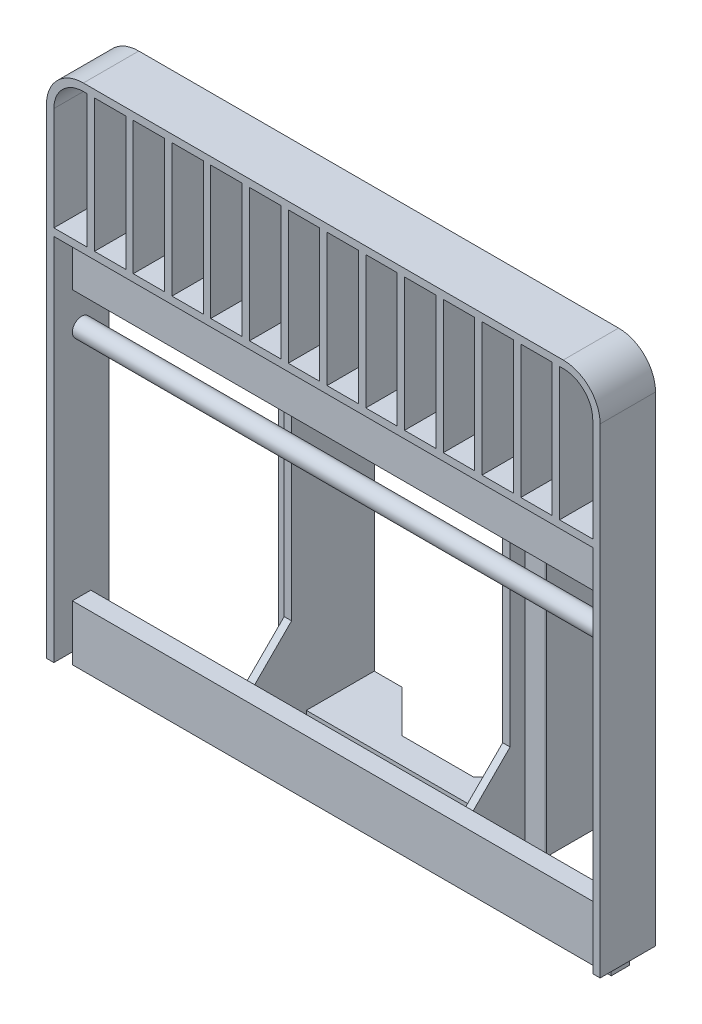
ISO-10303-21;
HEADER;
FILE_DESCRIPTION(('STEP AP214'),'2;1');
FILE_NAME('part.step','',(''),(''),'','','');
FILE_SCHEMA(('AUTOMOTIVE_DESIGN { 1 0 10303 214 1 1 1 1 }'));
ENDSEC;
DATA;
#1=APPLICATION_CONTEXT('core data for automotive mechanical design processes');
#2=APPLICATION_PROTOCOL_DEFINITION('international standard','automotive_design',2000,#1);
#3=PRODUCT_CONTEXT('',#1,'mechanical');
#4=PRODUCT('Part','Part','',(#3));
#5=PRODUCT_RELATED_PRODUCT_CATEGORY('part','',(#4));
#6=PRODUCT_DEFINITION_FORMATION('','',#4);
#7=PRODUCT_DEFINITION_CONTEXT('part definition',#1,'design');
#8=PRODUCT_DEFINITION('design','',#6,#7);
#9=PRODUCT_DEFINITION_SHAPE('','',#8);
#10=(LENGTH_UNIT() NAMED_UNIT(*) SI_UNIT(.MILLI.,.METRE.));
#11=(NAMED_UNIT(*) PLANE_ANGLE_UNIT() SI_UNIT($,.RADIAN.));
#12=(NAMED_UNIT(*) SI_UNIT($,.STERADIAN.) SOLID_ANGLE_UNIT());
#13=UNCERTAINTY_MEASURE_WITH_UNIT(LENGTH_MEASURE(1.E-05),#10,'distance_accuracy_value','');
#14=(GEOMETRIC_REPRESENTATION_CONTEXT(3) GLOBAL_UNCERTAINTY_ASSIGNED_CONTEXT((#13)) GLOBAL_UNIT_ASSIGNED_CONTEXT((#10,
#11,#12)) REPRESENTATION_CONTEXT('',''));
#15=CARTESIAN_POINT('',(0.,0.,0.));
#16=DIRECTION('',(0.,0.,1.));
#17=DIRECTION('',(1.,0.,0.));
#18=AXIS2_PLACEMENT_3D('',#15,#16,#17);
#19=CARTESIAN_POINT('',(1036.,-30.,50.0000000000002));
#20=DIRECTION('',(1.,0.,0.));
#21=DIRECTION('',(0.,0.,-1.));
#22=AXIS2_PLACEMENT_3D('',#19,#20,#21);
#23=PLANE('',#22);
#24=DIRECTION('',(0.,-1.,0.));
#25=VECTOR('',#24,1.);
#26=CARTESIAN_POINT('',(1036.,-10.,-89.9999999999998));
#27=LINE('',#26,#25);
#28=CARTESIAN_POINT('',(1036.,-10.,-89.9999999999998));
#29=VERTEX_POINT('',#28);
#30=CARTESIAN_POINT('',(1036.,-30.,-89.9999999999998));
#31=VERTEX_POINT('',#30);
#32=EDGE_CURVE('E376',#29,#31,#27,.T.);
#33=ORIENTED_EDGE('',*,*,#32,.T.);
#34=DIRECTION('',(0.,0.,-1.));
#35=VECTOR('',#34,1.);
#36=CARTESIAN_POINT('',(1036.,-30.,50.0000000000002));
#37=LINE('',#36,#35);
#38=CARTESIAN_POINT('',(1036.,-30.,50.0000000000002));
#39=VERTEX_POINT('',#38);
#40=EDGE_CURVE('E507',#39,#31,#37,.T.);
#41=ORIENTED_EDGE('',*,*,#40,.F.);
#42=DIRECTION('',(0.,1.,0.));
#43=VECTOR('',#42,1.);
#44=CARTESIAN_POINT('',(1036.,-30.,50.0000000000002));
#45=LINE('',#44,#43);
#46=CARTESIAN_POINT('',(1036.,120.,50.0000000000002));
#47=VERTEX_POINT('',#46);
#48=EDGE_CURVE('E542',#39,#47,#45,.T.);
#49=ORIENTED_EDGE('',*,*,#48,.T.);
#50=DIRECTION('',(0.,0.707106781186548,-0.707106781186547));
#51=VECTOR('',#50,1.);
#52=CARTESIAN_POINT('',(1036.,45.,125.));
#53=LINE('',#52,#51);
#54=CARTESIAN_POINT('',(1036.,220.,-49.9999999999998));
#55=VERTEX_POINT('',#54);
#56=EDGE_CURVE('E489',#47,#55,#53,.T.);
#57=ORIENTED_EDGE('',*,*,#56,.T.);
#58=DIRECTION('',(0.,1.,0.));
#59=VECTOR('',#58,1.);
#60=CARTESIAN_POINT('',(1036.,-30.,-49.9999999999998));
#61=LINE('',#60,#59);
#62=CARTESIAN_POINT('',(1036.,750.,-49.9999999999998));
#63=VERTEX_POINT('',#62);
#64=EDGE_CURVE('E497',#55,#63,#61,.T.);
#65=ORIENTED_EDGE('',*,*,#64,.T.);
#66=DIRECTION('',(0.,0.707106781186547,0.707106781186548));
#67=VECTOR('',#66,1.);
#68=CARTESIAN_POINT('',(1036.,410.,-390.));
#69=LINE('',#68,#67);
#70=CARTESIAN_POINT('',(1036.,850.,50.0000000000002));
#71=VERTEX_POINT('',#70);
#72=EDGE_CURVE('E500',#63,#71,#69,.T.);
#73=ORIENTED_EDGE('',*,*,#72,.T.);
#74=CARTESIAN_POINT('',(1036.,1000.,50.0000000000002));
#75=VERTEX_POINT('',#74);
#76=EDGE_CURVE('E546',#71,#75,#45,.T.);
#77=ORIENTED_EDGE('',*,*,#76,.T.);
#78=DIRECTION('',(0.,0.,-1.));
#79=VECTOR('',#78,1.);
#80=CARTESIAN_POINT('',(1036.,1000.,50.0000000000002));
#81=LINE('',#80,#79);
#82=CARTESIAN_POINT('',(1036.,1000.,-89.9999999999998));
#83=VERTEX_POINT('',#82);
#84=EDGE_CURVE('E449',#75,#83,#81,.T.);
#85=ORIENTED_EDGE('',*,*,#84,.T.);
#86=DIRECTION('',(0.,1.,0.));
#87=VECTOR('',#86,1.);
#88=CARTESIAN_POINT('',(1036.,980.,-89.9999999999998));
#89=LINE('',#88,#87);
#90=CARTESIAN_POINT('',(1036.,980.,-89.9999999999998));
#91=VERTEX_POINT('',#90);
#92=EDGE_CURVE('E455',#91,#83,#89,.T.);
#93=ORIENTED_EDGE('',*,*,#92,.F.);
#94=DIRECTION('',(0.,0.,-1.));
#95=VECTOR('',#94,1.);
#96=CARTESIAN_POINT('',(1036.,980.,-274.));
#97=LINE('',#96,#95);
#98=CARTESIAN_POINT('',(1036.,980.,-274.));
#99=VERTEX_POINT('',#98);
#100=EDGE_CURVE('E438',#91,#99,#97,.T.);
#101=ORIENTED_EDGE('',*,*,#100,.T.);
#102=DIRECTION('',(0.,1.,0.));
#103=VECTOR('',#102,1.);
#104=CARTESIAN_POINT('',(1036.,-30.,-274.));
#105=LINE('',#104,#103);
#106=CARTESIAN_POINT('',(1036.,-10.,-274.));
#107=VERTEX_POINT('',#106);
#108=EDGE_CURVE('E100',#107,#99,#105,.T.);
#109=ORIENTED_EDGE('',*,*,#108,.F.);
#110=DIRECTION('',(0.,0.,-1.));
#111=VECTOR('',#110,1.);
#112=CARTESIAN_POINT('',(1036.,-10.,-274.));
#113=LINE('',#112,#111);
#114=EDGE_CURVE('E365',#29,#107,#113,.T.);
#115=ORIENTED_EDGE('',*,*,#114,.F.);
#116=EDGE_LOOP('',(#33,#41,#49,#57,#65,#73,#77,#85,#93,#101,#109,#115));
#117=FACE_BOUND('',#116,.T.);
#118=ADVANCED_FACE('F96',(#117),#23,.F.);
#119=CARTESIAN_POINT('',(464.,-30.,50.0000000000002));
#120=DIRECTION('',(-1.,0.,0.));
#121=DIRECTION('',(0.,0.,-1.));
#122=AXIS2_PLACEMENT_3D('',#119,#120,#121);
#123=PLANE('',#122);
#124=DIRECTION('',(0.,-1.,0.));
#125=VECTOR('',#124,1.);
#126=CARTESIAN_POINT('',(464.,-10.,-89.9999999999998));
#127=LINE('',#126,#125);
#128=CARTESIAN_POINT('',(464.,-10.,-89.9999999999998));
#129=VERTEX_POINT('',#128);
#130=CARTESIAN_POINT('',(464.,-30.,-89.9999999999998));
#131=VERTEX_POINT('',#130);
#132=EDGE_CURVE('E114',#129,#131,#127,.T.);
#133=ORIENTED_EDGE('',*,*,#132,.F.);
#134=DIRECTION('',(0.,0.,1.));
#135=VECTOR('',#134,1.);
#136=CARTESIAN_POINT('',(464.,-10.,-274.));
#137=LINE('',#136,#135);
#138=CARTESIAN_POINT('',(464.,-10.,-274.));
#139=VERTEX_POINT('',#138);
#140=EDGE_CURVE('E119',#139,#129,#137,.T.);
#141=ORIENTED_EDGE('',*,*,#140,.F.);
#142=DIRECTION('',(0.,1.,0.));
#143=VECTOR('',#142,1.);
#144=CARTESIAN_POINT('',(464.,-30.,-274.));
#145=LINE('',#144,#143);
#146=CARTESIAN_POINT('',(464.,980.,-274.));
#147=VERTEX_POINT('',#146);
#148=EDGE_CURVE('E355',#139,#147,#145,.T.);
#149=ORIENTED_EDGE('',*,*,#148,.T.);
#150=DIRECTION('',(0.,0.,1.));
#151=VECTOR('',#150,1.);
#152=CARTESIAN_POINT('',(464.,980.,-274.));
#153=LINE('',#152,#151);
#154=CARTESIAN_POINT('',(464.,980.,-89.9999999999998));
#155=VERTEX_POINT('',#154);
#156=EDGE_CURVE('E439',#147,#155,#153,.T.);
#157=ORIENTED_EDGE('',*,*,#156,.T.);
#158=DIRECTION('',(0.,1.,0.));
#159=VECTOR('',#158,1.);
#160=CARTESIAN_POINT('',(464.,980.,-89.9999999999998));
#161=LINE('',#160,#159);
#162=CARTESIAN_POINT('',(464.,1000.,-89.9999999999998));
#163=VERTEX_POINT('',#162);
#164=EDGE_CURVE('E458',#155,#163,#161,.T.);
#165=ORIENTED_EDGE('',*,*,#164,.T.);
#166=DIRECTION('',(0.,0.,-1.));
#167=VECTOR('',#166,1.);
#168=CARTESIAN_POINT('',(464.,1000.,50.0000000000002));
#169=LINE('',#168,#167);
#170=CARTESIAN_POINT('',(464.,1000.,50.0000000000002));
#171=VERTEX_POINT('',#170);
#172=EDGE_CURVE('E424',#171,#163,#169,.T.);
#173=ORIENTED_EDGE('',*,*,#172,.F.);
#174=DIRECTION('',(0.,1.,0.));
#175=VECTOR('',#174,1.);
#176=CARTESIAN_POINT('',(464.,-30.,50.0000000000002));
#177=LINE('',#176,#175);
#178=CARTESIAN_POINT('',(464.,850.,50.0000000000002));
#179=VERTEX_POINT('',#178);
#180=EDGE_CURVE('E655',#179,#171,#177,.T.);
#181=ORIENTED_EDGE('',*,*,#180,.F.);
#182=DIRECTION('',(0.,-0.707106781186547,-0.707106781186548));
#183=VECTOR('',#182,1.);
#184=CARTESIAN_POINT('',(464.,410.,-390.));
#185=LINE('',#184,#183);
#186=CARTESIAN_POINT('',(464.,750.,-49.9999999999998));
#187=VERTEX_POINT('',#186);
#188=EDGE_CURVE('E402',#179,#187,#185,.T.);
#189=ORIENTED_EDGE('',*,*,#188,.T.);
#190=DIRECTION('',(0.,-1.,0.));
#191=VECTOR('',#190,1.);
#192=CARTESIAN_POINT('',(464.,-30.,-49.9999999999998));
#193=LINE('',#192,#191);
#194=CARTESIAN_POINT('',(464.,220.,-49.9999999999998));
#195=VERTEX_POINT('',#194);
#196=EDGE_CURVE('E399',#187,#195,#193,.T.);
#197=ORIENTED_EDGE('',*,*,#196,.T.);
#198=DIRECTION('',(0.,-0.707106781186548,0.707106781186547));
#199=VECTOR('',#198,1.);
#200=CARTESIAN_POINT('',(464.,45.,125.));
#201=LINE('',#200,#199);
#202=CARTESIAN_POINT('',(464.,120.,50.0000000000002));
#203=VERTEX_POINT('',#202);
#204=EDGE_CURVE('E389',#195,#203,#201,.T.);
#205=ORIENTED_EDGE('',*,*,#204,.T.);
#206=CARTESIAN_POINT('',(464.,-30.,50.0000000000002));
#207=VERTEX_POINT('',#206);
#208=EDGE_CURVE('E652',#207,#203,#177,.T.);
#209=ORIENTED_EDGE('',*,*,#208,.F.);
#210=DIRECTION('',(0.,0.,-1.));
#211=VECTOR('',#210,1.);
#212=CARTESIAN_POINT('',(464.,-30.,50.0000000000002));
#213=LINE('',#212,#211);
#214=EDGE_CURVE('E409',#207,#131,#213,.T.);
#215=ORIENTED_EDGE('',*,*,#214,.T.);
#216=EDGE_LOOP('',(#133,#141,#149,#157,#165,#173,#181,#189,#197,#205,#209,#215));
#217=FACE_BOUND('',#216,.T.);
#218=ADVANCED_FACE('F670',(#217),#123,.F.);
#219=CARTESIAN_POINT('',(1056.,-30.,50.0000000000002));
#220=DIRECTION('',(0.,0.,-1.));
#221=DIRECTION('',(-1.,0.,0.));
#222=AXIS2_PLACEMENT_3D('',#219,#220,#221);
#223=PLANE('',#222);
#224=ORIENTED_EDGE('',*,*,#76,.F.);
#225=DIRECTION('',(1.,0.,0.));
#226=VECTOR('',#225,1.);
#227=CARTESIAN_POINT('',(280.,850.,50.0000000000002));
#228=LINE('',#227,#226);
#229=CARTESIAN_POINT('',(1056.,850.,50.0000000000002));
#230=VERTEX_POINT('',#229);
#231=EDGE_CURVE('E486',#71,#230,#228,.T.);
#232=ORIENTED_EDGE('',*,*,#231,.T.);
#233=DIRECTION('',(0.,1.,0.));
#234=VECTOR('',#233,1.);
#235=CARTESIAN_POINT('',(1056.,-30.,50.0000000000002));
#236=LINE('',#235,#234);
#237=CARTESIAN_POINT('',(1056.,1000.,50.0000000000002));
#238=VERTEX_POINT('',#237);
#239=EDGE_CURVE('E521',#230,#238,#236,.T.);
#240=ORIENTED_EDGE('',*,*,#239,.T.);
#241=DIRECTION('',(-1.,0.,0.));
#242=VECTOR('',#241,1.);
#243=CARTESIAN_POINT('',(1056.,1000.,50.0000000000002));
#244=LINE('',#243,#242);
#245=EDGE_CURVE('E503',#238,#75,#244,.T.);
#246=ORIENTED_EDGE('',*,*,#245,.T.);
#247=EDGE_LOOP('',(#224,#232,#240,#246));
#248=FACE_BOUND('',#247,.T.);
#249=ADVANCED_FACE('F714',(#248),#223,.F.);
#250=CARTESIAN_POINT('',(1056.,-30.,50.0000000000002));
#251=VERTEX_POINT('',#250);
#252=CARTESIAN_POINT('',(1056.,120.,50.0000000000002));
#253=VERTEX_POINT('',#252);
#254=EDGE_CURVE('E535',#251,#253,#236,.T.);
#255=ORIENTED_EDGE('',*,*,#254,.T.);
#256=DIRECTION('',(1.,0.,0.));
#257=VECTOR('',#256,1.);
#258=CARTESIAN_POINT('',(280.,120.,50.0000000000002));
#259=LINE('',#258,#257);
#260=EDGE_CURVE('E485',#47,#253,#259,.T.);
#261=ORIENTED_EDGE('',*,*,#260,.F.);
#262=ORIENTED_EDGE('',*,*,#48,.F.);
#263=DIRECTION('',(-1.,0.,0.));
#264=VECTOR('',#263,1.);
#265=CARTESIAN_POINT('',(1056.,-30.,50.0000000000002));
#266=LINE('',#265,#264);
#267=EDGE_CURVE('E504',#251,#39,#266,.T.);
#268=ORIENTED_EDGE('',*,*,#267,.F.);
#269=EDGE_LOOP('',(#255,#261,#262,#268));
#270=FACE_BOUND('',#269,.T.);
#271=ADVANCED_FACE('F725',(#270),#223,.F.);
#272=CARTESIAN_POINT('',(1036.,-30.,-274.));
#273=DIRECTION('',(0.,0.,1.));
#274=DIRECTION('',(1.,0.,0.));
#275=AXIS2_PLACEMENT_3D('',#272,#273,#274);
#276=PLANE('',#275);
#277=DIRECTION('',(1.,0.,0.));
#278=VECTOR('',#277,1.);
#279=CARTESIAN_POINT('',(1036.,1000.,-274.));
#280=LINE('',#279,#278);
#281=CARTESIAN_POINT('',(961.,1000.,-274.));
#282=VERTEX_POINT('',#281);
#283=CARTESIAN_POINT('',(1111.,1000.,-274.));
#284=VERTEX_POINT('',#283);
#285=EDGE_CURVE('E525',#282,#284,#280,.T.);
#286=ORIENTED_EDGE('',*,*,#285,.T.);
#287=DIRECTION('',(0.,1.,0.));
#288=VECTOR('',#287,1.);
#289=CARTESIAN_POINT('',(1111.,-30.,-274.));
#290=LINE('',#289,#288);
#291=CARTESIAN_POINT('',(1111.,-30.,-274.));
#292=VERTEX_POINT('',#291);
#293=EDGE_CURVE('E13',#284,#292,#290,.F.);
#294=ORIENTED_EDGE('',*,*,#293,.T.);
#295=DIRECTION('',(1.,0.,0.));
#296=VECTOR('',#295,1.);
#297=CARTESIAN_POINT('',(1036.,-30.,-274.));
#298=LINE('',#297,#296);
#299=CARTESIAN_POINT('',(961.,-30.,-274.));
#300=VERTEX_POINT('',#299);
#301=EDGE_CURVE('E511',#300,#292,#298,.T.);
#302=ORIENTED_EDGE('',*,*,#301,.F.);
#303=DIRECTION('',(0.,-1.,0.));
#304=VECTOR('',#303,1.);
#305=CARTESIAN_POINT('',(961.,-10.,-274.));
#306=LINE('',#305,#304);
#307=CARTESIAN_POINT('',(961.,-10.,-274.));
#308=VERTEX_POINT('',#307);
#309=EDGE_CURVE('E379',#308,#300,#306,.T.);
#310=ORIENTED_EDGE('',*,*,#309,.F.);
#311=DIRECTION('',(-1.,0.,0.));
#312=VECTOR('',#311,1.);
#313=CARTESIAN_POINT('',(961.,-10.,-274.));
#314=LINE('',#313,#312);
#315=EDGE_CURVE('E363',#107,#308,#314,.T.);
#316=ORIENTED_EDGE('',*,*,#315,.F.);
#317=ORIENTED_EDGE('',*,*,#108,.T.);
#318=DIRECTION('',(-1.,0.,0.));
#319=VECTOR('',#318,1.);
#320=CARTESIAN_POINT('',(961.,980.,-274.));
#321=LINE('',#320,#319);
#322=CARTESIAN_POINT('',(961.,980.,-274.));
#323=VERTEX_POINT('',#322);
#324=EDGE_CURVE('E448',#99,#323,#321,.T.);
#325=ORIENTED_EDGE('',*,*,#324,.T.);
#326=DIRECTION('',(0.,1.,0.));
#327=VECTOR('',#326,1.);
#328=CARTESIAN_POINT('',(961.,980.,-274.));
#329=LINE('',#328,#327);
#330=EDGE_CURVE('E457',#323,#282,#329,.T.);
#331=ORIENTED_EDGE('',*,*,#330,.T.);
#332=EDGE_LOOP('',(#286,#294,#302,#310,#316,#317,#325,#331));
#333=FACE_BOUND('',#332,.T.);
#334=ADVANCED_FACE('F587',(#333),#276,.F.);
#335=CARTESIAN_POINT('',(1113.,-30.,-274.));
#336=DIRECTION('',(-1.,0.,0.));
#337=DIRECTION('',(0.,0.,1.));
#338=AXIS2_PLACEMENT_3D('',#335,#336,#337);
#339=PLANE('',#338);
#340=DIRECTION('',(0.,0.,1.));
#341=VECTOR('',#340,1.);
#342=CARTESIAN_POINT('',(1113.,1000.,-274.));
#343=LINE('',#342,#341);
#344=CARTESIAN_POINT('',(1113.,1000.,-272.));
#345=VERTEX_POINT('',#344);
#346=CARTESIAN_POINT('',(1113.,1000.,-91.9999999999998));
#347=VERTEX_POINT('',#346);
#348=EDGE_CURVE('E528',#345,#347,#343,.T.);
#349=ORIENTED_EDGE('',*,*,#348,.T.);
#350=DIRECTION('',(0.,1.,0.));
#351=VECTOR('',#350,1.);
#352=CARTESIAN_POINT('',(1113.,-30.,-91.9999999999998));
#353=LINE('',#352,#351);
#354=CARTESIAN_POINT('',(1113.,-30.,-91.9999999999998));
#355=VERTEX_POINT('',#354);
#356=EDGE_CURVE('E556',#347,#355,#353,.F.);
#357=ORIENTED_EDGE('',*,*,#356,.T.);
#358=DIRECTION('',(0.,0.,1.));
#359=VECTOR('',#358,1.);
#360=CARTESIAN_POINT('',(1113.,-30.,-274.));
#361=LINE('',#360,#359);
#362=CARTESIAN_POINT('',(1113.,-30.,-272.));
#363=VERTEX_POINT('',#362);
#364=EDGE_CURVE('E514',#363,#355,#361,.T.);
#365=ORIENTED_EDGE('',*,*,#364,.F.);
#366=DIRECTION('',(0.,1.,0.));
#367=VECTOR('',#366,1.);
#368=CARTESIAN_POINT('',(1113.,-30.,-272.));
#369=LINE('',#368,#367);
#370=EDGE_CURVE('E553',#363,#345,#369,.T.);
#371=ORIENTED_EDGE('',*,*,#370,.T.);
#372=EDGE_LOOP('',(#349,#357,#365,#371));
#373=FACE_BOUND('',#372,.T.);
#374=ADVANCED_FACE('F579',(#373),#339,.F.);
#375=CARTESIAN_POINT('',(1113.,-30.,-89.9999999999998));
#376=DIRECTION('',(0.,0.,-1.));
#377=DIRECTION('',(-1.,0.,0.));
#378=AXIS2_PLACEMENT_3D('',#375,#376,#377);
#379=PLANE('',#378);
#380=DIRECTION('',(-1.,0.,0.));
#381=VECTOR('',#380,1.);
#382=CARTESIAN_POINT('',(1113.,-30.,-89.9999999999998));
#383=LINE('',#382,#381);
#384=CARTESIAN_POINT('',(1111.,-30.,-89.9999999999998));
#385=VERTEX_POINT('',#384);
#386=CARTESIAN_POINT('',(1056.,-30.,-89.9999999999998));
#387=VERTEX_POINT('',#386);
#388=EDGE_CURVE('E517',#385,#387,#383,.T.);
#389=ORIENTED_EDGE('',*,*,#388,.F.);
#390=DIRECTION('',(0.,1.,0.));
#391=VECTOR('',#390,1.);
#392=CARTESIAN_POINT('',(1111.,-30.,-89.9999999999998));
#393=LINE('',#392,#391);
#394=CARTESIAN_POINT('',(1111.,1000.,-89.9999999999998));
#395=VERTEX_POINT('',#394);
#396=EDGE_CURVE('E545',#385,#395,#393,.T.);
#397=ORIENTED_EDGE('',*,*,#396,.T.);
#398=DIRECTION('',(-1.,0.,0.));
#399=VECTOR('',#398,1.);
#400=CARTESIAN_POINT('',(1113.,1000.,-89.9999999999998));
#401=LINE('',#400,#399);
#402=CARTESIAN_POINT('',(1056.,1000.,-89.9999999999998));
#403=VERTEX_POINT('',#402);
#404=EDGE_CURVE('E531',#395,#403,#401,.T.);
#405=ORIENTED_EDGE('',*,*,#404,.T.);
#406=DIRECTION('',(0.,1.,0.));
#407=VECTOR('',#406,1.);
#408=CARTESIAN_POINT('',(1056.,-30.,-89.9999999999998));
#409=LINE('',#408,#407);
#410=EDGE_CURVE('E538',#387,#403,#409,.T.);
#411=ORIENTED_EDGE('',*,*,#410,.F.);
#412=EDGE_LOOP('',(#389,#397,#405,#411));
#413=FACE_BOUND('',#412,.T.);
#414=ADVANCED_FACE('F570',(#413),#379,.F.);
#415=CARTESIAN_POINT('',(1056.,-30.,-89.9999999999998));
#416=DIRECTION('',(-1.,0.,0.));
#417=DIRECTION('',(0.,0.,1.));
#418=AXIS2_PLACEMENT_3D('',#415,#416,#417);
#419=PLANE('',#418);
#420=ORIENTED_EDGE('',*,*,#239,.F.);
#421=DIRECTION('',(0.,0.707106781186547,0.707106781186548));
#422=VECTOR('',#421,1.);
#423=CARTESIAN_POINT('',(1056.,850.,50.0000000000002));
#424=LINE('',#423,#422);
#425=CARTESIAN_POINT('',(1056.,750.,-49.9999999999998));
#426=VERTEX_POINT('',#425);
#427=EDGE_CURVE('E483',#426,#230,#424,.T.);
#428=ORIENTED_EDGE('',*,*,#427,.F.);
#429=DIRECTION('',(0.,1.,0.));
#430=VECTOR('',#429,1.);
#431=CARTESIAN_POINT('',(1056.,750.,-49.9999999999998));
#432=LINE('',#431,#430);
#433=CARTESIAN_POINT('',(1056.,220.,-49.9999999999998));
#434=VERTEX_POINT('',#433);
#435=EDGE_CURVE('E479',#434,#426,#432,.T.);
#436=ORIENTED_EDGE('',*,*,#435,.F.);
#437=DIRECTION('',(0.,0.707106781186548,-0.707106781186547));
#438=VECTOR('',#437,1.);
#439=CARTESIAN_POINT('',(1056.,220.,-49.9999999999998));
#440=LINE('',#439,#438);
#441=EDGE_CURVE('E476',#253,#434,#440,.T.);
#442=ORIENTED_EDGE('',*,*,#441,.F.);
#443=ORIENTED_EDGE('',*,*,#254,.F.);
#444=DIRECTION('',(0.,0.,1.));
#445=VECTOR('',#444,1.);
#446=CARTESIAN_POINT('',(1056.,-30.,-89.9999999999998));
#447=LINE('',#446,#445);
#448=EDGE_CURVE('E519',#387,#251,#447,.T.);
#449=ORIENTED_EDGE('',*,*,#448,.F.);
#450=ORIENTED_EDGE('',*,*,#410,.T.);
#451=DIRECTION('',(0.,0.,1.));
#452=VECTOR('',#451,1.);
#453=CARTESIAN_POINT('',(1056.,1000.,-89.9999999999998));
#454=LINE('',#453,#452);
#455=EDGE_CURVE('E508',#403,#238,#454,.T.);
#456=ORIENTED_EDGE('',*,*,#455,.T.);
#457=EDGE_LOOP('',(#420,#428,#436,#442,#443,#449,#450,#456));
#458=FACE_BOUND('',#457,.T.);
#459=ADVANCED_FACE('F718',(#458),#419,.F.);
#460=CARTESIAN_POINT('',(0.,-30.,0.));
#461=DIRECTION('',(0.,-1.,0.));
#462=DIRECTION('',(0.,0.,-1.));
#463=AXIS2_PLACEMENT_3D('',#460,#461,#462);
#464=PLANE('',#463);
#465=ORIENTED_EDGE('',*,*,#364,.T.);
#466=CARTESIAN_POINT('',(1111.,-30.,-91.9999999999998));
#467=DIRECTION('',(0.,-1.,0.));
#468=DIRECTION('',(0.,0.,-1.));
#469=AXIS2_PLACEMENT_3D('',#466,#467,#468);
#470=CIRCLE('',#469,2.);
#471=EDGE_CURVE('E106',#355,#385,#470,.T.);
#472=ORIENTED_EDGE('',*,*,#471,.T.);
#473=ORIENTED_EDGE('',*,*,#388,.T.);
#474=ORIENTED_EDGE('',*,*,#448,.T.);
#475=ORIENTED_EDGE('',*,*,#267,.T.);
#476=ORIENTED_EDGE('',*,*,#40,.T.);
#477=DIRECTION('',(1.,0.,0.));
#478=VECTOR('',#477,1.);
#479=CARTESIAN_POINT('',(464.,-30.,-89.9999999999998));
#480=LINE('',#479,#478);
#481=EDGE_CURVE('E357',#131,#31,#480,.T.);
#482=ORIENTED_EDGE('',*,*,#481,.F.);
#483=ORIENTED_EDGE('',*,*,#214,.F.);
#484=DIRECTION('',(1.,0.,0.));
#485=VECTOR('',#484,1.);
#486=CARTESIAN_POINT('',(444.,-30.,50.0000000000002));
#487=LINE('',#486,#485);
#488=CARTESIAN_POINT('',(444.,-30.,50.0000000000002));
#489=VERTEX_POINT('',#488);
#490=EDGE_CURVE('E406',#489,#207,#487,.T.);
#491=ORIENTED_EDGE('',*,*,#490,.F.);
#492=DIRECTION('',(0.,0.,1.));
#493=VECTOR('',#492,1.);
#494=CARTESIAN_POINT('',(444.,-30.,-89.9999999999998));
#495=LINE('',#494,#493);
#496=CARTESIAN_POINT('',(444.,-30.,-89.9999999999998));
#497=VERTEX_POINT('',#496);
#498=EDGE_CURVE('E419',#497,#489,#495,.T.);
#499=ORIENTED_EDGE('',*,*,#498,.F.);
#500=DIRECTION('',(1.,0.,0.));
#501=VECTOR('',#500,1.);
#502=CARTESIAN_POINT('',(387.,-30.,-89.9999999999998));
#503=LINE('',#502,#501);
#504=CARTESIAN_POINT('',(389.,-30.,-89.9999999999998));
#505=VERTEX_POINT('',#504);
#506=EDGE_CURVE('E417',#505,#497,#503,.T.);
#507=ORIENTED_EDGE('',*,*,#506,.F.);
#508=CARTESIAN_POINT('',(389.,-30.,-91.9999999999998));
#509=DIRECTION('',(0.,-1.,0.));
#510=DIRECTION('',(0.,0.,-1.));
#511=AXIS2_PLACEMENT_3D('',#508,#509,#510);
#512=CIRCLE('',#511,2.);
#513=CARTESIAN_POINT('',(387.,-30.,-91.9999999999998));
#514=VERTEX_POINT('',#513);
#515=EDGE_CURVE('E625',#505,#514,#512,.T.);
#516=ORIENTED_EDGE('',*,*,#515,.T.);
#517=DIRECTION('',(0.,0.,1.));
#518=VECTOR('',#517,1.);
#519=CARTESIAN_POINT('',(387.,-30.,-274.));
#520=LINE('',#519,#518);
#521=CARTESIAN_POINT('',(387.,-30.,-272.));
#522=VERTEX_POINT('',#521);
#523=EDGE_CURVE('E414',#522,#514,#520,.T.);
#524=ORIENTED_EDGE('',*,*,#523,.F.);
#525=CARTESIAN_POINT('',(389.,-30.,-272.));
#526=DIRECTION('',(0.,-1.,0.));
#527=DIRECTION('',(0.,0.,-1.));
#528=AXIS2_PLACEMENT_3D('',#525,#526,#527);
#529=CIRCLE('',#528,2.);
#530=CARTESIAN_POINT('',(389.,-30.,-274.));
#531=VERTEX_POINT('',#530);
#532=EDGE_CURVE('E626',#522,#531,#529,.T.);
#533=ORIENTED_EDGE('',*,*,#532,.T.);
#534=DIRECTION('',(-1.,0.,0.));
#535=VECTOR('',#534,1.);
#536=CARTESIAN_POINT('',(464.,-30.,-274.));
#537=LINE('',#536,#535);
#538=CARTESIAN_POINT('',(539.,-30.,-274.));
#539=VERTEX_POINT('',#538);
#540=EDGE_CURVE('E412',#539,#531,#537,.T.);
#541=ORIENTED_EDGE('',*,*,#540,.F.);
#542=DIRECTION('',(-0.707106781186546,0.,-0.707106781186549));
#543=VECTOR('',#542,1.);
#544=CARTESIAN_POINT('',(539.,-30.,-274.));
#545=LINE('',#544,#543);
#546=CARTESIAN_POINT('',(652.999999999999,-30.,-160.));
#547=VERTEX_POINT('',#546);
#548=EDGE_CURVE('E346',#547,#539,#545,.T.);
#549=ORIENTED_EDGE('',*,*,#548,.F.);
#550=DIRECTION('',(-1.,0.,0.));
#551=VECTOR('',#550,1.);
#552=CARTESIAN_POINT('',(652.999999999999,-30.,-160.));
#553=LINE('',#552,#551);
#554=CARTESIAN_POINT('',(847.000000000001,-30.,-160.));
#555=VERTEX_POINT('',#554);
#556=EDGE_CURVE('E369',#555,#547,#553,.T.);
#557=ORIENTED_EDGE('',*,*,#556,.F.);
#558=DIRECTION('',(-0.707106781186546,0.,0.707106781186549));
#559=VECTOR('',#558,1.);
#560=CARTESIAN_POINT('',(847.000000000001,-30.,-160.));
#561=LINE('',#560,#559);
#562=EDGE_CURVE('E371',#300,#555,#561,.T.);
#563=ORIENTED_EDGE('',*,*,#562,.F.);
#564=ORIENTED_EDGE('',*,*,#301,.T.);
#565=CARTESIAN_POINT('',(1111.,-30.,-272.));
#566=DIRECTION('',(0.,-1.,0.));
#567=DIRECTION('',(0.,0.,-1.));
#568=AXIS2_PLACEMENT_3D('',#565,#566,#567);
#569=CIRCLE('',#568,2.);
#570=EDGE_CURVE('E558',#292,#363,#569,.T.);
#571=ORIENTED_EDGE('',*,*,#570,.T.);
#572=EDGE_LOOP('',(#465,#472,#473,#474,#475,#476,#482,#483,#491,#499,#507,#516,#524,#533,#541,
#549,#557,#563,#564,#571));
#573=FACE_BOUND('',#572,.T.);
#574=ADVANCED_FACE('F563',(#573),#464,.T.);
#575=CARTESIAN_POINT('',(0.,1000.,0.));
#576=DIRECTION('',(0.,-1.,0.));
#577=DIRECTION('',(0.,0.,-1.));
#578=AXIS2_PLACEMENT_3D('',#575,#576,#577);
#579=PLANE('',#578);
#580=ORIENTED_EDGE('',*,*,#404,.F.);
#581=CARTESIAN_POINT('',(1111.,1000.,-91.9999999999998));
#582=DIRECTION('',(0.,-1.,0.));
#583=DIRECTION('',(0.,0.,-1.));
#584=AXIS2_PLACEMENT_3D('',#581,#582,#583);
#585=CIRCLE('',#584,2.);
#586=EDGE_CURVE('E551',#395,#347,#585,.F.);
#587=ORIENTED_EDGE('',*,*,#586,.T.);
#588=ORIENTED_EDGE('',*,*,#348,.F.);
#589=CARTESIAN_POINT('',(1111.,1000.,-272.));
#590=DIRECTION('',(0.,-1.,0.));
#591=DIRECTION('',(0.,0.,-1.));
#592=AXIS2_PLACEMENT_3D('',#589,#590,#591);
#593=CIRCLE('',#592,2.);
#594=EDGE_CURVE('E549',#345,#284,#593,.F.);
#595=ORIENTED_EDGE('',*,*,#594,.T.);
#596=ORIENTED_EDGE('',*,*,#285,.F.);
#597=DIRECTION('',(-0.707106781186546,0.,0.707106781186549));
#598=VECTOR('',#597,1.);
#599=CARTESIAN_POINT('',(847.000000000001,1000.,-160.));
#600=LINE('',#599,#598);
#601=CARTESIAN_POINT('',(847.000000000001,1000.,-160.));
#602=VERTEX_POINT('',#601);
#603=EDGE_CURVE('E464',#282,#602,#600,.T.);
#604=ORIENTED_EDGE('',*,*,#603,.T.);
#605=DIRECTION('',(-1.,0.,0.));
#606=VECTOR('',#605,1.);
#607=CARTESIAN_POINT('',(652.999999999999,1000.,-160.));
#608=LINE('',#607,#606);
#609=CARTESIAN_POINT('',(652.999999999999,1000.,-160.));
#610=VERTEX_POINT('',#609);
#611=EDGE_CURVE('E597',#602,#610,#608,.T.);
#612=ORIENTED_EDGE('',*,*,#611,.T.);
#613=DIRECTION('',(-0.707106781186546,0.,-0.707106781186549));
#614=VECTOR('',#613,1.);
#615=CARTESIAN_POINT('',(539.,1000.,-274.));
#616=LINE('',#615,#614);
#617=CARTESIAN_POINT('',(539.,1000.,-274.));
#618=VERTEX_POINT('',#617);
#619=EDGE_CURVE('E599',#610,#618,#616,.T.);
#620=ORIENTED_EDGE('',*,*,#619,.T.);
#621=DIRECTION('',(-1.,0.,0.));
#622=VECTOR('',#621,1.);
#623=CARTESIAN_POINT('',(464.,1000.,-274.));
#624=LINE('',#623,#622);
#625=CARTESIAN_POINT('',(389.,1000.,-274.));
#626=VERTEX_POINT('',#625);
#627=EDGE_CURVE('E606',#618,#626,#624,.T.);
#628=ORIENTED_EDGE('',*,*,#627,.T.);
#629=CARTESIAN_POINT('',(389.,1000.,-272.));
#630=DIRECTION('',(0.,-1.,0.));
#631=DIRECTION('',(0.,0.,-1.));
#632=AXIS2_PLACEMENT_3D('',#629,#630,#631);
#633=CIRCLE('',#632,2.);
#634=CARTESIAN_POINT('',(387.,1000.,-272.));
#635=VERTEX_POINT('',#634);
#636=EDGE_CURVE('E636',#626,#635,#633,.F.);
#637=ORIENTED_EDGE('',*,*,#636,.T.);
#638=DIRECTION('',(0.,0.,1.));
#639=VECTOR('',#638,1.);
#640=CARTESIAN_POINT('',(387.,1000.,-274.));
#641=LINE('',#640,#639);
#642=CARTESIAN_POINT('',(387.,1000.,-91.9999999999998));
#643=VERTEX_POINT('',#642);
#644=EDGE_CURVE('E427',#635,#643,#641,.T.);
#645=ORIENTED_EDGE('',*,*,#644,.T.);
#646=CARTESIAN_POINT('',(389.,1000.,-91.9999999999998));
#647=DIRECTION('',(0.,-1.,0.));
#648=DIRECTION('',(0.,0.,-1.));
#649=AXIS2_PLACEMENT_3D('',#646,#647,#648);
#650=CIRCLE('',#649,2.);
#651=CARTESIAN_POINT('',(389.,1000.,-89.9999999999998));
#652=VERTEX_POINT('',#651);
#653=EDGE_CURVE('E634',#643,#652,#650,.F.);
#654=ORIENTED_EDGE('',*,*,#653,.T.);
#655=DIRECTION('',(1.,0.,0.));
#656=VECTOR('',#655,1.);
#657=CARTESIAN_POINT('',(387.,1000.,-89.9999999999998));
#658=LINE('',#657,#656);
#659=CARTESIAN_POINT('',(444.,1000.,-89.9999999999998));
#660=VERTEX_POINT('',#659);
#661=EDGE_CURVE('E1039',#652,#660,#658,.T.);
#662=ORIENTED_EDGE('',*,*,#661,.T.);
#663=DIRECTION('',(0.,0.,1.));
#664=VECTOR('',#663,1.);
#665=CARTESIAN_POINT('',(444.,1000.,-89.9999999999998));
#666=LINE('',#665,#664);
#667=CARTESIAN_POINT('',(444.,1000.,50.0000000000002));
#668=VERTEX_POINT('',#667);
#669=EDGE_CURVE('E410',#660,#668,#666,.T.);
#670=ORIENTED_EDGE('',*,*,#669,.T.);
#671=DIRECTION('',(1.,0.,0.));
#672=VECTOR('',#671,1.);
#673=CARTESIAN_POINT('',(444.,1000.,50.0000000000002));
#674=LINE('',#673,#672);
#675=EDGE_CURVE('E405',#668,#171,#674,.T.);
#676=ORIENTED_EDGE('',*,*,#675,.T.);
#677=ORIENTED_EDGE('',*,*,#172,.T.);
#678=DIRECTION('',(1.,0.,0.));
#679=VECTOR('',#678,1.);
#680=CARTESIAN_POINT('',(464.,1000.,-89.9999999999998));
#681=LINE('',#680,#679);
#682=EDGE_CURVE('E461',#163,#83,#681,.T.);
#683=ORIENTED_EDGE('',*,*,#682,.T.);
#684=ORIENTED_EDGE('',*,*,#84,.F.);
#685=ORIENTED_EDGE('',*,*,#245,.F.);
#686=ORIENTED_EDGE('',*,*,#455,.F.);
#687=EDGE_LOOP('',(#580,#587,#588,#595,#596,#604,#612,#620,#628,#637,#645,#654,#662,#670,#676,
#677,#683,#684,#685,#686));
#688=FACE_BOUND('',#687,.T.);
#689=ADVANCED_FACE('F576',(#688),#579,.F.);
#690=CARTESIAN_POINT('',(280.,850.,50.0000000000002));
#691=DIRECTION('',(0.,0.707106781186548,-0.707106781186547));
#692=DIRECTION('',(0.,0.707106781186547,0.707106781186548));
#693=AXIS2_PLACEMENT_3D('',#690,#691,#692);
#694=PLANE('',#693);
#695=DIRECTION('',(1.,0.,0.));
#696=VECTOR('',#695,1.);
#697=CARTESIAN_POINT('',(280.,750.,-49.9999999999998));
#698=LINE('',#697,#696);
#699=EDGE_CURVE('E490',#63,#426,#698,.T.);
#700=ORIENTED_EDGE('',*,*,#699,.T.);
#701=ORIENTED_EDGE('',*,*,#427,.T.);
#702=ORIENTED_EDGE('',*,*,#231,.F.);
#703=ORIENTED_EDGE('',*,*,#72,.F.);
#704=EDGE_LOOP('',(#700,#701,#702,#703));
#705=FACE_BOUND('',#704,.T.);
#706=ADVANCED_FACE('F734',(#705),#694,.F.);
#707=CARTESIAN_POINT('',(280.,750.,-49.9999999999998));
#708=DIRECTION('',(0.,0.,-1.));
#709=DIRECTION('',(-1.,0.,0.));
#710=AXIS2_PLACEMENT_3D('',#707,#708,#709);
#711=PLANE('',#710);
#712=DIRECTION('',(1.,0.,0.));
#713=VECTOR('',#712,1.);
#714=CARTESIAN_POINT('',(280.,220.,-49.9999999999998));
#715=LINE('',#714,#713);
#716=EDGE_CURVE('E492',#55,#434,#715,.T.);
#717=ORIENTED_EDGE('',*,*,#716,.T.);
#718=ORIENTED_EDGE('',*,*,#435,.T.);
#719=ORIENTED_EDGE('',*,*,#699,.F.);
#720=ORIENTED_EDGE('',*,*,#64,.F.);
#721=EDGE_LOOP('',(#717,#718,#719,#720));
#722=FACE_BOUND('',#721,.T.);
#723=ADVANCED_FACE('F731',(#722),#711,.F.);
#724=CARTESIAN_POINT('',(280.,220.,-49.9999999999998));
#725=DIRECTION('',(0.,-0.707106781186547,-0.707106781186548));
#726=DIRECTION('',(0.,0.707106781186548,-0.707106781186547));
#727=AXIS2_PLACEMENT_3D('',#724,#725,#726);
#728=PLANE('',#727);
#729=ORIENTED_EDGE('',*,*,#260,.T.);
#730=ORIENTED_EDGE('',*,*,#441,.T.);
#731=ORIENTED_EDGE('',*,*,#716,.F.);
#732=ORIENTED_EDGE('',*,*,#56,.F.);
#733=EDGE_LOOP('',(#729,#730,#731,#732));
#734=FACE_BOUND('',#733,.T.);
#735=ADVANCED_FACE('F728',(#734),#728,.F.);
#736=CARTESIAN_POINT('',(1111.,-30.,-91.9999999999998));
#737=DIRECTION('',(0.,1.,0.));
#738=DIRECTION('',(0.,0.,1.));
#739=AXIS2_PLACEMENT_3D('',#736,#737,#738);
#740=CYLINDRICAL_SURFACE('',#739,2.);
#741=ORIENTED_EDGE('',*,*,#471,.F.);
#742=ORIENTED_EDGE('',*,*,#356,.F.);
#743=ORIENTED_EDGE('',*,*,#586,.F.);
#744=ORIENTED_EDGE('',*,*,#396,.F.);
#745=EDGE_LOOP('',(#741,#742,#743,#744));
#746=FACE_BOUND('',#745,.T.);
#747=ADVANCED_FACE('F573',(#746),#740,.T.);
#748=CARTESIAN_POINT('',(1111.,-30.,-272.));
#749=DIRECTION('',(0.,1.,0.));
#750=DIRECTION('',(0.,0.,1.));
#751=AXIS2_PLACEMENT_3D('',#748,#749,#750);
#752=CYLINDRICAL_SURFACE('',#751,2.);
#753=ORIENTED_EDGE('',*,*,#570,.F.);
#754=ORIENTED_EDGE('',*,*,#293,.F.);
#755=ORIENTED_EDGE('',*,*,#594,.F.);
#756=ORIENTED_EDGE('',*,*,#370,.F.);
#757=EDGE_LOOP('',(#753,#754,#755,#756));
#758=FACE_BOUND('',#757,.T.);
#759=ADVANCED_FACE('F98',(#758),#752,.T.);
#760=CARTESIAN_POINT('',(464.,980.,-274.));
#761=DIRECTION('',(0.,0.,-1.));
#762=DIRECTION('',(-1.,0.,0.));
#763=AXIS2_PLACEMENT_3D('',#760,#761,#762);
#764=PLANE('',#763);
#765=ORIENTED_EDGE('',*,*,#627,.F.);
#766=DIRECTION('',(0.,1.,0.));
#767=VECTOR('',#766,1.);
#768=CARTESIAN_POINT('',(539.,980.,-274.));
#769=LINE('',#768,#767);
#770=CARTESIAN_POINT('',(539.,980.,-274.));
#771=VERTEX_POINT('',#770);
#772=EDGE_CURVE('E480',#771,#618,#769,.T.);
#773=ORIENTED_EDGE('',*,*,#772,.F.);
#774=DIRECTION('',(-1.,0.,0.));
#775=VECTOR('',#774,1.);
#776=CARTESIAN_POINT('',(464.,980.,-274.));
#777=LINE('',#776,#775);
#778=EDGE_CURVE('E470',#771,#147,#777,.T.);
#779=ORIENTED_EDGE('',*,*,#778,.T.);
#780=ORIENTED_EDGE('',*,*,#148,.F.);
#781=DIRECTION('',(-1.,0.,0.));
#782=VECTOR('',#781,1.);
#783=CARTESIAN_POINT('',(464.,-10.,-274.));
#784=LINE('',#783,#782);
#785=CARTESIAN_POINT('',(539.,-10.,-274.));
#786=VERTEX_POINT('',#785);
#787=EDGE_CURVE('E334',#786,#139,#784,.T.);
#788=ORIENTED_EDGE('',*,*,#787,.F.);
#789=DIRECTION('',(0.,-1.,0.));
#790=VECTOR('',#789,1.);
#791=CARTESIAN_POINT('',(539.,-10.,-274.));
#792=LINE('',#791,#790);
#793=EDGE_CURVE('E343',#786,#539,#792,.T.);
#794=ORIENTED_EDGE('',*,*,#793,.T.);
#795=ORIENTED_EDGE('',*,*,#540,.T.);
#796=DIRECTION('',(0.,1.,0.));
#797=VECTOR('',#796,1.);
#798=CARTESIAN_POINT('',(389.,-30.,-274.));
#799=LINE('',#798,#797);
#800=EDGE_CURVE('E433',#531,#626,#799,.T.);
#801=ORIENTED_EDGE('',*,*,#800,.T.);
#802=EDGE_LOOP('',(#765,#773,#779,#780,#788,#794,#795,#801));
#803=FACE_BOUND('',#802,.T.);
#804=ADVANCED_FACE('F353',(#803),#764,.T.);
#805=CARTESIAN_POINT('',(539.,980.,-274.));
#806=DIRECTION('',(0.707106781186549,0.,-0.707106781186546));
#807=DIRECTION('',(-0.707106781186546,0.,-0.707106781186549));
#808=AXIS2_PLACEMENT_3D('',#805,#806,#807);
#809=PLANE('',#808);
#810=ORIENTED_EDGE('',*,*,#619,.F.);
#811=DIRECTION('',(0.,1.,0.));
#812=VECTOR('',#811,1.);
#813=CARTESIAN_POINT('',(652.999999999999,980.,-160.));
#814=LINE('',#813,#812);
#815=CARTESIAN_POINT('',(652.999999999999,980.,-160.));
#816=VERTEX_POINT('',#815);
#817=EDGE_CURVE('E609',#816,#610,#814,.T.);
#818=ORIENTED_EDGE('',*,*,#817,.F.);
#819=DIRECTION('',(-0.707106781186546,0.,-0.707106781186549));
#820=VECTOR('',#819,1.);
#821=CARTESIAN_POINT('',(539.,980.,-274.));
#822=LINE('',#821,#820);
#823=EDGE_CURVE('E602',#816,#771,#822,.T.);
#824=ORIENTED_EDGE('',*,*,#823,.T.);
#825=ORIENTED_EDGE('',*,*,#772,.T.);
#826=EDGE_LOOP('',(#810,#818,#824,#825));
#827=FACE_BOUND('',#826,.T.);
#828=ADVANCED_FACE('F619',(#827),#809,.T.);
#829=CARTESIAN_POINT('',(652.999999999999,980.,-160.));
#830=DIRECTION('',(0.,0.,-1.));
#831=DIRECTION('',(-1.,0.,0.));
#832=AXIS2_PLACEMENT_3D('',#829,#830,#831);
#833=PLANE('',#832);
#834=ORIENTED_EDGE('',*,*,#611,.F.);
#835=DIRECTION('',(0.,1.,0.));
#836=VECTOR('',#835,1.);
#837=CARTESIAN_POINT('',(847.000000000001,980.,-160.));
#838=LINE('',#837,#836);
#839=CARTESIAN_POINT('',(847.000000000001,980.,-160.));
#840=VERTEX_POINT('',#839);
#841=EDGE_CURVE('E593',#840,#602,#838,.T.);
#842=ORIENTED_EDGE('',*,*,#841,.F.);
#843=DIRECTION('',(-1.,0.,0.));
#844=VECTOR('',#843,1.);
#845=CARTESIAN_POINT('',(652.999999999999,980.,-160.));
#846=LINE('',#845,#844);
#847=EDGE_CURVE('E615',#840,#816,#846,.T.);
#848=ORIENTED_EDGE('',*,*,#847,.T.);
#849=ORIENTED_EDGE('',*,*,#817,.T.);
#850=EDGE_LOOP('',(#834,#842,#848,#849));
#851=FACE_BOUND('',#850,.T.);
#852=ADVANCED_FACE('F613',(#851),#833,.T.);
#853=CARTESIAN_POINT('',(847.000000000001,980.,-160.));
#854=DIRECTION('',(-0.707106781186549,0.,-0.707106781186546));
#855=DIRECTION('',(-0.707106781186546,0.,0.707106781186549));
#856=AXIS2_PLACEMENT_3D('',#853,#854,#855);
#857=PLANE('',#856);
#858=ORIENTED_EDGE('',*,*,#603,.F.);
#859=ORIENTED_EDGE('',*,*,#330,.F.);
#860=DIRECTION('',(-0.707106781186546,0.,0.707106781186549));
#861=VECTOR('',#860,1.);
#862=CARTESIAN_POINT('',(847.000000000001,980.,-160.));
#863=LINE('',#862,#861);
#864=EDGE_CURVE('E442',#323,#840,#863,.T.);
#865=ORIENTED_EDGE('',*,*,#864,.T.);
#866=ORIENTED_EDGE('',*,*,#841,.T.);
#867=EDGE_LOOP('',(#858,#859,#865,#866));
#868=FACE_BOUND('',#867,.T.);
#869=ADVANCED_FACE('F594',(#868),#857,.T.);
#870=CARTESIAN_POINT('',(464.,980.,-89.9999999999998));
#871=DIRECTION('',(0.,0.,1.));
#872=DIRECTION('',(1.,0.,0.));
#873=AXIS2_PLACEMENT_3D('',#870,#871,#872);
#874=PLANE('',#873);
#875=ORIENTED_EDGE('',*,*,#682,.F.);
#876=ORIENTED_EDGE('',*,*,#164,.F.);
#877=DIRECTION('',(1.,0.,0.));
#878=VECTOR('',#877,1.);
#879=CARTESIAN_POINT('',(464.,980.,-89.9999999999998));
#880=LINE('',#879,#878);
#881=EDGE_CURVE('E435',#155,#91,#880,.T.);
#882=ORIENTED_EDGE('',*,*,#881,.T.);
#883=ORIENTED_EDGE('',*,*,#92,.T.);
#884=EDGE_LOOP('',(#875,#876,#882,#883));
#885=FACE_BOUND('',#884,.T.);
#886=ADVANCED_FACE('F892',(#885),#874,.T.);
#887=CARTESIAN_POINT('',(0.,980.,0.));
#888=DIRECTION('',(0.,1.,0.));
#889=DIRECTION('',(0.,0.,1.));
#890=AXIS2_PLACEMENT_3D('',#887,#888,#889);
#891=PLANE('',#890);
#892=ORIENTED_EDGE('',*,*,#156,.F.);
#893=ORIENTED_EDGE('',*,*,#778,.F.);
#894=ORIENTED_EDGE('',*,*,#823,.F.);
#895=ORIENTED_EDGE('',*,*,#847,.F.);
#896=ORIENTED_EDGE('',*,*,#864,.F.);
#897=ORIENTED_EDGE('',*,*,#324,.F.);
#898=ORIENTED_EDGE('',*,*,#100,.F.);
#899=ORIENTED_EDGE('',*,*,#881,.F.);
#900=EDGE_LOOP('',(#892,#893,#894,#895,#896,#897,#898,#899));
#901=FACE_BOUND('',#900,.T.);
#902=ADVANCED_FACE('F667',(#901),#891,.F.);
#903=CARTESIAN_POINT('',(444.,-30.,50.0000000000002));
#904=DIRECTION('',(0.,0.,-1.));
#905=DIRECTION('',(1.,0.,0.));
#906=AXIS2_PLACEMENT_3D('',#903,#904,#905);
#907=PLANE('',#906);
#908=DIRECTION('',(0.,1.,0.));
#909=VECTOR('',#908,1.);
#910=CARTESIAN_POINT('',(444.,-30.,50.0000000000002));
#911=LINE('',#910,#909);
#912=CARTESIAN_POINT('',(444.,850.,50.0000000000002));
#913=VERTEX_POINT('',#912);
#914=EDGE_CURVE('E421',#913,#668,#911,.T.);
#915=ORIENTED_EDGE('',*,*,#914,.F.);
#916=DIRECTION('',(1.,0.,0.));
#917=VECTOR('',#916,1.);
#918=CARTESIAN_POINT('',(280.,850.,50.0000000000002));
#919=LINE('',#918,#917);
#920=EDGE_CURVE('E386',#913,#179,#919,.T.);
#921=ORIENTED_EDGE('',*,*,#920,.T.);
#922=ORIENTED_EDGE('',*,*,#180,.T.);
#923=ORIENTED_EDGE('',*,*,#675,.F.);
#924=EDGE_LOOP('',(#915,#921,#922,#923));
#925=FACE_BOUND('',#924,.T.);
#926=ADVANCED_FACE('F681',(#925),#907,.F.);
#927=ORIENTED_EDGE('',*,*,#208,.T.);
#928=DIRECTION('',(1.,0.,0.));
#929=VECTOR('',#928,1.);
#930=CARTESIAN_POINT('',(280.,120.,50.0000000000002));
#931=LINE('',#930,#929);
#932=CARTESIAN_POINT('',(444.,120.,50.0000000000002));
#933=VERTEX_POINT('',#932);
#934=EDGE_CURVE('E375',#933,#203,#931,.T.);
#935=ORIENTED_EDGE('',*,*,#934,.F.);
#936=EDGE_CURVE('E692',#489,#933,#911,.T.);
#937=ORIENTED_EDGE('',*,*,#936,.F.);
#938=ORIENTED_EDGE('',*,*,#490,.T.);
#939=EDGE_LOOP('',(#927,#935,#937,#938));
#940=FACE_BOUND('',#939,.T.);
#941=ADVANCED_FACE('F697',(#940),#907,.F.);
#942=CARTESIAN_POINT('',(387.,-30.,-274.));
#943=DIRECTION('',(1.,0.,0.));
#944=DIRECTION('',(0.,0.,1.));
#945=AXIS2_PLACEMENT_3D('',#942,#943,#944);
#946=PLANE('',#945);
#947=ORIENTED_EDGE('',*,*,#523,.T.);
#948=DIRECTION('',(0.,1.,0.));
#949=VECTOR('',#948,1.);
#950=CARTESIAN_POINT('',(387.,-30.,-91.9999999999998));
#951=LINE('',#950,#949);
#952=EDGE_CURVE('E638',#514,#643,#951,.T.);
#953=ORIENTED_EDGE('',*,*,#952,.T.);
#954=ORIENTED_EDGE('',*,*,#644,.F.);
#955=DIRECTION('',(0.,1.,0.));
#956=VECTOR('',#955,1.);
#957=CARTESIAN_POINT('',(387.,-30.,-272.));
#958=LINE('',#957,#956);
#959=EDGE_CURVE('E641',#635,#522,#958,.F.);
#960=ORIENTED_EDGE('',*,*,#959,.T.);
#961=EDGE_LOOP('',(#947,#953,#954,#960));
#962=FACE_BOUND('',#961,.T.);
#963=ADVANCED_FACE('F858',(#962),#946,.F.);
#964=CARTESIAN_POINT('',(387.,-30.,-89.9999999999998));
#965=DIRECTION('',(0.,0.,-1.));
#966=DIRECTION('',(1.,0.,0.));
#967=AXIS2_PLACEMENT_3D('',#964,#965,#966);
#968=PLANE('',#967);
#969=ORIENTED_EDGE('',*,*,#661,.F.);
#970=DIRECTION('',(0.,1.,0.));
#971=VECTOR('',#970,1.);
#972=CARTESIAN_POINT('',(389.,-30.,-89.9999999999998));
#973=LINE('',#972,#971);
#974=EDGE_CURVE('E630',#652,#505,#973,.F.);
#975=ORIENTED_EDGE('',*,*,#974,.T.);
#976=ORIENTED_EDGE('',*,*,#506,.T.);
#977=DIRECTION('',(0.,1.,0.));
#978=VECTOR('',#977,1.);
#979=CARTESIAN_POINT('',(444.,-30.,-89.9999999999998));
#980=LINE('',#979,#978);
#981=EDGE_CURVE('E658',#497,#660,#980,.T.);
#982=ORIENTED_EDGE('',*,*,#981,.T.);
#983=EDGE_LOOP('',(#969,#975,#976,#982));
#984=FACE_BOUND('',#983,.T.);
#985=ADVANCED_FACE('F849',(#984),#968,.F.);
#986=CARTESIAN_POINT('',(444.,-30.,-89.9999999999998));
#987=DIRECTION('',(1.,0.,0.));
#988=DIRECTION('',(0.,0.,1.));
#989=AXIS2_PLACEMENT_3D('',#986,#987,#988);
#990=PLANE('',#989);
#991=DIRECTION('',(0.,1.,0.));
#992=VECTOR('',#991,1.);
#993=CARTESIAN_POINT('',(444.,-30.,-49.9999999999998));
#994=LINE('',#993,#992);
#995=CARTESIAN_POINT('',(444.,220.,-49.9999999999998));
#996=VERTEX_POINT('',#995);
#997=CARTESIAN_POINT('',(444.,750.,-49.9999999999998));
#998=VERTEX_POINT('',#997);
#999=EDGE_CURVE('E646',#996,#998,#994,.T.);
#1000=ORIENTED_EDGE('',*,*,#999,.T.);
#1001=DIRECTION('',(0.,0.707106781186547,0.707106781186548));
#1002=VECTOR('',#1001,1.);
#1003=CARTESIAN_POINT('',(444.,340.,-460.));
#1004=LINE('',#1003,#1002);
#1005=EDGE_CURVE('E643',#998,#913,#1004,.T.);
#1006=ORIENTED_EDGE('',*,*,#1005,.T.);
#1007=ORIENTED_EDGE('',*,*,#914,.T.);
#1008=ORIENTED_EDGE('',*,*,#669,.F.);
#1009=ORIENTED_EDGE('',*,*,#981,.F.);
#1010=ORIENTED_EDGE('',*,*,#498,.T.);
#1011=ORIENTED_EDGE('',*,*,#936,.T.);
#1012=DIRECTION('',(0.,0.707106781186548,-0.707106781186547));
#1013=VECTOR('',#1012,1.);
#1014=CARTESIAN_POINT('',(444.,115.,55.0000000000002));
#1015=LINE('',#1014,#1013);
#1016=EDGE_CURVE('E649',#933,#996,#1015,.T.);
#1017=ORIENTED_EDGE('',*,*,#1016,.T.);
#1018=EDGE_LOOP('',(#1000,#1006,#1007,#1008,#1009,#1010,#1011,#1017));
#1019=FACE_BOUND('',#1018,.T.);
#1020=ADVANCED_FACE('F689',(#1019),#990,.F.);
#1021=CARTESIAN_POINT('',(280.,850.,50.0000000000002));
#1022=DIRECTION('',(0.,0.707106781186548,-0.707106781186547));
#1023=DIRECTION('',(0.,0.707106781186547,0.707106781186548));
#1024=AXIS2_PLACEMENT_3D('',#1021,#1022,#1023);
#1025=PLANE('',#1024);
#1026=ORIENTED_EDGE('',*,*,#920,.F.);
#1027=ORIENTED_EDGE('',*,*,#1005,.F.);
#1028=DIRECTION('',(1.,0.,0.));
#1029=VECTOR('',#1028,1.);
#1030=CARTESIAN_POINT('',(280.,750.,-49.9999999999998));
#1031=LINE('',#1030,#1029);
#1032=EDGE_CURVE('E390',#998,#187,#1031,.T.);
#1033=ORIENTED_EDGE('',*,*,#1032,.T.);
#1034=ORIENTED_EDGE('',*,*,#188,.F.);
#1035=EDGE_LOOP('',(#1026,#1027,#1033,#1034));
#1036=FACE_BOUND('',#1035,.T.);
#1037=ADVANCED_FACE('F683',(#1036),#1025,.F.);
#1038=CARTESIAN_POINT('',(280.,750.,-49.9999999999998));
#1039=DIRECTION('',(0.,0.,-1.));
#1040=DIRECTION('',(-1.,0.,0.));
#1041=AXIS2_PLACEMENT_3D('',#1038,#1039,#1040);
#1042=PLANE('',#1041);
#1043=ORIENTED_EDGE('',*,*,#1032,.F.);
#1044=ORIENTED_EDGE('',*,*,#999,.F.);
#1045=DIRECTION('',(1.,0.,0.));
#1046=VECTOR('',#1045,1.);
#1047=CARTESIAN_POINT('',(280.,220.,-49.9999999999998));
#1048=LINE('',#1047,#1046);
#1049=EDGE_CURVE('E393',#996,#195,#1048,.T.);
#1050=ORIENTED_EDGE('',*,*,#1049,.T.);
#1051=ORIENTED_EDGE('',*,*,#196,.F.);
#1052=EDGE_LOOP('',(#1043,#1044,#1050,#1051));
#1053=FACE_BOUND('',#1052,.T.);
#1054=ADVANCED_FACE('F687',(#1053),#1042,.F.);
#1055=CARTESIAN_POINT('',(280.,220.,-49.9999999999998));
#1056=DIRECTION('',(0.,-0.707106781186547,-0.707106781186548));
#1057=DIRECTION('',(0.,0.707106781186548,-0.707106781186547));
#1058=AXIS2_PLACEMENT_3D('',#1055,#1056,#1057);
#1059=PLANE('',#1058);
#1060=ORIENTED_EDGE('',*,*,#1049,.F.);
#1061=ORIENTED_EDGE('',*,*,#1016,.F.);
#1062=ORIENTED_EDGE('',*,*,#934,.T.);
#1063=ORIENTED_EDGE('',*,*,#204,.F.);
#1064=EDGE_LOOP('',(#1060,#1061,#1062,#1063));
#1065=FACE_BOUND('',#1064,.T.);
#1066=ADVANCED_FACE('F695',(#1065),#1059,.F.);
#1067=CARTESIAN_POINT('',(389.,-30.,-91.9999999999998));
#1068=DIRECTION('',(0.,1.,0.));
#1069=DIRECTION('',(0.,0.,1.));
#1070=AXIS2_PLACEMENT_3D('',#1067,#1068,#1069);
#1071=CYLINDRICAL_SURFACE('',#1070,2.);
#1072=ORIENTED_EDGE('',*,*,#515,.F.);
#1073=ORIENTED_EDGE('',*,*,#974,.F.);
#1074=ORIENTED_EDGE('',*,*,#653,.F.);
#1075=ORIENTED_EDGE('',*,*,#952,.F.);
#1076=EDGE_LOOP('',(#1072,#1073,#1074,#1075));
#1077=FACE_BOUND('',#1076,.T.);
#1078=ADVANCED_FACE('F805',(#1077),#1071,.T.);
#1079=CARTESIAN_POINT('',(389.,-30.,-272.));
#1080=DIRECTION('',(0.,1.,0.));
#1081=DIRECTION('',(0.,0.,1.));
#1082=AXIS2_PLACEMENT_3D('',#1079,#1080,#1081);
#1083=CYLINDRICAL_SURFACE('',#1082,2.);
#1084=ORIENTED_EDGE('',*,*,#532,.F.);
#1085=ORIENTED_EDGE('',*,*,#959,.F.);
#1086=ORIENTED_EDGE('',*,*,#636,.F.);
#1087=ORIENTED_EDGE('',*,*,#800,.F.);
#1088=EDGE_LOOP('',(#1084,#1085,#1086,#1087));
#1089=FACE_BOUND('',#1088,.T.);
#1090=ADVANCED_FACE('F800',(#1089),#1083,.T.);
#1091=CARTESIAN_POINT('',(464.,-10.,-89.9999999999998));
#1092=DIRECTION('',(0.,0.,-1.));
#1093=DIRECTION('',(-1.,0.,0.));
#1094=AXIS2_PLACEMENT_3D('',#1091,#1092,#1093);
#1095=PLANE('',#1094);
#1096=ORIENTED_EDGE('',*,*,#481,.T.);
#1097=ORIENTED_EDGE('',*,*,#32,.F.);
#1098=DIRECTION('',(1.,0.,0.));
#1099=VECTOR('',#1098,1.);
#1100=CARTESIAN_POINT('',(464.,-10.,-89.9999999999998));
#1101=LINE('',#1100,#1099);
#1102=EDGE_CURVE('E350',#129,#29,#1101,.T.);
#1103=ORIENTED_EDGE('',*,*,#1102,.F.);
#1104=ORIENTED_EDGE('',*,*,#132,.T.);
#1105=EDGE_LOOP('',(#1096,#1097,#1103,#1104));
#1106=FACE_BOUND('',#1105,.T.);
#1107=ADVANCED_FACE('F703',(#1106),#1095,.F.);
#1108=CARTESIAN_POINT('',(847.000000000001,-10.,-160.));
#1109=DIRECTION('',(0.707106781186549,0.,0.707106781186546));
#1110=DIRECTION('',(0.707106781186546,0.,-0.707106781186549));
#1111=AXIS2_PLACEMENT_3D('',#1108,#1109,#1110);
#1112=PLANE('',#1111);
#1113=ORIENTED_EDGE('',*,*,#562,.T.);
#1114=DIRECTION('',(0.,-1.,0.));
#1115=VECTOR('',#1114,1.);
#1116=CARTESIAN_POINT('',(847.000000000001,-10.,-160.));
#1117=LINE('',#1116,#1115);
#1118=CARTESIAN_POINT('',(847.000000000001,-10.,-160.));
#1119=VERTEX_POINT('',#1118);
#1120=EDGE_CURVE('E382',#1119,#555,#1117,.T.);
#1121=ORIENTED_EDGE('',*,*,#1120,.F.);
#1122=DIRECTION('',(-0.707106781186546,0.,0.707106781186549));
#1123=VECTOR('',#1122,1.);
#1124=CARTESIAN_POINT('',(847.000000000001,-10.,-160.));
#1125=LINE('',#1124,#1123);
#1126=EDGE_CURVE('E361',#308,#1119,#1125,.T.);
#1127=ORIENTED_EDGE('',*,*,#1126,.F.);
#1128=ORIENTED_EDGE('',*,*,#309,.T.);
#1129=EDGE_LOOP('',(#1113,#1121,#1127,#1128));
#1130=FACE_BOUND('',#1129,.T.);
#1131=ADVANCED_FACE('F993',(#1130),#1112,.F.);
#1132=CARTESIAN_POINT('',(652.999999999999,-10.,-160.));
#1133=DIRECTION('',(0.,0.,1.));
#1134=DIRECTION('',(1.,0.,0.));
#1135=AXIS2_PLACEMENT_3D('',#1132,#1133,#1134);
#1136=PLANE('',#1135);
#1137=ORIENTED_EDGE('',*,*,#556,.T.);
#1138=DIRECTION('',(0.,-1.,0.));
#1139=VECTOR('',#1138,1.);
#1140=CARTESIAN_POINT('',(652.999999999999,-10.,-160.));
#1141=LINE('',#1140,#1139);
#1142=CARTESIAN_POINT('',(652.999999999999,-10.,-160.));
#1143=VERTEX_POINT('',#1142);
#1144=EDGE_CURVE('E349',#1143,#547,#1141,.T.);
#1145=ORIENTED_EDGE('',*,*,#1144,.F.);
#1146=DIRECTION('',(-1.,0.,0.));
#1147=VECTOR('',#1146,1.);
#1148=CARTESIAN_POINT('',(652.999999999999,-10.,-160.));
#1149=LINE('',#1148,#1147);
#1150=EDGE_CURVE('E336',#1119,#1143,#1149,.T.);
#1151=ORIENTED_EDGE('',*,*,#1150,.F.);
#1152=ORIENTED_EDGE('',*,*,#1120,.T.);
#1153=EDGE_LOOP('',(#1137,#1145,#1151,#1152));
#1154=FACE_BOUND('',#1153,.T.);
#1155=ADVANCED_FACE('F1002',(#1154),#1136,.F.);
#1156=CARTESIAN_POINT('',(539.,-10.,-274.));
#1157=DIRECTION('',(-0.707106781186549,0.,0.707106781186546));
#1158=DIRECTION('',(0.707106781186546,0.,0.707106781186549));
#1159=AXIS2_PLACEMENT_3D('',#1156,#1157,#1158);
#1160=PLANE('',#1159);
#1161=ORIENTED_EDGE('',*,*,#548,.T.);
#1162=ORIENTED_EDGE('',*,*,#793,.F.);
#1163=DIRECTION('',(-0.707106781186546,0.,-0.707106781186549));
#1164=VECTOR('',#1163,1.);
#1165=CARTESIAN_POINT('',(539.,-10.,-274.));
#1166=LINE('',#1165,#1164);
#1167=EDGE_CURVE('E330',#1143,#786,#1166,.T.);
#1168=ORIENTED_EDGE('',*,*,#1167,.F.);
#1169=ORIENTED_EDGE('',*,*,#1144,.T.);
#1170=EDGE_LOOP('',(#1161,#1162,#1168,#1169));
#1171=FACE_BOUND('',#1170,.T.);
#1172=ADVANCED_FACE('F344',(#1171),#1160,.F.);
#1173=CARTESIAN_POINT('',(0.,-10.,0.));
#1174=DIRECTION('',(0.,-1.,0.));
#1175=DIRECTION('',(0.,0.,1.));
#1176=AXIS2_PLACEMENT_3D('',#1173,#1174,#1175);
#1177=PLANE('',#1176);
#1178=ORIENTED_EDGE('',*,*,#140,.T.);
#1179=ORIENTED_EDGE('',*,*,#1102,.T.);
#1180=ORIENTED_EDGE('',*,*,#114,.T.);
#1181=ORIENTED_EDGE('',*,*,#315,.T.);
#1182=ORIENTED_EDGE('',*,*,#1126,.T.);
#1183=ORIENTED_EDGE('',*,*,#1150,.T.);
#1184=ORIENTED_EDGE('',*,*,#1167,.T.);
#1185=ORIENTED_EDGE('',*,*,#787,.T.);
#1186=EDGE_LOOP('',(#1178,#1179,#1180,#1181,#1182,#1183,#1184,#1185));
#1187=FACE_BOUND('',#1186,.T.);
#1188=ADVANCED_FACE('F332',(#1187),#1177,.F.);
#1189=CLOSED_SHELL('',(#118,#218,#249,#271,#334,#374,#414,#459,#574,#689,#706,#723,#735,#747,
#759,#804,#828,#852,#869,#886,#902,#926,#941,#963,#985,#1020,#1037,#1054,#1066,#1078,#1090,
#1107,#1131,#1155,#1172,#1188));
#1190=MANIFOLD_SOLID_BREP('B2',#1189);
#1191=CARTESIAN_POINT('',(20.,0.,150.));
#1192=DIRECTION('',(-1.,0.,0.));
#1193=DIRECTION('',(0.,0.,1.));
#1194=AXIS2_PLACEMENT_3D('',#1191,#1192,#1193);
#1195=PLANE('',#1194);
#1196=DIRECTION('',(0.,-1.,0.));
#1197=VECTOR('',#1196,1.);
#1198=CARTESIAN_POINT('',(20.,1000.,100.));
#1199=LINE('',#1198,#1197);
#1200=CARTESIAN_POINT('',(20.,1000.,100.));
#1201=VERTEX_POINT('',#1200);
#1202=CARTESIAN_POINT('',(20.,850.,100.));
#1203=VERTEX_POINT('',#1202);
#1204=EDGE_CURVE('E2401',#1201,#1203,#1199,.T.);
#1205=ORIENTED_EDGE('',*,*,#1204,.F.);
#1206=DIRECTION('',(0.,0.,-1.));
#1207=VECTOR('',#1206,1.);
#1208=CARTESIAN_POINT('',(20.,1000.,150.));
#1209=LINE('',#1208,#1207);
#1210=CARTESIAN_POINT('',(20.,1000.,150.));
#1211=VERTEX_POINT('',#1210);
#1212=EDGE_CURVE('E2053',#1211,#1201,#1209,.T.);
#1213=ORIENTED_EDGE('',*,*,#1212,.F.);
#1214=DIRECTION('',(0.,1.,0.));
#1215=VECTOR('',#1214,1.);
#1216=CARTESIAN_POINT('',(20.,0.,150.));
#1217=LINE('',#1216,#1215);
#1218=CARTESIAN_POINT('',(20.,0.,150.));
#1219=VERTEX_POINT('',#1218);
#1220=EDGE_CURVE('E1941',#1219,#1211,#1217,.T.);
#1221=ORIENTED_EDGE('',*,*,#1220,.F.);
#1222=DIRECTION('',(0.,0.,-1.));
#1223=VECTOR('',#1222,1.);
#1224=CARTESIAN_POINT('',(20.,0.,150.));
#1225=LINE('',#1224,#1223);
#1226=CARTESIAN_POINT('',(20.,0.,99.9999999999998));
#1227=VERTEX_POINT('',#1226);
#1228=EDGE_CURVE('E2044',#1219,#1227,#1225,.T.);
#1229=ORIENTED_EDGE('',*,*,#1228,.T.);
#1230=DIRECTION('',(0.,-1.,0.));
#1231=VECTOR('',#1230,1.);
#1232=CARTESIAN_POINT('',(20.,120.,99.9999999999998));
#1233=LINE('',#1232,#1231);
#1234=CARTESIAN_POINT('',(20.,120.,99.9999999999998));
#1235=VERTEX_POINT('',#1234);
#1236=EDGE_CURVE('E1602',#1235,#1227,#1233,.T.);
#1237=ORIENTED_EDGE('',*,*,#1236,.F.);
#1238=DIRECTION('',(0.,0.,1.));
#1239=VECTOR('',#1238,1.);
#1240=CARTESIAN_POINT('',(20.,120.,99.9999999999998));
#1241=LINE('',#1240,#1239);
#1242=CARTESIAN_POINT('',(20.,120.,49.9999999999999));
#1243=VERTEX_POINT('',#1242);
#1244=EDGE_CURVE('E1611',#1243,#1235,#1241,.T.);
#1245=ORIENTED_EDGE('',*,*,#1244,.F.);
#1246=DIRECTION('',(0.,1.,0.));
#1247=VECTOR('',#1246,1.);
#1248=CARTESIAN_POINT('',(20.,120.,49.9999999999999));
#1249=LINE('',#1248,#1247);
#1250=CARTESIAN_POINT('',(20.,0.,49.9999999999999));
#1251=VERTEX_POINT('',#1250);
#1252=EDGE_CURVE('E1607',#1251,#1243,#1249,.T.);
#1253=ORIENTED_EDGE('',*,*,#1252,.F.);
#1254=CARTESIAN_POINT('',(20.,0.,0.));
#1255=VERTEX_POINT('',#1254);
#1256=EDGE_CURVE('E2043',#1251,#1255,#1225,.T.);
#1257=ORIENTED_EDGE('',*,*,#1256,.T.);
#1258=DIRECTION('',(0.,1.,0.));
#1259=VECTOR('',#1258,1.);
#1260=CARTESIAN_POINT('',(20.,0.,0.));
#1261=LINE('',#1260,#1259);
#1262=CARTESIAN_POINT('',(20.,1000.,0.));
#1263=VERTEX_POINT('',#1262);
#1264=EDGE_CURVE('E1981',#1255,#1263,#1261,.T.);
#1265=ORIENTED_EDGE('',*,*,#1264,.T.);
#1266=CARTESIAN_POINT('',(20.,1000.,50.));
#1267=VERTEX_POINT('',#1266);
#1268=EDGE_CURVE('E2052',#1267,#1263,#1209,.T.);
#1269=ORIENTED_EDGE('',*,*,#1268,.F.);
#1270=DIRECTION('',(0.,1.,0.));
#1271=VECTOR('',#1270,1.);
#1272=CARTESIAN_POINT('',(20.,1000.,50.));
#1273=LINE('',#1272,#1271);
#1274=CARTESIAN_POINT('',(20.,850.,50.));
#1275=VERTEX_POINT('',#1274);
#1276=EDGE_CURVE('E1579',#1275,#1267,#1273,.T.);
#1277=ORIENTED_EDGE('',*,*,#1276,.F.);
#1278=DIRECTION('',(0.,0.,-1.));
#1279=VECTOR('',#1278,1.);
#1280=CARTESIAN_POINT('',(20.,850.,100.));
#1281=LINE('',#1280,#1279);
#1282=EDGE_CURVE('E1086',#1203,#1275,#1281,.T.);
#1283=ORIENTED_EDGE('',*,*,#1282,.F.);
#1284=EDGE_LOOP('',(#1205,#1213,#1221,#1229,#1237,#1245,#1253,#1257,#1265,#1269,#1277,#1283));
#1285=FACE_BOUND('',#1284,.T.);
#1286=CARTESIAN_POINT('',(20.,750.,75.));
#1287=DIRECTION('',(-1.,0.,0.));
#1288=DIRECTION('',(0.,0.,1.));
#1289=AXIS2_PLACEMENT_3D('',#1286,#1287,#1288);
#1290=CIRCLE('',#1289,25.);
#1291=CARTESIAN_POINT('',(20.0000000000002,750.,100.));
#1292=VERTEX_POINT('',#1291);
#1293=EDGE_CURVE('E94',#1292,#1292,#1290,.F.);
#1294=ORIENTED_EDGE('',*,*,#1293,.F.);
#1295=EDGE_LOOP('',(#1294));
#1296=FACE_BOUND('',#1295,.T.);
#1297=ADVANCED_FACE('F1071',(#1285,#1296),#1195,.F.);
#1298=CARTESIAN_POINT('',(1480.,1300.,150.));
#1299=DIRECTION('',(1.,0.,0.));
#1300=DIRECTION('',(0.,0.,-1.));
#1301=AXIS2_PLACEMENT_3D('',#1298,#1299,#1300);
#1302=PLANE('',#1301);
#1303=DIRECTION('',(0.,-1.,0.));
#1304=VECTOR('',#1303,1.);
#1305=CARTESIAN_POINT('',(1480.,1000.,100.));
#1306=LINE('',#1305,#1304);
#1307=CARTESIAN_POINT('',(1480.,1000.,100.));
#1308=VERTEX_POINT('',#1307);
#1309=CARTESIAN_POINT('',(1480.,850.,100.));
#1310=VERTEX_POINT('',#1309);
#1311=EDGE_CURVE('E2393',#1308,#1310,#1306,.T.);
#1312=ORIENTED_EDGE('',*,*,#1311,.T.);
#1313=DIRECTION('',(0.,0.,-1.));
#1314=VECTOR('',#1313,1.);
#1315=CARTESIAN_POINT('',(1480.,850.,100.));
#1316=LINE('',#1315,#1314);
#1317=CARTESIAN_POINT('',(1480.,850.,50.));
#1318=VERTEX_POINT('',#1317);
#1319=EDGE_CURVE('E1575',#1310,#1318,#1316,.T.);
#1320=ORIENTED_EDGE('',*,*,#1319,.T.);
#1321=DIRECTION('',(0.,1.,0.));
#1322=VECTOR('',#1321,1.);
#1323=CARTESIAN_POINT('',(1480.,1000.,50.));
#1324=LINE('',#1323,#1322);
#1325=CARTESIAN_POINT('',(1480.,1000.,50.));
#1326=VERTEX_POINT('',#1325);
#1327=EDGE_CURVE('E1571',#1318,#1326,#1324,.T.);
#1328=ORIENTED_EDGE('',*,*,#1327,.T.);
#1329=DIRECTION('',(0.,0.,1.));
#1330=VECTOR('',#1329,1.);
#1331=CARTESIAN_POINT('',(1480.,1000.,150.));
#1332=LINE('',#1331,#1330);
#1333=CARTESIAN_POINT('',(1480.,1000.,0.));
#1334=VERTEX_POINT('',#1333);
#1335=EDGE_CURVE('E1557',#1334,#1326,#1332,.T.);
#1336=ORIENTED_EDGE('',*,*,#1335,.F.);
#1337=DIRECTION('',(0.,-1.,0.));
#1338=VECTOR('',#1337,1.);
#1339=CARTESIAN_POINT('',(1480.,1300.,0.));
#1340=LINE('',#1339,#1338);
#1341=CARTESIAN_POINT('',(1480.,0.,0.));
#1342=VERTEX_POINT('',#1341);
#1343=EDGE_CURVE('E1994',#1334,#1342,#1340,.T.);
#1344=ORIENTED_EDGE('',*,*,#1343,.T.);
#1345=DIRECTION('',(0.,0.,-1.));
#1346=VECTOR('',#1345,1.);
#1347=CARTESIAN_POINT('',(1480.,0.,150.));
#1348=LINE('',#1347,#1346);
#1349=CARTESIAN_POINT('',(1480.,0.,49.9999999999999));
#1350=VERTEX_POINT('',#1349);
#1351=EDGE_CURVE('E2026',#1350,#1342,#1348,.T.);
#1352=ORIENTED_EDGE('',*,*,#1351,.F.);
#1353=DIRECTION('',(0.,1.,0.));
#1354=VECTOR('',#1353,1.);
#1355=CARTESIAN_POINT('',(1480.,120.,49.9999999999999));
#1356=LINE('',#1355,#1354);
#1357=CARTESIAN_POINT('',(1480.,120.,49.9999999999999));
#1358=VERTEX_POINT('',#1357);
#1359=EDGE_CURVE('E1595',#1350,#1358,#1356,.T.);
#1360=ORIENTED_EDGE('',*,*,#1359,.T.);
#1361=DIRECTION('',(0.,0.,1.));
#1362=VECTOR('',#1361,1.);
#1363=CARTESIAN_POINT('',(1480.,120.,99.9999999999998));
#1364=LINE('',#1363,#1362);
#1365=CARTESIAN_POINT('',(1480.,120.,99.9999999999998));
#1366=VERTEX_POINT('',#1365);
#1367=EDGE_CURVE('E1598',#1358,#1366,#1364,.T.);
#1368=ORIENTED_EDGE('',*,*,#1367,.T.);
#1369=DIRECTION('',(0.,-1.,0.));
#1370=VECTOR('',#1369,1.);
#1371=CARTESIAN_POINT('',(1480.,120.,99.9999999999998));
#1372=LINE('',#1371,#1370);
#1373=CARTESIAN_POINT('',(1480.,0.,99.9999999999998));
#1374=VERTEX_POINT('',#1373);
#1375=EDGE_CURVE('E1589',#1366,#1374,#1372,.T.);
#1376=ORIENTED_EDGE('',*,*,#1375,.T.);
#1377=CARTESIAN_POINT('',(1480.,0.,150.));
#1378=VERTEX_POINT('',#1377);
#1379=EDGE_CURVE('E2027',#1378,#1374,#1348,.T.);
#1380=ORIENTED_EDGE('',*,*,#1379,.F.);
#1381=DIRECTION('',(0.,-1.,0.));
#1382=VECTOR('',#1381,1.);
#1383=CARTESIAN_POINT('',(1480.,1300.,150.));
#1384=LINE('',#1383,#1382);
#1385=CARTESIAN_POINT('',(1480.,1000.,150.));
#1386=VERTEX_POINT('',#1385);
#1387=EDGE_CURVE('E1954',#1386,#1378,#1384,.T.);
#1388=ORIENTED_EDGE('',*,*,#1387,.F.);
#1389=EDGE_CURVE('E1569',#1308,#1386,#1332,.T.);
#1390=ORIENTED_EDGE('',*,*,#1389,.F.);
#1391=EDGE_LOOP('',(#1312,#1320,#1328,#1336,#1344,#1352,#1360,#1368,#1376,#1380,#1388,#1390));
#1392=FACE_BOUND('',#1391,.T.);
#1393=CARTESIAN_POINT('',(1480.,750.,75.));
#1394=DIRECTION('',(1.,0.,0.));
#1395=DIRECTION('',(0.,0.,-1.));
#1396=AXIS2_PLACEMENT_3D('',#1393,#1394,#1395);
#1397=CIRCLE('',#1396,25.);
#1398=CARTESIAN_POINT('',(1480.,750.,100.));
#1399=VERTEX_POINT('',#1398);
#1400=EDGE_CURVE('E1079',#1399,#1399,#1397,.F.);
#1401=ORIENTED_EDGE('',*,*,#1400,.F.);
#1402=EDGE_LOOP('',(#1401));
#1403=FACE_BOUND('',#1402,.T.);
#1404=ADVANCED_FACE('F1572',(#1392,#1403),#1302,.F.);
#1405=CARTESIAN_POINT('',(20.,1000.,150.));
#1406=DIRECTION('',(0.,1.,0.));
#1407=DIRECTION('',(0.,0.,1.));
#1408=AXIS2_PLACEMENT_3D('',#1405,#1406,#1407);
#1409=PLANE('',#1408);
#1410=DIRECTION('',(-1.,0.,0.));
#1411=VECTOR('',#1410,1.);
#1412=CARTESIAN_POINT('',(1480.,1000.,100.));
#1413=LINE('',#1412,#1411);
#1414=EDGE_CURVE('E1576',#1308,#1201,#1413,.T.);
#1415=ORIENTED_EDGE('',*,*,#1414,.F.);
#1416=ORIENTED_EDGE('',*,*,#1389,.T.);
#1417=DIRECTION('',(1.,0.,0.));
#1418=VECTOR('',#1417,1.);
#1419=CARTESIAN_POINT('',(20.,1000.,150.));
#1420=LINE('',#1419,#1418);
#1421=EDGE_CURVE('E2056',#1211,#1386,#1420,.T.);
#1422=ORIENTED_EDGE('',*,*,#1421,.F.);
#1423=ORIENTED_EDGE('',*,*,#1212,.T.);
#1424=EDGE_LOOP('',(#1415,#1416,#1422,#1423));
#1425=FACE_BOUND('',#1424,.T.);
#1426=ADVANCED_FACE('F1073',(#1425),#1409,.F.);
#1427=DIRECTION('',(-1.,0.,0.));
#1428=VECTOR('',#1427,1.);
#1429=CARTESIAN_POINT('',(1480.,1000.,50.));
#1430=LINE('',#1429,#1428);
#1431=EDGE_CURVE('E1561',#1326,#1267,#1430,.T.);
#1432=ORIENTED_EDGE('',*,*,#1431,.T.);
#1433=ORIENTED_EDGE('',*,*,#1268,.T.);
#1434=DIRECTION('',(1.,0.,0.));
#1435=VECTOR('',#1434,1.);
#1436=CARTESIAN_POINT('',(20.,1000.,0.));
#1437=LINE('',#1436,#1435);
#1438=EDGE_CURVE('E1564',#1263,#1334,#1437,.T.);
#1439=ORIENTED_EDGE('',*,*,#1438,.T.);
#1440=ORIENTED_EDGE('',*,*,#1335,.T.);
#1441=EDGE_LOOP('',(#1432,#1433,#1439,#1440));
#1442=FACE_BOUND('',#1441,.T.);
#1443=ADVANCED_FACE('F1559',(#1442),#1409,.F.);
#1444=CARTESIAN_POINT('',(100.000000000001,1380.,150.));
#1445=DIRECTION('',(0.,1.,0.));
#1446=DIRECTION('',(0.,0.,1.));
#1447=AXIS2_PLACEMENT_3D('',#1444,#1445,#1446);
#1448=PLANE('',#1447);
#1449=DIRECTION('',(0.,0.,1.));
#1450=VECTOR('',#1449,1.);
#1451=CARTESIAN_POINT('',(130.,1380.,0.));
#1452=LINE('',#1451,#1450);
#1453=CARTESIAN_POINT('',(130.,1380.,0.));
#1454=VERTEX_POINT('',#1453);
#1455=CARTESIAN_POINT('',(130.,1380.,150.));
#1456=VERTEX_POINT('',#1455);
#1457=EDGE_CURVE('E1632',#1454,#1456,#1452,.T.);
#1458=ORIENTED_EDGE('',*,*,#1457,.F.);
#1459=DIRECTION('',(1.,0.,0.));
#1460=VECTOR('',#1459,1.);
#1461=CARTESIAN_POINT('',(100.000000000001,1380.,0.));
#1462=LINE('',#1461,#1460);
#1463=CARTESIAN_POINT('',(215.,1380.,0.));
#1464=VERTEX_POINT('',#1463);
#1465=EDGE_CURVE('E1991',#1454,#1464,#1462,.T.);
#1466=ORIENTED_EDGE('',*,*,#1465,.T.);
#1467=DIRECTION('',(0.,0.,1.));
#1468=VECTOR('',#1467,1.);
#1469=CARTESIAN_POINT('',(215.,1380.,0.));
#1470=LINE('',#1469,#1468);
#1471=CARTESIAN_POINT('',(215.,1380.,150.));
#1472=VERTEX_POINT('',#1471);
#1473=EDGE_CURVE('E1668',#1464,#1472,#1470,.T.);
#1474=ORIENTED_EDGE('',*,*,#1473,.T.);
#1475=DIRECTION('',(1.,0.,0.));
#1476=VECTOR('',#1475,1.);
#1477=CARTESIAN_POINT('',(100.000000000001,1380.,150.));
#1478=LINE('',#1477,#1476);
#1479=EDGE_CURVE('E1951',#1456,#1472,#1478,.T.);
#1480=ORIENTED_EDGE('',*,*,#1479,.F.);
#1481=EDGE_LOOP('',(#1458,#1466,#1474,#1480));
#1482=FACE_BOUND('',#1481,.T.);
#1483=ADVANCED_FACE('F2300',(#1482),#1448,.F.);
#1484=CARTESIAN_POINT('',(20.,1020.,150.));
#1485=DIRECTION('',(0.,1.,0.));
#1486=DIRECTION('',(0.,0.,1.));
#1487=AXIS2_PLACEMENT_3D('',#1484,#1485,#1486);
#1488=PLANE('',#1487);
#1489=DIRECTION('',(1.,0.,0.));
#1490=VECTOR('',#1489,1.);
#1491=CARTESIAN_POINT('',(20.,1020.,0.));
#1492=LINE('',#1491,#1490);
#1493=CARTESIAN_POINT('',(130.,1020.,0.));
#1494=VERTEX_POINT('',#1493);
#1495=CARTESIAN_POINT('',(215.,1020.,0.));
#1496=VERTEX_POINT('',#1495);
#1497=EDGE_CURVE('E2067',#1494,#1496,#1492,.T.);
#1498=ORIENTED_EDGE('',*,*,#1497,.F.);
#1499=DIRECTION('',(0.,0.,1.));
#1500=VECTOR('',#1499,1.);
#1501=CARTESIAN_POINT('',(130.,1020.,0.));
#1502=LINE('',#1501,#1500);
#1503=CARTESIAN_POINT('',(130.,1020.,150.));
#1504=VERTEX_POINT('',#1503);
#1505=EDGE_CURVE('E1637',#1494,#1504,#1502,.T.);
#1506=ORIENTED_EDGE('',*,*,#1505,.T.);
#1507=DIRECTION('',(1.,0.,0.));
#1508=VECTOR('',#1507,1.);
#1509=CARTESIAN_POINT('',(20.,1020.,150.));
#1510=LINE('',#1509,#1508);
#1511=CARTESIAN_POINT('',(215.,1020.,150.));
#1512=VERTEX_POINT('',#1511);
#1513=EDGE_CURVE('E2062',#1504,#1512,#1510,.T.);
#1514=ORIENTED_EDGE('',*,*,#1513,.T.);
#1515=DIRECTION('',(0.,0.,1.));
#1516=VECTOR('',#1515,1.);
#1517=CARTESIAN_POINT('',(215.,1020.,0.));
#1518=LINE('',#1517,#1516);
#1519=EDGE_CURVE('E1665',#1496,#1512,#1518,.T.);
#1520=ORIENTED_EDGE('',*,*,#1519,.F.);
#1521=EDGE_LOOP('',(#1498,#1506,#1514,#1520));
#1522=FACE_BOUND('',#1521,.T.);
#1523=ADVANCED_FACE('F2295',(#1522),#1488,.T.);
#1524=DIRECTION('',(0.,0.,1.));
#1525=VECTOR('',#1524,1.);
#1526=CARTESIAN_POINT('',(235.,1380.,0.));
#1527=LINE('',#1526,#1525);
#1528=CARTESIAN_POINT('',(235.,1380.,0.));
#1529=VERTEX_POINT('',#1528);
#1530=CARTESIAN_POINT('',(235.,1380.,150.));
#1531=VERTEX_POINT('',#1530);
#1532=EDGE_CURVE('E1656',#1529,#1531,#1527,.T.);
#1533=ORIENTED_EDGE('',*,*,#1532,.F.);
#1534=CARTESIAN_POINT('',(320.,1380.,0.));
#1535=VERTEX_POINT('',#1534);
#1536=EDGE_CURVE('E3057',#1529,#1535,#1462,.T.);
#1537=ORIENTED_EDGE('',*,*,#1536,.T.);
#1538=DIRECTION('',(0.,0.,1.));
#1539=VECTOR('',#1538,1.);
#1540=CARTESIAN_POINT('',(320.,1380.,0.));
#1541=LINE('',#1540,#1539);
#1542=CARTESIAN_POINT('',(320.,1380.,150.));
#1543=VERTEX_POINT('',#1542);
#1544=EDGE_CURVE('E1692',#1535,#1543,#1541,.T.);
#1545=ORIENTED_EDGE('',*,*,#1544,.T.);
#1546=EDGE_CURVE('E3079',#1531,#1543,#1478,.T.);
#1547=ORIENTED_EDGE('',*,*,#1546,.F.);
#1548=EDGE_LOOP('',(#1533,#1537,#1545,#1547));
#1549=FACE_BOUND('',#1548,.T.);
#1550=ADVANCED_FACE('F2292',(#1549),#1448,.F.);
#1551=CARTESIAN_POINT('',(235.,1020.,0.));
#1552=VERTEX_POINT('',#1551);
#1553=CARTESIAN_POINT('',(320.,1020.,0.));
#1554=VERTEX_POINT('',#1553);
#1555=EDGE_CURVE('E3042',#1552,#1554,#1492,.T.);
#1556=ORIENTED_EDGE('',*,*,#1555,.F.);
#1557=DIRECTION('',(0.,0.,1.));
#1558=VECTOR('',#1557,1.);
#1559=CARTESIAN_POINT('',(235.,1020.,0.));
#1560=LINE('',#1559,#1558);
#1561=CARTESIAN_POINT('',(235.,1020.,150.));
#1562=VERTEX_POINT('',#1561);
#1563=EDGE_CURVE('E1661',#1552,#1562,#1560,.T.);
#1564=ORIENTED_EDGE('',*,*,#1563,.T.);
#1565=CARTESIAN_POINT('',(320.,1020.,150.));
#1566=VERTEX_POINT('',#1565);
#1567=EDGE_CURVE('E3086',#1562,#1566,#1510,.T.);
#1568=ORIENTED_EDGE('',*,*,#1567,.T.);
#1569=DIRECTION('',(0.,0.,1.));
#1570=VECTOR('',#1569,1.);
#1571=CARTESIAN_POINT('',(320.,1020.,0.));
#1572=LINE('',#1571,#1570);
#1573=EDGE_CURVE('E1689',#1554,#1566,#1572,.T.);
#1574=ORIENTED_EDGE('',*,*,#1573,.F.);
#1575=EDGE_LOOP('',(#1556,#1564,#1568,#1574));
#1576=FACE_BOUND('',#1575,.T.);
#1577=ADVANCED_FACE('F2287',(#1576),#1488,.T.);
#1578=DIRECTION('',(0.,0.,1.));
#1579=VECTOR('',#1578,1.);
#1580=CARTESIAN_POINT('',(340.,1380.,0.));
#1581=LINE('',#1580,#1579);
#1582=CARTESIAN_POINT('',(340.,1380.,0.));
#1583=VERTEX_POINT('',#1582);
#1584=CARTESIAN_POINT('',(340.,1380.,150.));
#1585=VERTEX_POINT('',#1584);
#1586=EDGE_CURVE('E1680',#1583,#1585,#1581,.T.);
#1587=ORIENTED_EDGE('',*,*,#1586,.F.);
#1588=CARTESIAN_POINT('',(425.,1380.,0.));
#1589=VERTEX_POINT('',#1588);
#1590=EDGE_CURVE('E3058',#1583,#1589,#1462,.T.);
#1591=ORIENTED_EDGE('',*,*,#1590,.T.);
#1592=DIRECTION('',(0.,0.,1.));
#1593=VECTOR('',#1592,1.);
#1594=CARTESIAN_POINT('',(425.,1380.,0.));
#1595=LINE('',#1594,#1593);
#1596=CARTESIAN_POINT('',(425.,1380.,150.));
#1597=VERTEX_POINT('',#1596);
#1598=EDGE_CURVE('E1716',#1589,#1597,#1595,.T.);
#1599=ORIENTED_EDGE('',*,*,#1598,.T.);
#1600=EDGE_CURVE('E3078',#1585,#1597,#1478,.T.);
#1601=ORIENTED_EDGE('',*,*,#1600,.F.);
#1602=EDGE_LOOP('',(#1587,#1591,#1599,#1601));
#1603=FACE_BOUND('',#1602,.T.);
#1604=ADVANCED_FACE('F2284',(#1603),#1448,.F.);
#1605=CARTESIAN_POINT('',(340.,1020.,0.));
#1606=VERTEX_POINT('',#1605);
#1607=CARTESIAN_POINT('',(425.,1020.,0.));
#1608=VERTEX_POINT('',#1607);
#1609=EDGE_CURVE('E3038',#1606,#1608,#1492,.T.);
#1610=ORIENTED_EDGE('',*,*,#1609,.F.);
#1611=DIRECTION('',(0.,0.,1.));
#1612=VECTOR('',#1611,1.);
#1613=CARTESIAN_POINT('',(340.,1020.,0.));
#1614=LINE('',#1613,#1612);
#1615=CARTESIAN_POINT('',(340.,1020.,150.));
#1616=VERTEX_POINT('',#1615);
#1617=EDGE_CURVE('E1685',#1606,#1616,#1614,.T.);
#1618=ORIENTED_EDGE('',*,*,#1617,.T.);
#1619=CARTESIAN_POINT('',(425.,1020.,150.));
#1620=VERTEX_POINT('',#1619);
#1621=EDGE_CURVE('E3087',#1616,#1620,#1510,.T.);
#1622=ORIENTED_EDGE('',*,*,#1621,.T.);
#1623=DIRECTION('',(0.,0.,1.));
#1624=VECTOR('',#1623,1.);
#1625=CARTESIAN_POINT('',(425.,1020.,0.));
#1626=LINE('',#1625,#1624);
#1627=EDGE_CURVE('E1713',#1608,#1620,#1626,.T.);
#1628=ORIENTED_EDGE('',*,*,#1627,.F.);
#1629=EDGE_LOOP('',(#1610,#1618,#1622,#1628));
#1630=FACE_BOUND('',#1629,.T.);
#1631=ADVANCED_FACE('F2279',(#1630),#1488,.T.);
#1632=DIRECTION('',(0.,0.,1.));
#1633=VECTOR('',#1632,1.);
#1634=CARTESIAN_POINT('',(445.,1380.,0.));
#1635=LINE('',#1634,#1633);
#1636=CARTESIAN_POINT('',(445.,1380.,0.));
#1637=VERTEX_POINT('',#1636);
#1638=CARTESIAN_POINT('',(445.,1380.,150.));
#1639=VERTEX_POINT('',#1638);
#1640=EDGE_CURVE('E1704',#1637,#1639,#1635,.T.);
#1641=ORIENTED_EDGE('',*,*,#1640,.F.);
#1642=CARTESIAN_POINT('',(530.,1380.,0.));
#1643=VERTEX_POINT('',#1642);
#1644=EDGE_CURVE('E2212',#1637,#1643,#1462,.T.);
#1645=ORIENTED_EDGE('',*,*,#1644,.T.);
#1646=DIRECTION('',(0.,0.,1.));
#1647=VECTOR('',#1646,1.);
#1648=CARTESIAN_POINT('',(530.,1380.,0.));
#1649=LINE('',#1648,#1647);
#1650=CARTESIAN_POINT('',(530.,1380.,150.));
#1651=VERTEX_POINT('',#1650);
#1652=EDGE_CURVE('E1740',#1643,#1651,#1649,.T.);
#1653=ORIENTED_EDGE('',*,*,#1652,.T.);
#1654=EDGE_CURVE('E2155',#1639,#1651,#1478,.T.);
#1655=ORIENTED_EDGE('',*,*,#1654,.F.);
#1656=EDGE_LOOP('',(#1641,#1645,#1653,#1655));
#1657=FACE_BOUND('',#1656,.T.);
#1658=ADVANCED_FACE('F2276',(#1657),#1448,.F.);
#1659=CARTESIAN_POINT('',(445.,1020.,0.));
#1660=VERTEX_POINT('',#1659);
#1661=CARTESIAN_POINT('',(530.,1020.,0.));
#1662=VERTEX_POINT('',#1661);
#1663=EDGE_CURVE('E3030',#1660,#1662,#1492,.T.);
#1664=ORIENTED_EDGE('',*,*,#1663,.F.);
#1665=DIRECTION('',(0.,0.,1.));
#1666=VECTOR('',#1665,1.);
#1667=CARTESIAN_POINT('',(445.,1020.,0.));
#1668=LINE('',#1667,#1666);
#1669=CARTESIAN_POINT('',(445.,1020.,150.));
#1670=VERTEX_POINT('',#1669);
#1671=EDGE_CURVE('E1709',#1660,#1670,#1668,.T.);
#1672=ORIENTED_EDGE('',*,*,#1671,.T.);
#1673=CARTESIAN_POINT('',(530.,1020.,150.));
#1674=VERTEX_POINT('',#1673);
#1675=EDGE_CURVE('E2119',#1670,#1674,#1510,.T.);
#1676=ORIENTED_EDGE('',*,*,#1675,.T.);
#1677=DIRECTION('',(0.,0.,1.));
#1678=VECTOR('',#1677,1.);
#1679=CARTESIAN_POINT('',(530.,1020.,0.));
#1680=LINE('',#1679,#1678);
#1681=EDGE_CURVE('E1737',#1662,#1674,#1680,.T.);
#1682=ORIENTED_EDGE('',*,*,#1681,.F.);
#1683=EDGE_LOOP('',(#1664,#1672,#1676,#1682));
#1684=FACE_BOUND('',#1683,.T.);
#1685=ADVANCED_FACE('F2271',(#1684),#1488,.T.);
#1686=DIRECTION('',(0.,0.,1.));
#1687=VECTOR('',#1686,1.);
#1688=CARTESIAN_POINT('',(550.,1380.,0.));
#1689=LINE('',#1688,#1687);
#1690=CARTESIAN_POINT('',(550.,1380.,0.));
#1691=VERTEX_POINT('',#1690);
#1692=CARTESIAN_POINT('',(550.,1380.,150.));
#1693=VERTEX_POINT('',#1692);
#1694=EDGE_CURVE('E1728',#1691,#1693,#1689,.T.);
#1695=ORIENTED_EDGE('',*,*,#1694,.F.);
#1696=CARTESIAN_POINT('',(635.,1380.,0.));
#1697=VERTEX_POINT('',#1696);
#1698=EDGE_CURVE('E2207',#1691,#1697,#1462,.T.);
#1699=ORIENTED_EDGE('',*,*,#1698,.T.);
#1700=DIRECTION('',(0.,0.,1.));
#1701=VECTOR('',#1700,1.);
#1702=CARTESIAN_POINT('',(635.,1380.,0.));
#1703=LINE('',#1702,#1701);
#1704=CARTESIAN_POINT('',(635.,1380.,150.));
#1705=VERTEX_POINT('',#1704);
#1706=EDGE_CURVE('E1764',#1697,#1705,#1703,.T.);
#1707=ORIENTED_EDGE('',*,*,#1706,.T.);
#1708=EDGE_CURVE('E2151',#1693,#1705,#1478,.T.);
#1709=ORIENTED_EDGE('',*,*,#1708,.F.);
#1710=EDGE_LOOP('',(#1695,#1699,#1707,#1709));
#1711=FACE_BOUND('',#1710,.T.);
#1712=ADVANCED_FACE('F2268',(#1711),#1448,.F.);
#1713=CARTESIAN_POINT('',(550.,1020.,0.));
#1714=VERTEX_POINT('',#1713);
#1715=CARTESIAN_POINT('',(635.,1020.,0.));
#1716=VERTEX_POINT('',#1715);
#1717=EDGE_CURVE('E3029',#1714,#1716,#1492,.T.);
#1718=ORIENTED_EDGE('',*,*,#1717,.F.);
#1719=DIRECTION('',(0.,0.,1.));
#1720=VECTOR('',#1719,1.);
#1721=CARTESIAN_POINT('',(550.,1020.,0.));
#1722=LINE('',#1721,#1720);
#1723=CARTESIAN_POINT('',(550.,1020.,150.));
#1724=VERTEX_POINT('',#1723);
#1725=EDGE_CURVE('E1733',#1714,#1724,#1722,.T.);
#1726=ORIENTED_EDGE('',*,*,#1725,.T.);
#1727=CARTESIAN_POINT('',(635.,1020.,150.));
#1728=VERTEX_POINT('',#1727);
#1729=EDGE_CURVE('E2116',#1724,#1728,#1510,.T.);
#1730=ORIENTED_EDGE('',*,*,#1729,.T.);
#1731=DIRECTION('',(0.,0.,1.));
#1732=VECTOR('',#1731,1.);
#1733=CARTESIAN_POINT('',(635.,1020.,0.));
#1734=LINE('',#1733,#1732);
#1735=EDGE_CURVE('E1761',#1716,#1728,#1734,.T.);
#1736=ORIENTED_EDGE('',*,*,#1735,.F.);
#1737=EDGE_LOOP('',(#1718,#1726,#1730,#1736));
#1738=FACE_BOUND('',#1737,.T.);
#1739=ADVANCED_FACE('F2264',(#1738),#1488,.T.);
#1740=DIRECTION('',(0.,0.,1.));
#1741=VECTOR('',#1740,1.);
#1742=CARTESIAN_POINT('',(655.,1380.,0.));
#1743=LINE('',#1742,#1741);
#1744=CARTESIAN_POINT('',(655.,1380.,0.));
#1745=VERTEX_POINT('',#1744);
#1746=CARTESIAN_POINT('',(655.,1380.,150.));
#1747=VERTEX_POINT('',#1746);
#1748=EDGE_CURVE('E1752',#1745,#1747,#1743,.T.);
#1749=ORIENTED_EDGE('',*,*,#1748,.F.);
#1750=CARTESIAN_POINT('',(740.,1380.,0.));
#1751=VERTEX_POINT('',#1750);
#1752=EDGE_CURVE('E2204',#1745,#1751,#1462,.T.);
#1753=ORIENTED_EDGE('',*,*,#1752,.T.);
#1754=DIRECTION('',(0.,0.,1.));
#1755=VECTOR('',#1754,1.);
#1756=CARTESIAN_POINT('',(740.,1380.,0.));
#1757=LINE('',#1756,#1755);
#1758=CARTESIAN_POINT('',(740.,1380.,150.));
#1759=VERTEX_POINT('',#1758);
#1760=EDGE_CURVE('E1931',#1751,#1759,#1757,.T.);
#1761=ORIENTED_EDGE('',*,*,#1760,.T.);
#1762=EDGE_CURVE('E2148',#1747,#1759,#1478,.T.);
#1763=ORIENTED_EDGE('',*,*,#1762,.F.);
#1764=EDGE_LOOP('',(#1749,#1753,#1761,#1763));
#1765=FACE_BOUND('',#1764,.T.);
#1766=ADVANCED_FACE('F2262',(#1765),#1448,.F.);
#1767=CARTESIAN_POINT('',(655.,1020.,0.));
#1768=VERTEX_POINT('',#1767);
#1769=CARTESIAN_POINT('',(740.,1020.,0.));
#1770=VERTEX_POINT('',#1769);
#1771=EDGE_CURVE('E2110',#1768,#1770,#1492,.T.);
#1772=ORIENTED_EDGE('',*,*,#1771,.F.);
#1773=DIRECTION('',(0.,0.,1.));
#1774=VECTOR('',#1773,1.);
#1775=CARTESIAN_POINT('',(655.,1020.,0.));
#1776=LINE('',#1775,#1774);
#1777=CARTESIAN_POINT('',(655.,1020.,150.));
#1778=VERTEX_POINT('',#1777);
#1779=EDGE_CURVE('E1757',#1768,#1778,#1776,.T.);
#1780=ORIENTED_EDGE('',*,*,#1779,.T.);
#1781=CARTESIAN_POINT('',(740.,1020.,150.));
#1782=VERTEX_POINT('',#1781);
#1783=EDGE_CURVE('E2114',#1778,#1782,#1510,.T.);
#1784=ORIENTED_EDGE('',*,*,#1783,.T.);
#1785=DIRECTION('',(0.,0.,1.));
#1786=VECTOR('',#1785,1.);
#1787=CARTESIAN_POINT('',(740.,1020.,0.));
#1788=LINE('',#1787,#1786);
#1789=EDGE_CURVE('E1928',#1770,#1782,#1788,.T.);
#1790=ORIENTED_EDGE('',*,*,#1789,.F.);
#1791=EDGE_LOOP('',(#1772,#1780,#1784,#1790));
#1792=FACE_BOUND('',#1791,.T.);
#1793=ADVANCED_FACE('F2258',(#1792),#1488,.T.);
#1794=DIRECTION('',(0.,0.,1.));
#1795=VECTOR('',#1794,1.);
#1796=CARTESIAN_POINT('',(1390.,1380.,0.));
#1797=LINE('',#1796,#1795);
#1798=CARTESIAN_POINT('',(1390.,1380.,0.));
#1799=VERTEX_POINT('',#1798);
#1800=CARTESIAN_POINT('',(1390.,1380.,150.));
#1801=VERTEX_POINT('',#1800);
#1802=EDGE_CURVE('E1776',#1799,#1801,#1797,.T.);
#1803=ORIENTED_EDGE('',*,*,#1802,.F.);
#1804=CARTESIAN_POINT('',(1400.,1380.,0.));
#1805=VERTEX_POINT('',#1804);
#1806=EDGE_CURVE('E1986',#1799,#1805,#1462,.T.);
#1807=ORIENTED_EDGE('',*,*,#1806,.T.);
#1808=DIRECTION('',(0.,0.,-1.));
#1809=VECTOR('',#1808,1.);
#1810=CARTESIAN_POINT('',(1400.,1380.,150.));
#1811=LINE('',#1810,#1809);
#1812=CARTESIAN_POINT('',(1400.,1380.,150.));
#1813=VERTEX_POINT('',#1812);
#1814=EDGE_CURVE('E2034',#1813,#1805,#1811,.T.);
#1815=ORIENTED_EDGE('',*,*,#1814,.F.);
#1816=EDGE_CURVE('E1946',#1801,#1813,#1478,.T.);
#1817=ORIENTED_EDGE('',*,*,#1816,.F.);
#1818=EDGE_LOOP('',(#1803,#1807,#1815,#1817));
#1819=FACE_BOUND('',#1818,.T.);
#1820=ADVANCED_FACE('F2256',(#1819),#1448,.F.);
#1821=CARTESIAN_POINT('',(1390.,1020.,0.));
#1822=VERTEX_POINT('',#1821);
#1823=CARTESIAN_POINT('',(1480.,1020.,0.));
#1824=VERTEX_POINT('',#1823);
#1825=EDGE_CURVE('E2065',#1822,#1824,#1492,.T.);
#1826=ORIENTED_EDGE('',*,*,#1825,.F.);
#1827=DIRECTION('',(0.,0.,1.));
#1828=VECTOR('',#1827,1.);
#1829=CARTESIAN_POINT('',(1390.,1020.,0.));
#1830=LINE('',#1829,#1828);
#1831=CARTESIAN_POINT('',(1390.,1020.,150.));
#1832=VERTEX_POINT('',#1831);
#1833=EDGE_CURVE('E1781',#1822,#1832,#1830,.T.);
#1834=ORIENTED_EDGE('',*,*,#1833,.T.);
#1835=CARTESIAN_POINT('',(1480.,1020.,150.));
#1836=VERTEX_POINT('',#1835);
#1837=EDGE_CURVE('E2059',#1832,#1836,#1510,.T.);
#1838=ORIENTED_EDGE('',*,*,#1837,.T.);
#1839=DIRECTION('',(0.,0.,1.));
#1840=VECTOR('',#1839,1.);
#1841=CARTESIAN_POINT('',(1480.,1020.,150.));
#1842=LINE('',#1841,#1840);
#1843=EDGE_CURVE('E2047',#1824,#1836,#1842,.T.);
#1844=ORIENTED_EDGE('',*,*,#1843,.F.);
#1845=EDGE_LOOP('',(#1826,#1834,#1838,#1844));
#1846=FACE_BOUND('',#1845,.T.);
#1847=ADVANCED_FACE('F2111',(#1846),#1488,.T.);
#1848=CARTESIAN_POINT('',(1285.,1380.,0.));
#1849=VERTEX_POINT('',#1848);
#1850=CARTESIAN_POINT('',(1370.,1380.,0.));
#1851=VERTEX_POINT('',#1850);
#1852=EDGE_CURVE('E2200',#1849,#1851,#1462,.T.);
#1853=ORIENTED_EDGE('',*,*,#1852,.T.);
#1854=DIRECTION('',(0.,0.,1.));
#1855=VECTOR('',#1854,1.);
#1856=CARTESIAN_POINT('',(1370.,1380.,0.));
#1857=LINE('',#1856,#1855);
#1858=CARTESIAN_POINT('',(1370.,1380.,150.));
#1859=VERTEX_POINT('',#1858);
#1860=EDGE_CURVE('E1788',#1851,#1859,#1857,.T.);
#1861=ORIENTED_EDGE('',*,*,#1860,.T.);
#1862=CARTESIAN_POINT('',(1285.,1380.,150.));
#1863=VERTEX_POINT('',#1862);
#1864=EDGE_CURVE('E2143',#1863,#1859,#1478,.T.);
#1865=ORIENTED_EDGE('',*,*,#1864,.F.);
#1866=DIRECTION('',(0.,0.,1.));
#1867=VECTOR('',#1866,1.);
#1868=CARTESIAN_POINT('',(1285.,1380.,0.));
#1869=LINE('',#1868,#1867);
#1870=EDGE_CURVE('E1800',#1849,#1863,#1869,.T.);
#1871=ORIENTED_EDGE('',*,*,#1870,.F.);
#1872=EDGE_LOOP('',(#1853,#1861,#1865,#1871));
#1873=FACE_BOUND('',#1872,.T.);
#1874=ADVANCED_FACE('F2198',(#1873),#1448,.F.);
#1875=DIRECTION('',(0.,0.,1.));
#1876=VECTOR('',#1875,1.);
#1877=CARTESIAN_POINT('',(1370.,1020.,0.));
#1878=LINE('',#1877,#1876);
#1879=CARTESIAN_POINT('',(1370.,1020.,0.));
#1880=VERTEX_POINT('',#1879);
#1881=CARTESIAN_POINT('',(1370.,1020.,150.));
#1882=VERTEX_POINT('',#1881);
#1883=EDGE_CURVE('E1785',#1880,#1882,#1878,.T.);
#1884=ORIENTED_EDGE('',*,*,#1883,.F.);
#1885=CARTESIAN_POINT('',(1285.,1020.,0.));
#1886=VERTEX_POINT('',#1885);
#1887=EDGE_CURVE('E2109',#1886,#1880,#1492,.T.);
#1888=ORIENTED_EDGE('',*,*,#1887,.F.);
#1889=DIRECTION('',(0.,0.,1.));
#1890=VECTOR('',#1889,1.);
#1891=CARTESIAN_POINT('',(1285.,1020.,0.));
#1892=LINE('',#1891,#1890);
#1893=CARTESIAN_POINT('',(1285.,1020.,150.));
#1894=VERTEX_POINT('',#1893);
#1895=EDGE_CURVE('E1805',#1886,#1894,#1892,.T.);
#1896=ORIENTED_EDGE('',*,*,#1895,.T.);
#1897=EDGE_CURVE('E2113',#1894,#1882,#1510,.T.);
#1898=ORIENTED_EDGE('',*,*,#1897,.T.);
#1899=EDGE_LOOP('',(#1884,#1888,#1896,#1898));
#1900=FACE_BOUND('',#1899,.T.);
#1901=ADVANCED_FACE('F2248',(#1900),#1488,.T.);
#1902=CARTESIAN_POINT('',(1180.,1380.,0.));
#1903=VERTEX_POINT('',#1902);
#1904=CARTESIAN_POINT('',(1265.,1380.,0.));
#1905=VERTEX_POINT('',#1904);
#1906=EDGE_CURVE('E2201',#1903,#1905,#1462,.T.);
#1907=ORIENTED_EDGE('',*,*,#1906,.T.);
#1908=DIRECTION('',(0.,0.,1.));
#1909=VECTOR('',#1908,1.);
#1910=CARTESIAN_POINT('',(1265.,1380.,0.));
#1911=LINE('',#1910,#1909);
#1912=CARTESIAN_POINT('',(1265.,1380.,150.));
#1913=VERTEX_POINT('',#1912);
#1914=EDGE_CURVE('E1812',#1905,#1913,#1911,.T.);
#1915=ORIENTED_EDGE('',*,*,#1914,.T.);
#1916=CARTESIAN_POINT('',(1180.,1380.,150.));
#1917=VERTEX_POINT('',#1916);
#1918=EDGE_CURVE('E2139',#1917,#1913,#1478,.T.);
#1919=ORIENTED_EDGE('',*,*,#1918,.F.);
#1920=DIRECTION('',(0.,0.,1.));
#1921=VECTOR('',#1920,1.);
#1922=CARTESIAN_POINT('',(1180.,1380.,0.));
#1923=LINE('',#1922,#1921);
#1924=EDGE_CURVE('E1824',#1903,#1917,#1923,.T.);
#1925=ORIENTED_EDGE('',*,*,#1924,.F.);
#1926=EDGE_LOOP('',(#1907,#1915,#1919,#1925));
#1927=FACE_BOUND('',#1926,.T.);
#1928=ADVANCED_FACE('F2242',(#1927),#1448,.F.);
#1929=DIRECTION('',(0.,0.,1.));
#1930=VECTOR('',#1929,1.);
#1931=CARTESIAN_POINT('',(1265.,1020.,0.));
#1932=LINE('',#1931,#1930);
#1933=CARTESIAN_POINT('',(1265.,1020.,0.));
#1934=VERTEX_POINT('',#1933);
#1935=CARTESIAN_POINT('',(1265.,1020.,150.));
#1936=VERTEX_POINT('',#1935);
#1937=EDGE_CURVE('E1809',#1934,#1936,#1932,.T.);
#1938=ORIENTED_EDGE('',*,*,#1937,.F.);
#1939=CARTESIAN_POINT('',(1180.,1020.,0.));
#1940=VERTEX_POINT('',#1939);
#1941=EDGE_CURVE('E2185',#1940,#1934,#1492,.T.);
#1942=ORIENTED_EDGE('',*,*,#1941,.F.);
#1943=DIRECTION('',(0.,0.,1.));
#1944=VECTOR('',#1943,1.);
#1945=CARTESIAN_POINT('',(1180.,1020.,0.));
#1946=LINE('',#1945,#1944);
#1947=CARTESIAN_POINT('',(1180.,1020.,150.));
#1948=VERTEX_POINT('',#1947);
#1949=EDGE_CURVE('E1829',#1940,#1948,#1946,.T.);
#1950=ORIENTED_EDGE('',*,*,#1949,.T.);
#1951=EDGE_CURVE('E2115',#1948,#1936,#1510,.T.);
#1952=ORIENTED_EDGE('',*,*,#1951,.T.);
#1953=EDGE_LOOP('',(#1938,#1942,#1950,#1952));
#1954=FACE_BOUND('',#1953,.T.);
#1955=ADVANCED_FACE('F2128',(#1954),#1488,.T.);
#1956=CARTESIAN_POINT('',(1075.,1380.,0.));
#1957=VERTEX_POINT('',#1956);
#1958=CARTESIAN_POINT('',(1160.,1380.,0.));
#1959=VERTEX_POINT('',#1958);
#1960=EDGE_CURVE('E2203',#1957,#1959,#1462,.T.);
#1961=ORIENTED_EDGE('',*,*,#1960,.T.);
#1962=DIRECTION('',(0.,0.,1.));
#1963=VECTOR('',#1962,1.);
#1964=CARTESIAN_POINT('',(1160.,1380.,0.));
#1965=LINE('',#1964,#1963);
#1966=CARTESIAN_POINT('',(1160.,1380.,150.));
#1967=VERTEX_POINT('',#1966);
#1968=EDGE_CURVE('E1836',#1959,#1967,#1965,.T.);
#1969=ORIENTED_EDGE('',*,*,#1968,.T.);
#1970=CARTESIAN_POINT('',(1075.,1380.,150.));
#1971=VERTEX_POINT('',#1970);
#1972=EDGE_CURVE('E2142',#1971,#1967,#1478,.T.);
#1973=ORIENTED_EDGE('',*,*,#1972,.F.);
#1974=DIRECTION('',(0.,0.,1.));
#1975=VECTOR('',#1974,1.);
#1976=CARTESIAN_POINT('',(1075.,1380.,0.));
#1977=LINE('',#1976,#1975);
#1978=EDGE_CURVE('E1848',#1957,#1971,#1977,.T.);
#1979=ORIENTED_EDGE('',*,*,#1978,.F.);
#1980=EDGE_LOOP('',(#1961,#1969,#1973,#1979));
#1981=FACE_BOUND('',#1980,.T.);
#1982=ADVANCED_FACE('F2226',(#1981),#1448,.F.);
#1983=DIRECTION('',(0.,0.,1.));
#1984=VECTOR('',#1983,1.);
#1985=CARTESIAN_POINT('',(1160.,1020.,0.));
#1986=LINE('',#1985,#1984);
#1987=CARTESIAN_POINT('',(1160.,1020.,0.));
#1988=VERTEX_POINT('',#1987);
#1989=CARTESIAN_POINT('',(1160.,1020.,150.));
#1990=VERTEX_POINT('',#1989);
#1991=EDGE_CURVE('E1833',#1988,#1990,#1986,.T.);
#1992=ORIENTED_EDGE('',*,*,#1991,.F.);
#1993=CARTESIAN_POINT('',(1075.,1020.,0.));
#1994=VERTEX_POINT('',#1993);
#1995=EDGE_CURVE('E2182',#1994,#1988,#1492,.T.);
#1996=ORIENTED_EDGE('',*,*,#1995,.F.);
#1997=DIRECTION('',(0.,0.,1.));
#1998=VECTOR('',#1997,1.);
#1999=CARTESIAN_POINT('',(1075.,1020.,0.));
#2000=LINE('',#1999,#1998);
#2001=CARTESIAN_POINT('',(1075.,1020.,150.));
#2002=VERTEX_POINT('',#2001);
#2003=EDGE_CURVE('E1853',#1994,#2002,#2000,.T.);
#2004=ORIENTED_EDGE('',*,*,#2003,.T.);
#2005=EDGE_CURVE('E2124',#2002,#1990,#1510,.T.);
#2006=ORIENTED_EDGE('',*,*,#2005,.T.);
#2007=EDGE_LOOP('',(#1992,#1996,#2004,#2006));
#2008=FACE_BOUND('',#2007,.T.);
#2009=ADVANCED_FACE('F2233',(#2008),#1488,.T.);
#2010=CARTESIAN_POINT('',(970.,1380.,0.));
#2011=VERTEX_POINT('',#2010);
#2012=CARTESIAN_POINT('',(1055.,1380.,0.));
#2013=VERTEX_POINT('',#2012);
#2014=EDGE_CURVE('E2172',#2011,#2013,#1462,.T.);
#2015=ORIENTED_EDGE('',*,*,#2014,.T.);
#2016=DIRECTION('',(0.,0.,1.));
#2017=VECTOR('',#2016,1.);
#2018=CARTESIAN_POINT('',(1055.,1380.,0.));
#2019=LINE('',#2018,#2017);
#2020=CARTESIAN_POINT('',(1055.,1380.,150.));
#2021=VERTEX_POINT('',#2020);
#2022=EDGE_CURVE('E1860',#2013,#2021,#2019,.T.);
#2023=ORIENTED_EDGE('',*,*,#2022,.T.);
#2024=CARTESIAN_POINT('',(970.,1380.,150.));
#2025=VERTEX_POINT('',#2024);
#2026=EDGE_CURVE('E2145',#2025,#2021,#1478,.T.);
#2027=ORIENTED_EDGE('',*,*,#2026,.F.);
#2028=DIRECTION('',(0.,0.,1.));
#2029=VECTOR('',#2028,1.);
#2030=CARTESIAN_POINT('',(970.,1380.,0.));
#2031=LINE('',#2030,#2029);
#2032=EDGE_CURVE('E1872',#2011,#2025,#2031,.T.);
#2033=ORIENTED_EDGE('',*,*,#2032,.F.);
#2034=EDGE_LOOP('',(#2015,#2023,#2027,#2033));
#2035=FACE_BOUND('',#2034,.T.);
#2036=ADVANCED_FACE('F2170',(#2035),#1448,.F.);
#2037=DIRECTION('',(0.,0.,1.));
#2038=VECTOR('',#2037,1.);
#2039=CARTESIAN_POINT('',(1055.,1020.,0.));
#2040=LINE('',#2039,#2038);
#2041=CARTESIAN_POINT('',(1055.,1020.,0.));
#2042=VERTEX_POINT('',#2041);
#2043=CARTESIAN_POINT('',(1055.,1020.,150.));
#2044=VERTEX_POINT('',#2043);
#2045=EDGE_CURVE('E1857',#2042,#2044,#2040,.T.);
#2046=ORIENTED_EDGE('',*,*,#2045,.F.);
#2047=CARTESIAN_POINT('',(970.,1020.,0.));
#2048=VERTEX_POINT('',#2047);
#2049=EDGE_CURVE('E2179',#2048,#2042,#1492,.T.);
#2050=ORIENTED_EDGE('',*,*,#2049,.F.);
#2051=DIRECTION('',(0.,0.,1.));
#2052=VECTOR('',#2051,1.);
#2053=CARTESIAN_POINT('',(970.,1020.,0.));
#2054=LINE('',#2053,#2052);
#2055=CARTESIAN_POINT('',(970.,1020.,150.));
#2056=VERTEX_POINT('',#2055);
#2057=EDGE_CURVE('E1877',#2048,#2056,#2054,.T.);
#2058=ORIENTED_EDGE('',*,*,#2057,.T.);
#2059=EDGE_CURVE('E2122',#2056,#2044,#1510,.T.);
#2060=ORIENTED_EDGE('',*,*,#2059,.T.);
#2061=EDGE_LOOP('',(#2046,#2050,#2058,#2060));
#2062=FACE_BOUND('',#2061,.T.);
#2063=ADVANCED_FACE('F2235',(#2062),#1488,.T.);
#2064=CARTESIAN_POINT('',(865.,1380.,0.));
#2065=VERTEX_POINT('',#2064);
#2066=CARTESIAN_POINT('',(950.,1380.,0.));
#2067=VERTEX_POINT('',#2066);
#2068=EDGE_CURVE('E2214',#2065,#2067,#1462,.T.);
#2069=ORIENTED_EDGE('',*,*,#2068,.T.);
#2070=DIRECTION('',(0.,0.,1.));
#2071=VECTOR('',#2070,1.);
#2072=CARTESIAN_POINT('',(950.,1380.,0.));
#2073=LINE('',#2072,#2071);
#2074=CARTESIAN_POINT('',(950.,1380.,150.));
#2075=VERTEX_POINT('',#2074);
#2076=EDGE_CURVE('E1884',#2067,#2075,#2073,.T.);
#2077=ORIENTED_EDGE('',*,*,#2076,.T.);
#2078=CARTESIAN_POINT('',(865.,1380.,150.));
#2079=VERTEX_POINT('',#2078);
#2080=EDGE_CURVE('E2157',#2079,#2075,#1478,.T.);
#2081=ORIENTED_EDGE('',*,*,#2080,.F.);
#2082=DIRECTION('',(0.,0.,1.));
#2083=VECTOR('',#2082,1.);
#2084=CARTESIAN_POINT('',(865.,1380.,0.));
#2085=LINE('',#2084,#2083);
#2086=EDGE_CURVE('E1896',#2065,#2079,#2085,.T.);
#2087=ORIENTED_EDGE('',*,*,#2086,.F.);
#2088=EDGE_LOOP('',(#2069,#2077,#2081,#2087));
#2089=FACE_BOUND('',#2088,.T.);
#2090=ADVANCED_FACE('F2241',(#2089),#1448,.F.);
#2091=DIRECTION('',(0.,0.,1.));
#2092=VECTOR('',#2091,1.);
#2093=CARTESIAN_POINT('',(950.,1020.,0.));
#2094=LINE('',#2093,#2092);
#2095=CARTESIAN_POINT('',(950.,1020.,0.));
#2096=VERTEX_POINT('',#2095);
#2097=CARTESIAN_POINT('',(950.,1020.,150.));
#2098=VERTEX_POINT('',#2097);
#2099=EDGE_CURVE('E1881',#2096,#2098,#2094,.T.);
#2100=ORIENTED_EDGE('',*,*,#2099,.F.);
#2101=CARTESIAN_POINT('',(865.,1020.,0.));
#2102=VERTEX_POINT('',#2101);
#2103=EDGE_CURVE('E2181',#2102,#2096,#1492,.T.);
#2104=ORIENTED_EDGE('',*,*,#2103,.F.);
#2105=DIRECTION('',(0.,0.,1.));
#2106=VECTOR('',#2105,1.);
#2107=CARTESIAN_POINT('',(865.,1020.,0.));
#2108=LINE('',#2107,#2106);
#2109=CARTESIAN_POINT('',(865.,1020.,150.));
#2110=VERTEX_POINT('',#2109);
#2111=EDGE_CURVE('E1901',#2102,#2110,#2108,.T.);
#2112=ORIENTED_EDGE('',*,*,#2111,.T.);
#2113=EDGE_CURVE('E2120',#2110,#2098,#1510,.T.);
#2114=ORIENTED_EDGE('',*,*,#2113,.T.);
#2115=EDGE_LOOP('',(#2100,#2104,#2112,#2114));
#2116=FACE_BOUND('',#2115,.T.);
#2117=ADVANCED_FACE('F2246',(#2116),#1488,.T.);
#2118=CARTESIAN_POINT('',(760.,1380.,0.));
#2119=VERTEX_POINT('',#2118);
#2120=CARTESIAN_POINT('',(845.,1380.,0.));
#2121=VERTEX_POINT('',#2120);
#2122=EDGE_CURVE('E1992',#2119,#2121,#1462,.T.);
#2123=ORIENTED_EDGE('',*,*,#2122,.T.);
#2124=DIRECTION('',(0.,0.,1.));
#2125=VECTOR('',#2124,1.);
#2126=CARTESIAN_POINT('',(845.,1380.,0.));
#2127=LINE('',#2126,#2125);
#2128=CARTESIAN_POINT('',(845.,1380.,150.));
#2129=VERTEX_POINT('',#2128);
#2130=EDGE_CURVE('E1908',#2121,#2129,#2127,.T.);
#2131=ORIENTED_EDGE('',*,*,#2130,.T.);
#2132=CARTESIAN_POINT('',(760.,1380.,150.));
#2133=VERTEX_POINT('',#2132);
#2134=EDGE_CURVE('E1952',#2133,#2129,#1478,.T.);
#2135=ORIENTED_EDGE('',*,*,#2134,.F.);
#2136=DIRECTION('',(0.,0.,1.));
#2137=VECTOR('',#2136,1.);
#2138=CARTESIAN_POINT('',(760.,1380.,0.));
#2139=LINE('',#2138,#2137);
#2140=EDGE_CURVE('E1920',#2119,#2133,#2139,.T.);
#2141=ORIENTED_EDGE('',*,*,#2140,.F.);
#2142=EDGE_LOOP('',(#2123,#2131,#2135,#2141));
#2143=FACE_BOUND('',#2142,.T.);
#2144=ADVANCED_FACE('F2321',(#2143),#1448,.F.);
#2145=DIRECTION('',(0.,0.,1.));
#2146=VECTOR('',#2145,1.);
#2147=CARTESIAN_POINT('',(845.,1020.,0.));
#2148=LINE('',#2147,#2146);
#2149=CARTESIAN_POINT('',(845.,1020.,0.));
#2150=VERTEX_POINT('',#2149);
#2151=CARTESIAN_POINT('',(845.,1020.,150.));
#2152=VERTEX_POINT('',#2151);
#2153=EDGE_CURVE('E1905',#2150,#2152,#2148,.T.);
#2154=ORIENTED_EDGE('',*,*,#2153,.F.);
#2155=CARTESIAN_POINT('',(760.,1020.,0.));
#2156=VERTEX_POINT('',#2155);
#2157=EDGE_CURVE('E2068',#2156,#2150,#1492,.T.);
#2158=ORIENTED_EDGE('',*,*,#2157,.F.);
#2159=DIRECTION('',(0.,0.,1.));
#2160=VECTOR('',#2159,1.);
#2161=CARTESIAN_POINT('',(760.,1020.,0.));
#2162=LINE('',#2161,#2160);
#2163=CARTESIAN_POINT('',(760.,1020.,150.));
#2164=VERTEX_POINT('',#2163);
#2165=EDGE_CURVE('E1925',#2156,#2164,#2162,.T.);
#2166=ORIENTED_EDGE('',*,*,#2165,.T.);
#2167=EDGE_CURVE('E2063',#2164,#2152,#1510,.T.);
#2168=ORIENTED_EDGE('',*,*,#2167,.T.);
#2169=EDGE_LOOP('',(#2154,#2158,#2166,#2168));
#2170=FACE_BOUND('',#2169,.T.);
#2171=ADVANCED_FACE('F2310',(#2170),#1488,.T.);
#2172=CARTESIAN_POINT('',(20.,1020.,150.));
#2173=VERTEX_POINT('',#2172);
#2174=CARTESIAN_POINT('',(20.,1300.,150.));
#2175=VERTEX_POINT('',#2174);
#2176=EDGE_CURVE('E1939',#2173,#2175,#1217,.T.);
#2177=ORIENTED_EDGE('',*,*,#2176,.F.);
#2178=DIRECTION('',(0.,0.,-1.));
#2179=VECTOR('',#2178,1.);
#2180=CARTESIAN_POINT('',(20.,1020.,150.));
#2181=LINE('',#2180,#2179);
#2182=CARTESIAN_POINT('',(20.,1020.,0.));
#2183=VERTEX_POINT('',#2182);
#2184=EDGE_CURVE('E1568',#2173,#2183,#2181,.T.);
#2185=ORIENTED_EDGE('',*,*,#2184,.T.);
#2186=CARTESIAN_POINT('',(20.,1300.,0.));
#2187=VERTEX_POINT('',#2186);
#2188=EDGE_CURVE('E1979',#2183,#2187,#1261,.T.);
#2189=ORIENTED_EDGE('',*,*,#2188,.T.);
#2190=DIRECTION('',(0.,0.,-1.));
#2191=VECTOR('',#2190,1.);
#2192=CARTESIAN_POINT('',(20.,1300.,150.));
#2193=LINE('',#2192,#2191);
#2194=EDGE_CURVE('E2040',#2175,#2187,#2193,.T.);
#2195=ORIENTED_EDGE('',*,*,#2194,.F.);
#2196=EDGE_LOOP('',(#2177,#2185,#2189,#2195));
#2197=FACE_BOUND('',#2196,.T.);
#2198=ADVANCED_FACE('F2083',(#2197),#1195,.F.);
#2199=CARTESIAN_POINT('',(100.,1300.,150.));
#2200=DIRECTION('',(0.,0.,-1.));
#2201=DIRECTION('',(-1.,0.,0.));
#2202=AXIS2_PLACEMENT_3D('',#2199,#2200,#2201);
#2203=CYLINDRICAL_SURFACE('',#2202,80.);
#2204=CARTESIAN_POINT('',(100.,1300.,0.));
#2205=DIRECTION('',(0.,0.,-1.));
#2206=DIRECTION('',(-1.,0.,0.));
#2207=AXIS2_PLACEMENT_3D('',#2204,#2205,#2206);
#2208=CIRCLE('',#2207,80.);
#2209=CARTESIAN_POINT('',(100.000000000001,1380.,0.));
#2210=VERTEX_POINT('',#2209);
#2211=EDGE_CURVE('E1984',#2187,#2210,#2208,.T.);
#2212=ORIENTED_EDGE('',*,*,#2211,.T.);
#2213=DIRECTION('',(0.,0.,-1.));
#2214=VECTOR('',#2213,1.);
#2215=CARTESIAN_POINT('',(100.000000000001,1380.,150.));
#2216=LINE('',#2215,#2214);
#2217=CARTESIAN_POINT('',(100.000000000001,1380.,150.));
#2218=VERTEX_POINT('',#2217);
#2219=EDGE_CURVE('E2037',#2218,#2210,#2216,.T.);
#2220=ORIENTED_EDGE('',*,*,#2219,.F.);
#2221=CARTESIAN_POINT('',(100.,1300.,150.));
#2222=DIRECTION('',(0.,0.,-1.));
#2223=DIRECTION('',(-1.,0.,0.));
#2224=AXIS2_PLACEMENT_3D('',#2221,#2222,#2223);
#2225=CIRCLE('',#2224,80.);
#2226=EDGE_CURVE('E1944',#2175,#2218,#2225,.T.);
#2227=ORIENTED_EDGE('',*,*,#2226,.F.);
#2228=ORIENTED_EDGE('',*,*,#2194,.T.);
#2229=EDGE_LOOP('',(#2212,#2220,#2227,#2228));
#2230=FACE_BOUND('',#2229,.T.);
#2231=ADVANCED_FACE('F2323',(#2230),#2203,.F.);
#2232=CARTESIAN_POINT('',(110.,1380.,0.));
#2233=VERTEX_POINT('',#2232);
#2234=EDGE_CURVE('E1987',#2210,#2233,#1462,.T.);
#2235=ORIENTED_EDGE('',*,*,#2234,.T.);
#2236=DIRECTION('',(0.,0.,1.));
#2237=VECTOR('',#2236,1.);
#2238=CARTESIAN_POINT('',(110.,1380.,0.));
#2239=LINE('',#2238,#2237);
#2240=CARTESIAN_POINT('',(110.,1380.,150.));
#2241=VERTEX_POINT('',#2240);
#2242=EDGE_CURVE('E1644',#2233,#2241,#2239,.T.);
#2243=ORIENTED_EDGE('',*,*,#2242,.T.);
#2244=EDGE_CURVE('E1947',#2218,#2241,#1478,.T.);
#2245=ORIENTED_EDGE('',*,*,#2244,.F.);
#2246=ORIENTED_EDGE('',*,*,#2219,.T.);
#2247=EDGE_LOOP('',(#2235,#2243,#2245,#2246));
#2248=FACE_BOUND('',#2247,.T.);
#2249=ADVANCED_FACE('F2096',(#2248),#1448,.F.);
#2250=CARTESIAN_POINT('',(1400.,1300.,150.));
#2251=DIRECTION('',(0.,0.,-1.));
#2252=DIRECTION('',(-1.,0.,0.));
#2253=AXIS2_PLACEMENT_3D('',#2250,#2251,#2252);
#2254=CYLINDRICAL_SURFACE('',#2253,80.0000000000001);
#2255=CARTESIAN_POINT('',(1400.,1300.,0.));
#2256=DIRECTION('',(0.,0.,-1.));
#2257=DIRECTION('',(-1.,0.,0.));
#2258=AXIS2_PLACEMENT_3D('',#2255,#2256,#2257);
#2259=CIRCLE('',#2258,80.0000000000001);
#2260=CARTESIAN_POINT('',(1480.,1300.,0.));
#2261=VERTEX_POINT('',#2260);
#2262=EDGE_CURVE('E1990',#1805,#2261,#2259,.T.);
#2263=ORIENTED_EDGE('',*,*,#2262,.T.);
#2264=DIRECTION('',(0.,0.,-1.));
#2265=VECTOR('',#2264,1.);
#2266=CARTESIAN_POINT('',(1480.,1300.,150.));
#2267=LINE('',#2266,#2265);
#2268=CARTESIAN_POINT('',(1480.,1300.,150.));
#2269=VERTEX_POINT('',#2268);
#2270=EDGE_CURVE('E2030',#2269,#2261,#2267,.T.);
#2271=ORIENTED_EDGE('',*,*,#2270,.F.);
#2272=CARTESIAN_POINT('',(1400.,1300.,150.));
#2273=DIRECTION('',(0.,0.,-1.));
#2274=DIRECTION('',(-1.,0.,0.));
#2275=AXIS2_PLACEMENT_3D('',#2272,#2273,#2274);
#2276=CIRCLE('',#2275,80.0000000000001);
#2277=EDGE_CURVE('E1950',#1813,#2269,#2276,.T.);
#2278=ORIENTED_EDGE('',*,*,#2277,.F.);
#2279=ORIENTED_EDGE('',*,*,#1814,.T.);
#2280=EDGE_LOOP('',(#2263,#2271,#2278,#2279));
#2281=FACE_BOUND('',#2280,.T.);
#2282=ADVANCED_FACE('F2088',(#2281),#2254,.F.);
#2283=EDGE_CURVE('E1995',#2261,#1824,#1340,.T.);
#2284=ORIENTED_EDGE('',*,*,#2283,.T.);
#2285=ORIENTED_EDGE('',*,*,#1843,.T.);
#2286=EDGE_CURVE('E1955',#2269,#1836,#1384,.T.);
#2287=ORIENTED_EDGE('',*,*,#2286,.F.);
#2288=ORIENTED_EDGE('',*,*,#2270,.T.);
#2289=EDGE_LOOP('',(#2284,#2285,#2287,#2288));
#2290=FACE_BOUND('',#2289,.T.);
#2291=ADVANCED_FACE('F2076',(#2290),#1302,.F.);
#2292=CARTESIAN_POINT('',(1480.,0.,150.));
#2293=DIRECTION('',(0.,1.,0.));
#2294=DIRECTION('',(0.,0.,1.));
#2295=AXIS2_PLACEMENT_3D('',#2292,#2293,#2294);
#2296=PLANE('',#2295);
#2297=DIRECTION('',(1.,0.,0.));
#2298=VECTOR('',#2297,1.);
#2299=CARTESIAN_POINT('',(1480.,0.,0.));
#2300=LINE('',#2299,#2298);
#2301=CARTESIAN_POINT('',(1500.,0.,0.));
#2302=VERTEX_POINT('',#2301);
#2303=EDGE_CURVE('E1998',#1342,#2302,#2300,.T.);
#2304=ORIENTED_EDGE('',*,*,#2303,.T.);
#2305=DIRECTION('',(0.,0.,-1.));
#2306=VECTOR('',#2305,1.);
#2307=CARTESIAN_POINT('',(1500.,0.,150.));
#2308=LINE('',#2307,#2306);
#2309=CARTESIAN_POINT('',(1500.,0.,150.));
#2310=VERTEX_POINT('',#2309);
#2311=EDGE_CURVE('E2024',#2310,#2302,#2308,.T.);
#2312=ORIENTED_EDGE('',*,*,#2311,.F.);
#2313=DIRECTION('',(1.,0.,0.));
#2314=VECTOR('',#2313,1.);
#2315=CARTESIAN_POINT('',(1480.,0.,150.));
#2316=LINE('',#2315,#2314);
#2317=EDGE_CURVE('E1958',#1378,#2310,#2316,.T.);
#2318=ORIENTED_EDGE('',*,*,#2317,.F.);
#2319=ORIENTED_EDGE('',*,*,#1379,.T.);
#2320=EDGE_CURVE('E2031',#1374,#1350,#1348,.T.);
#2321=ORIENTED_EDGE('',*,*,#2320,.T.);
#2322=ORIENTED_EDGE('',*,*,#1351,.T.);
#2323=EDGE_LOOP('',(#2304,#2312,#2318,#2319,#2321,#2322));
#2324=FACE_BOUND('',#2323,.T.);
#2325=ADVANCED_FACE('F2087',(#2324),#2296,.F.);
#2326=CARTESIAN_POINT('',(1500.,1300.,150.));
#2327=DIRECTION('',(1.,0.,0.));
#2328=DIRECTION('',(0.,1.,0.));
#2329=AXIS2_PLACEMENT_3D('',#2326,#2327,#2328);
#2330=PLANE('',#2329);
#2331=DIRECTION('',(0.,-1.,0.));
#2332=VECTOR('',#2331,1.);
#2333=CARTESIAN_POINT('',(1500.,1300.,0.));
#2334=LINE('',#2333,#2332);
#2335=CARTESIAN_POINT('',(1500.,1300.,0.));
#2336=VERTEX_POINT('',#2335);
#2337=EDGE_CURVE('E2001',#2336,#2302,#2334,.T.);
#2338=ORIENTED_EDGE('',*,*,#2337,.F.);
#2339=DIRECTION('',(0.,0.,-1.));
#2340=VECTOR('',#2339,1.);
#2341=CARTESIAN_POINT('',(1500.,1300.,150.));
#2342=LINE('',#2341,#2340);
#2343=CARTESIAN_POINT('',(1500.,1300.,150.));
#2344=VERTEX_POINT('',#2343);
#2345=EDGE_CURVE('E2022',#2344,#2336,#2342,.T.);
#2346=ORIENTED_EDGE('',*,*,#2345,.F.);
#2347=DIRECTION('',(0.,-1.,0.));
#2348=VECTOR('',#2347,1.);
#2349=CARTESIAN_POINT('',(1500.,1300.,150.));
#2350=LINE('',#2349,#2348);
#2351=EDGE_CURVE('E1960',#2344,#2310,#2350,.T.);
#2352=ORIENTED_EDGE('',*,*,#2351,.T.);
#2353=ORIENTED_EDGE('',*,*,#2311,.T.);
#2354=EDGE_LOOP('',(#2338,#2346,#2352,#2353));
#2355=FACE_BOUND('',#2354,.T.);
#2356=ADVANCED_FACE('F2094',(#2355),#2330,.T.);
#2357=CARTESIAN_POINT('',(1400.,1300.,150.));
#2358=DIRECTION('',(0.,0.,-1.));
#2359=DIRECTION('',(-1.,0.,0.));
#2360=AXIS2_PLACEMENT_3D('',#2357,#2358,#2359);
#2361=CYLINDRICAL_SURFACE('',#2360,100.);
#2362=CARTESIAN_POINT('',(1400.,1300.,0.));
#2363=DIRECTION('',(0.,0.,-1.));
#2364=DIRECTION('',(-1.,0.,0.));
#2365=AXIS2_PLACEMENT_3D('',#2362,#2363,#2364);
#2366=CIRCLE('',#2365,100.);
#2367=CARTESIAN_POINT('',(1400.,1400.,0.));
#2368=VERTEX_POINT('',#2367);
#2369=EDGE_CURVE('E2004',#2368,#2336,#2366,.T.);
#2370=ORIENTED_EDGE('',*,*,#2369,.F.);
#2371=DIRECTION('',(0.,0.,-1.));
#2372=VECTOR('',#2371,1.);
#2373=CARTESIAN_POINT('',(1400.,1400.,150.));
#2374=LINE('',#2373,#2372);
#2375=CARTESIAN_POINT('',(1400.,1400.,150.));
#2376=VERTEX_POINT('',#2375);
#2377=EDGE_CURVE('E2020',#2376,#2368,#2374,.T.);
#2378=ORIENTED_EDGE('',*,*,#2377,.F.);
#2379=CARTESIAN_POINT('',(1400.,1300.,150.));
#2380=DIRECTION('',(0.,0.,-1.));
#2381=DIRECTION('',(-1.,0.,0.));
#2382=AXIS2_PLACEMENT_3D('',#2379,#2380,#2381);
#2383=CIRCLE('',#2382,100.);
#2384=EDGE_CURVE('E1963',#2376,#2344,#2383,.T.);
#2385=ORIENTED_EDGE('',*,*,#2384,.T.);
#2386=ORIENTED_EDGE('',*,*,#2345,.T.);
#2387=EDGE_LOOP('',(#2370,#2378,#2385,#2386));
#2388=FACE_BOUND('',#2387,.T.);
#2389=ADVANCED_FACE('F2362',(#2388),#2361,.T.);
#2390=CARTESIAN_POINT('',(100.000000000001,1400.,150.));
#2391=DIRECTION('',(0.,1.,0.));
#2392=DIRECTION('',(0.,0.,1.));
#2393=AXIS2_PLACEMENT_3D('',#2390,#2391,#2392);
#2394=PLANE('',#2393);
#2395=DIRECTION('',(1.,0.,0.));
#2396=VECTOR('',#2395,1.);
#2397=CARTESIAN_POINT('',(100.000000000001,1400.,0.));
#2398=LINE('',#2397,#2396);
#2399=CARTESIAN_POINT('',(100.000000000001,1400.,0.));
#2400=VERTEX_POINT('',#2399);
#2401=EDGE_CURVE('E2007',#2400,#2368,#2398,.T.);
#2402=ORIENTED_EDGE('',*,*,#2401,.F.);
#2403=DIRECTION('',(0.,0.,-1.));
#2404=VECTOR('',#2403,1.);
#2405=CARTESIAN_POINT('',(100.000000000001,1400.,150.));
#2406=LINE('',#2405,#2404);
#2407=CARTESIAN_POINT('',(100.000000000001,1400.,150.));
#2408=VERTEX_POINT('',#2407);
#2409=EDGE_CURVE('E2018',#2408,#2400,#2406,.T.);
#2410=ORIENTED_EDGE('',*,*,#2409,.F.);
#2411=DIRECTION('',(1.,0.,0.));
#2412=VECTOR('',#2411,1.);
#2413=CARTESIAN_POINT('',(100.000000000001,1400.,150.));
#2414=LINE('',#2413,#2412);
#2415=EDGE_CURVE('E1966',#2408,#2376,#2414,.T.);
#2416=ORIENTED_EDGE('',*,*,#2415,.T.);
#2417=ORIENTED_EDGE('',*,*,#2377,.T.);
#2418=EDGE_LOOP('',(#2402,#2410,#2416,#2417));
#2419=FACE_BOUND('',#2418,.T.);
#2420=ADVANCED_FACE('F2358',(#2419),#2394,.T.);
#2421=CARTESIAN_POINT('',(100.,1300.,150.));
#2422=DIRECTION('',(0.,0.,-1.));
#2423=DIRECTION('',(-1.,0.,0.));
#2424=AXIS2_PLACEMENT_3D('',#2421,#2422,#2423);
#2425=CYLINDRICAL_SURFACE('',#2424,100.);
#2426=CARTESIAN_POINT('',(100.,1300.,0.));
#2427=DIRECTION('',(0.,0.,-1.));
#2428=DIRECTION('',(-1.,0.,0.));
#2429=AXIS2_PLACEMENT_3D('',#2426,#2427,#2428);
#2430=CIRCLE('',#2429,100.);
#2431=CARTESIAN_POINT('',(0.,1300.,0.));
#2432=VERTEX_POINT('',#2431);
#2433=EDGE_CURVE('E2010',#2432,#2400,#2430,.T.);
#2434=ORIENTED_EDGE('',*,*,#2433,.F.);
#2435=DIRECTION('',(0.,0.,-1.));
#2436=VECTOR('',#2435,1.);
#2437=CARTESIAN_POINT('',(0.,1300.,150.));
#2438=LINE('',#2437,#2436);
#2439=CARTESIAN_POINT('',(0.,1300.,150.));
#2440=VERTEX_POINT('',#2439);
#2441=EDGE_CURVE('E2016',#2440,#2432,#2438,.T.);
#2442=ORIENTED_EDGE('',*,*,#2441,.F.);
#2443=CARTESIAN_POINT('',(100.,1300.,150.));
#2444=DIRECTION('',(0.,0.,-1.));
#2445=DIRECTION('',(-1.,0.,0.));
#2446=AXIS2_PLACEMENT_3D('',#2443,#2444,#2445);
#2447=CIRCLE('',#2446,100.);
#2448=EDGE_CURVE('E1969',#2440,#2408,#2447,.T.);
#2449=ORIENTED_EDGE('',*,*,#2448,.T.);
#2450=ORIENTED_EDGE('',*,*,#2409,.T.);
#2451=EDGE_LOOP('',(#2434,#2442,#2449,#2450));
#2452=FACE_BOUND('',#2451,.T.);
#2453=ADVANCED_FACE('F2341',(#2452),#2425,.T.);
#2454=CARTESIAN_POINT('',(0.,0.,150.));
#2455=DIRECTION('',(-1.,0.,0.));
#2456=DIRECTION('',(0.,0.,1.));
#2457=AXIS2_PLACEMENT_3D('',#2454,#2455,#2456);
#2458=PLANE('',#2457);
#2459=DIRECTION('',(0.,1.,0.));
#2460=VECTOR('',#2459,1.);
#2461=CARTESIAN_POINT('',(0.,0.,0.));
#2462=LINE('',#2461,#2460);
#2463=CARTESIAN_POINT('',(0.,0.,0.));
#2464=VERTEX_POINT('',#2463);
#2465=EDGE_CURVE('E1940',#2464,#2432,#2462,.T.);
#2466=ORIENTED_EDGE('',*,*,#2465,.F.);
#2467=DIRECTION('',(0.,0.,-1.));
#2468=VECTOR('',#2467,1.);
#2469=CARTESIAN_POINT('',(0.,0.,150.));
#2470=LINE('',#2469,#2468);
#2471=CARTESIAN_POINT('',(0.,0.,150.));
#2472=VERTEX_POINT('',#2471);
#2473=EDGE_CURVE('E1975',#2472,#2464,#2470,.T.);
#2474=ORIENTED_EDGE('',*,*,#2473,.F.);
#2475=DIRECTION('',(0.,1.,0.));
#2476=VECTOR('',#2475,1.);
#2477=CARTESIAN_POINT('',(0.,0.,150.));
#2478=LINE('',#2477,#2476);
#2479=EDGE_CURVE('E1972',#2472,#2440,#2478,.T.);
#2480=ORIENTED_EDGE('',*,*,#2479,.T.);
#2481=ORIENTED_EDGE('',*,*,#2441,.T.);
#2482=EDGE_LOOP('',(#2466,#2474,#2480,#2481));
#2483=FACE_BOUND('',#2482,.T.);
#2484=ADVANCED_FACE('F2333',(#2483),#2458,.T.);
#2485=CARTESIAN_POINT('',(0.,0.,150.));
#2486=DIRECTION('',(0.,1.,0.));
#2487=DIRECTION('',(0.,0.,1.));
#2488=AXIS2_PLACEMENT_3D('',#2485,#2486,#2487);
#2489=PLANE('',#2488);
#2490=DIRECTION('',(1.,0.,0.));
#2491=VECTOR('',#2490,1.);
#2492=CARTESIAN_POINT('',(0.,0.,0.));
#2493=LINE('',#2492,#2491);
#2494=EDGE_CURVE('E1976',#2464,#1255,#2493,.T.);
#2495=ORIENTED_EDGE('',*,*,#2494,.T.);
#2496=ORIENTED_EDGE('',*,*,#1256,.F.);
#2497=EDGE_CURVE('E2048',#1227,#1251,#1225,.T.);
#2498=ORIENTED_EDGE('',*,*,#2497,.F.);
#2499=ORIENTED_EDGE('',*,*,#1228,.F.);
#2500=DIRECTION('',(1.,0.,0.));
#2501=VECTOR('',#2500,1.);
#2502=CARTESIAN_POINT('',(0.,0.,150.));
#2503=LINE('',#2502,#2501);
#2504=EDGE_CURVE('E1936',#2472,#1219,#2503,.T.);
#2505=ORIENTED_EDGE('',*,*,#2504,.F.);
#2506=ORIENTED_EDGE('',*,*,#2473,.T.);
#2507=EDGE_LOOP('',(#2495,#2496,#2498,#2499,#2505,#2506));
#2508=FACE_BOUND('',#2507,.T.);
#2509=ADVANCED_FACE('F2331',(#2508),#2489,.F.);
#2510=CARTESIAN_POINT('',(100.,1300.,0.));
#2511=DIRECTION('',(0.,0.,-1.));
#2512=DIRECTION('',(-1.,0.,0.));
#2513=AXIS2_PLACEMENT_3D('',#2510,#2511,#2512);
#2514=PLANE('',#2513);
#2515=ORIENTED_EDGE('',*,*,#1465,.F.);
#2516=DIRECTION('',(0.,-1.,0.));
#2517=VECTOR('',#2516,1.);
#2518=CARTESIAN_POINT('',(130.,2.34380416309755E-13,0.));
#2519=LINE('',#2518,#2517);
#2520=EDGE_CURVE('E1625',#1454,#1494,#2519,.T.);
#2521=ORIENTED_EDGE('',*,*,#2520,.T.);
#2522=ORIENTED_EDGE('',*,*,#1497,.T.);
#2523=DIRECTION('',(0.,-1.,0.));
#2524=VECTOR('',#2523,1.);
#2525=CARTESIAN_POINT('',(215.,0.,0.));
#2526=LINE('',#2525,#2524);
#2527=EDGE_CURVE('E1652',#1464,#1496,#2526,.T.);
#2528=ORIENTED_EDGE('',*,*,#2527,.F.);
#2529=EDGE_LOOP('',(#2515,#2521,#2522,#2528));
#2530=FACE_BOUND('',#2529,.T.);
#2531=ORIENTED_EDGE('',*,*,#1536,.F.);
#2532=DIRECTION('',(0.,-1.,0.));
#2533=VECTOR('',#2532,1.);
#2534=CARTESIAN_POINT('',(235.,2.34380416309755E-13,0.));
#2535=LINE('',#2534,#2533);
#2536=EDGE_CURVE('E1649',#1529,#1552,#2535,.T.);
#2537=ORIENTED_EDGE('',*,*,#2536,.T.);
#2538=ORIENTED_EDGE('',*,*,#1555,.T.);
#2539=DIRECTION('',(0.,-1.,0.));
#2540=VECTOR('',#2539,1.);
#2541=CARTESIAN_POINT('',(320.,0.,0.));
#2542=LINE('',#2541,#2540);
#2543=EDGE_CURVE('E1676',#1535,#1554,#2542,.T.);
#2544=ORIENTED_EDGE('',*,*,#2543,.F.);
#2545=EDGE_LOOP('',(#2531,#2537,#2538,#2544));
#2546=FACE_BOUND('',#2545,.T.);
#2547=ORIENTED_EDGE('',*,*,#1590,.F.);
#2548=DIRECTION('',(0.,-1.,0.));
#2549=VECTOR('',#2548,1.);
#2550=CARTESIAN_POINT('',(340.,2.34380416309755E-13,0.));
#2551=LINE('',#2550,#2549);
#2552=EDGE_CURVE('E1673',#1583,#1606,#2551,.T.);
#2553=ORIENTED_EDGE('',*,*,#2552,.T.);
#2554=ORIENTED_EDGE('',*,*,#1609,.T.);
#2555=DIRECTION('',(0.,-1.,0.));
#2556=VECTOR('',#2555,1.);
#2557=CARTESIAN_POINT('',(425.,0.,0.));
#2558=LINE('',#2557,#2556);
#2559=EDGE_CURVE('E1700',#1589,#1608,#2558,.T.);
#2560=ORIENTED_EDGE('',*,*,#2559,.F.);
#2561=EDGE_LOOP('',(#2547,#2553,#2554,#2560));
#2562=FACE_BOUND('',#2561,.T.);
#2563=ORIENTED_EDGE('',*,*,#1644,.F.);
#2564=DIRECTION('',(0.,-1.,0.));
#2565=VECTOR('',#2564,1.);
#2566=CARTESIAN_POINT('',(445.,2.34380416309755E-13,0.));
#2567=LINE('',#2566,#2565);
#2568=EDGE_CURVE('E1697',#1637,#1660,#2567,.T.);
#2569=ORIENTED_EDGE('',*,*,#2568,.T.);
#2570=ORIENTED_EDGE('',*,*,#1663,.T.);
#2571=DIRECTION('',(0.,-1.,0.));
#2572=VECTOR('',#2571,1.);
#2573=CARTESIAN_POINT('',(530.,0.,0.));
#2574=LINE('',#2573,#2572);
#2575=EDGE_CURVE('E1724',#1643,#1662,#2574,.T.);
#2576=ORIENTED_EDGE('',*,*,#2575,.F.);
#2577=EDGE_LOOP('',(#2563,#2569,#2570,#2576));
#2578=FACE_BOUND('',#2577,.T.);
#2579=ORIENTED_EDGE('',*,*,#1698,.F.);
#2580=DIRECTION('',(0.,-1.,0.));
#2581=VECTOR('',#2580,1.);
#2582=CARTESIAN_POINT('',(550.,2.34380416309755E-13,0.));
#2583=LINE('',#2582,#2581);
#2584=EDGE_CURVE('E1721',#1691,#1714,#2583,.T.);
#2585=ORIENTED_EDGE('',*,*,#2584,.T.);
#2586=ORIENTED_EDGE('',*,*,#1717,.T.);
#2587=DIRECTION('',(0.,-1.,0.));
#2588=VECTOR('',#2587,1.);
#2589=CARTESIAN_POINT('',(635.,0.,0.));
#2590=LINE('',#2589,#2588);
#2591=EDGE_CURVE('E1748',#1697,#1716,#2590,.T.);
#2592=ORIENTED_EDGE('',*,*,#2591,.F.);
#2593=EDGE_LOOP('',(#2579,#2585,#2586,#2592));
#2594=FACE_BOUND('',#2593,.T.);
#2595=DIRECTION('',(0.,-1.,0.));
#2596=VECTOR('',#2595,1.);
#2597=CARTESIAN_POINT('',(760.,2.34380416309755E-13,0.));
#2598=LINE('',#2597,#2596);
#2599=EDGE_CURVE('E1913',#2119,#2156,#2598,.T.);
#2600=ORIENTED_EDGE('',*,*,#2599,.T.);
#2601=ORIENTED_EDGE('',*,*,#2157,.T.);
#2602=DIRECTION('',(0.,-1.,0.));
#2603=VECTOR('',#2602,1.);
#2604=CARTESIAN_POINT('',(845.,0.,0.));
#2605=LINE('',#2604,#2603);
#2606=EDGE_CURVE('E1892',#2121,#2150,#2605,.T.);
#2607=ORIENTED_EDGE('',*,*,#2606,.F.);
#2608=ORIENTED_EDGE('',*,*,#2122,.F.);
#2609=EDGE_LOOP('',(#2600,#2601,#2607,#2608));
#2610=FACE_BOUND('',#2609,.T.);
#2611=ORIENTED_EDGE('',*,*,#1771,.T.);
#2612=DIRECTION('',(0.,-1.,0.));
#2613=VECTOR('',#2612,1.);
#2614=CARTESIAN_POINT('',(740.,0.,0.));
#2615=LINE('',#2614,#2613);
#2616=EDGE_CURVE('E1916',#1751,#1770,#2615,.T.);
#2617=ORIENTED_EDGE('',*,*,#2616,.F.);
#2618=ORIENTED_EDGE('',*,*,#1752,.F.);
#2619=DIRECTION('',(0.,-1.,0.));
#2620=VECTOR('',#2619,1.);
#2621=CARTESIAN_POINT('',(655.,2.34380416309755E-13,0.));
#2622=LINE('',#2621,#2620);
#2623=EDGE_CURVE('E1745',#1745,#1768,#2622,.T.);
#2624=ORIENTED_EDGE('',*,*,#2623,.T.);
#2625=EDGE_LOOP('',(#2611,#2617,#2618,#2624));
#2626=FACE_BOUND('',#2625,.T.);
#2627=ORIENTED_EDGE('',*,*,#2494,.F.);
#2628=ORIENTED_EDGE('',*,*,#2465,.T.);
#2629=ORIENTED_EDGE('',*,*,#2433,.T.);
#2630=ORIENTED_EDGE('',*,*,#2401,.T.);
#2631=ORIENTED_EDGE('',*,*,#2369,.T.);
#2632=ORIENTED_EDGE('',*,*,#2337,.T.);
#2633=ORIENTED_EDGE('',*,*,#2303,.F.);
#2634=ORIENTED_EDGE('',*,*,#1343,.F.);
#2635=ORIENTED_EDGE('',*,*,#1438,.F.);
#2636=ORIENTED_EDGE('',*,*,#1264,.F.);
#2637=EDGE_LOOP('',(#2627,#2628,#2629,#2630,#2631,#2632,#2633,#2634,#2635,#2636));
#2638=FACE_BOUND('',#2637,.T.);
#2639=ORIENTED_EDGE('',*,*,#2188,.F.);
#2640=CARTESIAN_POINT('',(110.,1020.,0.));
#2641=VERTEX_POINT('',#2640);
#2642=EDGE_CURVE('E2060',#2183,#2641,#1492,.T.);
#2643=ORIENTED_EDGE('',*,*,#2642,.T.);
#2644=DIRECTION('',(0.,-1.,0.));
#2645=VECTOR('',#2644,1.);
#2646=CARTESIAN_POINT('',(110.,0.,0.));
#2647=LINE('',#2646,#2645);
#2648=EDGE_CURVE('E1628',#2233,#2641,#2647,.T.);
#2649=ORIENTED_EDGE('',*,*,#2648,.F.);
#2650=ORIENTED_EDGE('',*,*,#2234,.F.);
#2651=ORIENTED_EDGE('',*,*,#2211,.F.);
#2652=EDGE_LOOP('',(#2639,#2643,#2649,#2650,#2651));
#2653=FACE_BOUND('',#2652,.T.);
#2654=DIRECTION('',(0.,-1.,0.));
#2655=VECTOR('',#2654,1.);
#2656=CARTESIAN_POINT('',(1390.,2.34380416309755E-13,0.));
#2657=LINE('',#2656,#2655);
#2658=EDGE_CURVE('E1769',#1799,#1822,#2657,.T.);
#2659=ORIENTED_EDGE('',*,*,#2658,.T.);
#2660=ORIENTED_EDGE('',*,*,#1825,.T.);
#2661=ORIENTED_EDGE('',*,*,#2283,.F.);
#2662=ORIENTED_EDGE('',*,*,#2262,.F.);
#2663=ORIENTED_EDGE('',*,*,#1806,.F.);
#2664=EDGE_LOOP('',(#2659,#2660,#2661,#2662,#2663));
#2665=FACE_BOUND('',#2664,.T.);
#2666=ORIENTED_EDGE('',*,*,#2103,.T.);
#2667=DIRECTION('',(0.,-1.,0.));
#2668=VECTOR('',#2667,1.);
#2669=CARTESIAN_POINT('',(950.,0.,0.));
#2670=LINE('',#2669,#2668);
#2671=EDGE_CURVE('E1868',#2067,#2096,#2670,.T.);
#2672=ORIENTED_EDGE('',*,*,#2671,.F.);
#2673=ORIENTED_EDGE('',*,*,#2068,.F.);
#2674=DIRECTION('',(0.,-1.,0.));
#2675=VECTOR('',#2674,1.);
#2676=CARTESIAN_POINT('',(865.,2.34380416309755E-13,0.));
#2677=LINE('',#2676,#2675);
#2678=EDGE_CURVE('E1889',#2065,#2102,#2677,.T.);
#2679=ORIENTED_EDGE('',*,*,#2678,.T.);
#2680=EDGE_LOOP('',(#2666,#2672,#2673,#2679));
#2681=FACE_BOUND('',#2680,.T.);
#2682=ORIENTED_EDGE('',*,*,#2049,.T.);
#2683=DIRECTION('',(0.,-1.,0.));
#2684=VECTOR('',#2683,1.);
#2685=CARTESIAN_POINT('',(1055.,0.,0.));
#2686=LINE('',#2685,#2684);
#2687=EDGE_CURVE('E1844',#2013,#2042,#2686,.T.);
#2688=ORIENTED_EDGE('',*,*,#2687,.F.);
#2689=ORIENTED_EDGE('',*,*,#2014,.F.);
#2690=DIRECTION('',(0.,-1.,0.));
#2691=VECTOR('',#2690,1.);
#2692=CARTESIAN_POINT('',(970.,2.34380416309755E-13,0.));
#2693=LINE('',#2692,#2691);
#2694=EDGE_CURVE('E1865',#2011,#2048,#2693,.T.);
#2695=ORIENTED_EDGE('',*,*,#2694,.T.);
#2696=EDGE_LOOP('',(#2682,#2688,#2689,#2695));
#2697=FACE_BOUND('',#2696,.T.);
#2698=ORIENTED_EDGE('',*,*,#1995,.T.);
#2699=DIRECTION('',(0.,-1.,0.));
#2700=VECTOR('',#2699,1.);
#2701=CARTESIAN_POINT('',(1160.,0.,0.));
#2702=LINE('',#2701,#2700);
#2703=EDGE_CURVE('E1820',#1959,#1988,#2702,.T.);
#2704=ORIENTED_EDGE('',*,*,#2703,.F.);
#2705=ORIENTED_EDGE('',*,*,#1960,.F.);
#2706=DIRECTION('',(0.,-1.,0.));
#2707=VECTOR('',#2706,1.);
#2708=CARTESIAN_POINT('',(1075.,2.34380416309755E-13,0.));
#2709=LINE('',#2708,#2707);
#2710=EDGE_CURVE('E1841',#1957,#1994,#2709,.T.);
#2711=ORIENTED_EDGE('',*,*,#2710,.T.);
#2712=EDGE_LOOP('',(#2698,#2704,#2705,#2711));
#2713=FACE_BOUND('',#2712,.T.);
#2714=ORIENTED_EDGE('',*,*,#1941,.T.);
#2715=DIRECTION('',(0.,-1.,0.));
#2716=VECTOR('',#2715,1.);
#2717=CARTESIAN_POINT('',(1265.,0.,0.));
#2718=LINE('',#2717,#2716);
#2719=EDGE_CURVE('E1796',#1905,#1934,#2718,.T.);
#2720=ORIENTED_EDGE('',*,*,#2719,.F.);
#2721=ORIENTED_EDGE('',*,*,#1906,.F.);
#2722=DIRECTION('',(0.,-1.,0.));
#2723=VECTOR('',#2722,1.);
#2724=CARTESIAN_POINT('',(1180.,2.34380416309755E-13,0.));
#2725=LINE('',#2724,#2723);
#2726=EDGE_CURVE('E1817',#1903,#1940,#2725,.T.);
#2727=ORIENTED_EDGE('',*,*,#2726,.T.);
#2728=EDGE_LOOP('',(#2714,#2720,#2721,#2727));
#2729=FACE_BOUND('',#2728,.T.);
#2730=ORIENTED_EDGE('',*,*,#1887,.T.);
#2731=DIRECTION('',(0.,-1.,0.));
#2732=VECTOR('',#2731,1.);
#2733=CARTESIAN_POINT('',(1370.,0.,0.));
#2734=LINE('',#2733,#2732);
#2735=EDGE_CURVE('E1772',#1851,#1880,#2734,.T.);
#2736=ORIENTED_EDGE('',*,*,#2735,.F.);
#2737=ORIENTED_EDGE('',*,*,#1852,.F.);
#2738=DIRECTION('',(0.,-1.,0.));
#2739=VECTOR('',#2738,1.);
#2740=CARTESIAN_POINT('',(1285.,2.34380416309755E-13,0.));
#2741=LINE('',#2740,#2739);
#2742=EDGE_CURVE('E1793',#1849,#1886,#2741,.T.);
#2743=ORIENTED_EDGE('',*,*,#2742,.T.);
#2744=EDGE_LOOP('',(#2730,#2736,#2737,#2743));
#2745=FACE_BOUND('',#2744,.T.);
#2746=ADVANCED_FACE('F2104',(#2530,#2546,#2562,#2578,#2594,#2610,#2626,#2638,#2653,#2665,#2681,
#2697,#2713,#2729,#2745),#2514,.T.);
#2747=CARTESIAN_POINT('',(100.,1300.,150.));
#2748=DIRECTION('',(0.,0.,-1.));
#2749=DIRECTION('',(-1.,0.,0.));
#2750=AXIS2_PLACEMENT_3D('',#2747,#2748,#2749);
#2751=PLANE('',#2750);
#2752=DIRECTION('',(0.,-1.,0.));
#2753=VECTOR('',#2752,1.);
#2754=CARTESIAN_POINT('',(130.,2.34380416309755E-13,150.));
#2755=LINE('',#2754,#2753);
#2756=EDGE_CURVE('E1624',#1456,#1504,#2755,.T.);
#2757=ORIENTED_EDGE('',*,*,#2756,.F.);
#2758=ORIENTED_EDGE('',*,*,#1479,.T.);
#2759=DIRECTION('',(0.,-1.,0.));
#2760=VECTOR('',#2759,1.);
#2761=CARTESIAN_POINT('',(215.,0.,150.));
#2762=LINE('',#2761,#2760);
#2763=EDGE_CURVE('E1653',#1472,#1512,#2762,.T.);
#2764=ORIENTED_EDGE('',*,*,#2763,.T.);
#2765=ORIENTED_EDGE('',*,*,#1513,.F.);
#2766=EDGE_LOOP('',(#2757,#2758,#2764,#2765));
#2767=FACE_BOUND('',#2766,.T.);
#2768=DIRECTION('',(0.,-1.,0.));
#2769=VECTOR('',#2768,1.);
#2770=CARTESIAN_POINT('',(235.,2.34380416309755E-13,150.));
#2771=LINE('',#2770,#2769);
#2772=EDGE_CURVE('E1640',#1531,#1562,#2771,.T.);
#2773=ORIENTED_EDGE('',*,*,#2772,.F.);
#2774=ORIENTED_EDGE('',*,*,#1546,.T.);
#2775=DIRECTION('',(0.,-1.,0.));
#2776=VECTOR('',#2775,1.);
#2777=CARTESIAN_POINT('',(320.,0.,150.));
#2778=LINE('',#2777,#2776);
#2779=EDGE_CURVE('E1677',#1543,#1566,#2778,.T.);
#2780=ORIENTED_EDGE('',*,*,#2779,.T.);
#2781=ORIENTED_EDGE('',*,*,#1567,.F.);
#2782=EDGE_LOOP('',(#2773,#2774,#2780,#2781));
#2783=FACE_BOUND('',#2782,.T.);
#2784=DIRECTION('',(0.,-1.,0.));
#2785=VECTOR('',#2784,1.);
#2786=CARTESIAN_POINT('',(340.,2.34380416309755E-13,150.));
#2787=LINE('',#2786,#2785);
#2788=EDGE_CURVE('E1664',#1585,#1616,#2787,.T.);
#2789=ORIENTED_EDGE('',*,*,#2788,.F.);
#2790=ORIENTED_EDGE('',*,*,#1600,.T.);
#2791=DIRECTION('',(0.,-1.,0.));
#2792=VECTOR('',#2791,1.);
#2793=CARTESIAN_POINT('',(425.,0.,150.));
#2794=LINE('',#2793,#2792);
#2795=EDGE_CURVE('E1701',#1597,#1620,#2794,.T.);
#2796=ORIENTED_EDGE('',*,*,#2795,.T.);
#2797=ORIENTED_EDGE('',*,*,#1621,.F.);
#2798=EDGE_LOOP('',(#2789,#2790,#2796,#2797));
#2799=FACE_BOUND('',#2798,.T.);
#2800=DIRECTION('',(0.,-1.,0.));
#2801=VECTOR('',#2800,1.);
#2802=CARTESIAN_POINT('',(445.,2.34380416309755E-13,150.));
#2803=LINE('',#2802,#2801);
#2804=EDGE_CURVE('E1688',#1639,#1670,#2803,.T.);
#2805=ORIENTED_EDGE('',*,*,#2804,.F.);
#2806=ORIENTED_EDGE('',*,*,#1654,.T.);
#2807=DIRECTION('',(0.,-1.,0.));
#2808=VECTOR('',#2807,1.);
#2809=CARTESIAN_POINT('',(530.,0.,150.));
#2810=LINE('',#2809,#2808);
#2811=EDGE_CURVE('E1725',#1651,#1674,#2810,.T.);
#2812=ORIENTED_EDGE('',*,*,#2811,.T.);
#2813=ORIENTED_EDGE('',*,*,#1675,.F.);
#2814=EDGE_LOOP('',(#2805,#2806,#2812,#2813));
#2815=FACE_BOUND('',#2814,.T.);
#2816=DIRECTION('',(0.,-1.,0.));
#2817=VECTOR('',#2816,1.);
#2818=CARTESIAN_POINT('',(550.,2.34380416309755E-13,150.));
#2819=LINE('',#2818,#2817);
#2820=EDGE_CURVE('E1712',#1693,#1724,#2819,.T.);
#2821=ORIENTED_EDGE('',*,*,#2820,.F.);
#2822=ORIENTED_EDGE('',*,*,#1708,.T.);
#2823=DIRECTION('',(0.,-1.,0.));
#2824=VECTOR('',#2823,1.);
#2825=CARTESIAN_POINT('',(635.,0.,150.));
#2826=LINE('',#2825,#2824);
#2827=EDGE_CURVE('E1749',#1705,#1728,#2826,.T.);
#2828=ORIENTED_EDGE('',*,*,#2827,.T.);
#2829=ORIENTED_EDGE('',*,*,#1729,.F.);
#2830=EDGE_LOOP('',(#2821,#2822,#2828,#2829));
#2831=FACE_BOUND('',#2830,.T.);
#2832=ORIENTED_EDGE('',*,*,#2167,.F.);
#2833=DIRECTION('',(0.,-1.,0.));
#2834=VECTOR('',#2833,1.);
#2835=CARTESIAN_POINT('',(760.,2.34380416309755E-13,150.));
#2836=LINE('',#2835,#2834);
#2837=EDGE_CURVE('E1904',#2133,#2164,#2836,.T.);
#2838=ORIENTED_EDGE('',*,*,#2837,.F.);
#2839=ORIENTED_EDGE('',*,*,#2134,.T.);
#2840=DIRECTION('',(0.,-1.,0.));
#2841=VECTOR('',#2840,1.);
#2842=CARTESIAN_POINT('',(845.,0.,150.));
#2843=LINE('',#2842,#2841);
#2844=EDGE_CURVE('E1893',#2129,#2152,#2843,.T.);
#2845=ORIENTED_EDGE('',*,*,#2844,.T.);
#2846=EDGE_LOOP('',(#2832,#2838,#2839,#2845));
#2847=FACE_BOUND('',#2846,.T.);
#2848=DIRECTION('',(0.,-1.,0.));
#2849=VECTOR('',#2848,1.);
#2850=CARTESIAN_POINT('',(740.,0.,150.));
#2851=LINE('',#2850,#2849);
#2852=EDGE_CURVE('E1917',#1759,#1782,#2851,.T.);
#2853=ORIENTED_EDGE('',*,*,#2852,.T.);
#2854=ORIENTED_EDGE('',*,*,#1783,.F.);
#2855=DIRECTION('',(0.,-1.,0.));
#2856=VECTOR('',#2855,1.);
#2857=CARTESIAN_POINT('',(655.,2.34380416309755E-13,150.));
#2858=LINE('',#2857,#2856);
#2859=EDGE_CURVE('E1736',#1747,#1778,#2858,.T.);
#2860=ORIENTED_EDGE('',*,*,#2859,.F.);
#2861=ORIENTED_EDGE('',*,*,#1762,.T.);
#2862=EDGE_LOOP('',(#2853,#2854,#2860,#2861));
#2863=FACE_BOUND('',#2862,.T.);
#2864=ORIENTED_EDGE('',*,*,#2504,.T.);
#2865=ORIENTED_EDGE('',*,*,#1220,.T.);
#2866=ORIENTED_EDGE('',*,*,#1421,.T.);
#2867=ORIENTED_EDGE('',*,*,#1387,.T.);
#2868=ORIENTED_EDGE('',*,*,#2317,.T.);
#2869=ORIENTED_EDGE('',*,*,#2351,.F.);
#2870=ORIENTED_EDGE('',*,*,#2384,.F.);
#2871=ORIENTED_EDGE('',*,*,#2415,.F.);
#2872=ORIENTED_EDGE('',*,*,#2448,.F.);
#2873=ORIENTED_EDGE('',*,*,#2479,.F.);
#2874=EDGE_LOOP('',(#2864,#2865,#2866,#2867,#2868,#2869,#2870,#2871,#2872,#2873));
#2875=FACE_BOUND('',#2874,.T.);
#2876=CARTESIAN_POINT('',(110.,1020.,150.));
#2877=VERTEX_POINT('',#2876);
#2878=EDGE_CURVE('E1980',#2173,#2877,#1510,.T.);
#2879=ORIENTED_EDGE('',*,*,#2878,.F.);
#2880=ORIENTED_EDGE('',*,*,#2176,.T.);
#2881=ORIENTED_EDGE('',*,*,#2226,.T.);
#2882=ORIENTED_EDGE('',*,*,#2244,.T.);
#2883=DIRECTION('',(0.,-1.,0.));
#2884=VECTOR('',#2883,1.);
#2885=CARTESIAN_POINT('',(110.,0.,150.));
#2886=LINE('',#2885,#2884);
#2887=EDGE_CURVE('E1629',#2241,#2877,#2886,.T.);
#2888=ORIENTED_EDGE('',*,*,#2887,.T.);
#2889=EDGE_LOOP('',(#2879,#2880,#2881,#2882,#2888));
#2890=FACE_BOUND('',#2889,.T.);
#2891=ORIENTED_EDGE('',*,*,#1837,.F.);
#2892=DIRECTION('',(0.,-1.,0.));
#2893=VECTOR('',#2892,1.);
#2894=CARTESIAN_POINT('',(1390.,2.34380416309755E-13,150.));
#2895=LINE('',#2894,#2893);
#2896=EDGE_CURVE('E1760',#1801,#1832,#2895,.T.);
#2897=ORIENTED_EDGE('',*,*,#2896,.F.);
#2898=ORIENTED_EDGE('',*,*,#1816,.T.);
#2899=ORIENTED_EDGE('',*,*,#2277,.T.);
#2900=ORIENTED_EDGE('',*,*,#2286,.T.);
#2901=EDGE_LOOP('',(#2891,#2897,#2898,#2899,#2900));
#2902=FACE_BOUND('',#2901,.T.);
#2903=DIRECTION('',(0.,-1.,0.));
#2904=VECTOR('',#2903,1.);
#2905=CARTESIAN_POINT('',(950.,0.,150.));
#2906=LINE('',#2905,#2904);
#2907=EDGE_CURVE('E1869',#2075,#2098,#2906,.T.);
#2908=ORIENTED_EDGE('',*,*,#2907,.T.);
#2909=ORIENTED_EDGE('',*,*,#2113,.F.);
#2910=DIRECTION('',(0.,-1.,0.));
#2911=VECTOR('',#2910,1.);
#2912=CARTESIAN_POINT('',(865.,2.34380416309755E-13,150.));
#2913=LINE('',#2912,#2911);
#2914=EDGE_CURVE('E1880',#2079,#2110,#2913,.T.);
#2915=ORIENTED_EDGE('',*,*,#2914,.F.);
#2916=ORIENTED_EDGE('',*,*,#2080,.T.);
#2917=EDGE_LOOP('',(#2908,#2909,#2915,#2916));
#2918=FACE_BOUND('',#2917,.T.);
#2919=DIRECTION('',(0.,-1.,0.));
#2920=VECTOR('',#2919,1.);
#2921=CARTESIAN_POINT('',(1055.,0.,150.));
#2922=LINE('',#2921,#2920);
#2923=EDGE_CURVE('E1845',#2021,#2044,#2922,.T.);
#2924=ORIENTED_EDGE('',*,*,#2923,.T.);
#2925=ORIENTED_EDGE('',*,*,#2059,.F.);
#2926=DIRECTION('',(0.,-1.,0.));
#2927=VECTOR('',#2926,1.);
#2928=CARTESIAN_POINT('',(970.,2.34380416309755E-13,150.));
#2929=LINE('',#2928,#2927);
#2930=EDGE_CURVE('E1856',#2025,#2056,#2929,.T.);
#2931=ORIENTED_EDGE('',*,*,#2930,.F.);
#2932=ORIENTED_EDGE('',*,*,#2026,.T.);
#2933=EDGE_LOOP('',(#2924,#2925,#2931,#2932));
#2934=FACE_BOUND('',#2933,.T.);
#2935=DIRECTION('',(0.,-1.,0.));
#2936=VECTOR('',#2935,1.);
#2937=CARTESIAN_POINT('',(1160.,0.,150.));
#2938=LINE('',#2937,#2936);
#2939=EDGE_CURVE('E1821',#1967,#1990,#2938,.T.);
#2940=ORIENTED_EDGE('',*,*,#2939,.T.);
#2941=ORIENTED_EDGE('',*,*,#2005,.F.);
#2942=DIRECTION('',(0.,-1.,0.));
#2943=VECTOR('',#2942,1.);
#2944=CARTESIAN_POINT('',(1075.,2.34380416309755E-13,150.));
#2945=LINE('',#2944,#2943);
#2946=EDGE_CURVE('E1832',#1971,#2002,#2945,.T.);
#2947=ORIENTED_EDGE('',*,*,#2946,.F.);
#2948=ORIENTED_EDGE('',*,*,#1972,.T.);
#2949=EDGE_LOOP('',(#2940,#2941,#2947,#2948));
#2950=FACE_BOUND('',#2949,.T.);
#2951=DIRECTION('',(0.,-1.,0.));
#2952=VECTOR('',#2951,1.);
#2953=CARTESIAN_POINT('',(1265.,0.,150.));
#2954=LINE('',#2953,#2952);
#2955=EDGE_CURVE('E1797',#1913,#1936,#2954,.T.);
#2956=ORIENTED_EDGE('',*,*,#2955,.T.);
#2957=ORIENTED_EDGE('',*,*,#1951,.F.);
#2958=DIRECTION('',(0.,-1.,0.));
#2959=VECTOR('',#2958,1.);
#2960=CARTESIAN_POINT('',(1180.,2.34380416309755E-13,150.));
#2961=LINE('',#2960,#2959);
#2962=EDGE_CURVE('E1808',#1917,#1948,#2961,.T.);
#2963=ORIENTED_EDGE('',*,*,#2962,.F.);
#2964=ORIENTED_EDGE('',*,*,#1918,.T.);
#2965=EDGE_LOOP('',(#2956,#2957,#2963,#2964));
#2966=FACE_BOUND('',#2965,.T.);
#2967=DIRECTION('',(0.,-1.,0.));
#2968=VECTOR('',#2967,1.);
#2969=CARTESIAN_POINT('',(1370.,0.,150.));
#2970=LINE('',#2969,#2968);
#2971=EDGE_CURVE('E1773',#1859,#1882,#2970,.T.);
#2972=ORIENTED_EDGE('',*,*,#2971,.T.);
#2973=ORIENTED_EDGE('',*,*,#1897,.F.);
#2974=DIRECTION('',(0.,-1.,0.));
#2975=VECTOR('',#2974,1.);
#2976=CARTESIAN_POINT('',(1285.,2.34380416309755E-13,150.));
#2977=LINE('',#2976,#2975);
#2978=EDGE_CURVE('E1784',#1863,#1894,#2977,.T.);
#2979=ORIENTED_EDGE('',*,*,#2978,.F.);
#2980=ORIENTED_EDGE('',*,*,#1864,.T.);
#2981=EDGE_LOOP('',(#2972,#2973,#2979,#2980));
#2982=FACE_BOUND('',#2981,.T.);
#2983=ADVANCED_FACE('F2136',(#2767,#2783,#2799,#2815,#2831,#2847,#2863,#2875,#2890,#2902,#2918,
#2934,#2950,#2966,#2982),#2751,.F.);
#2984=DIRECTION('',(0.,0.,1.));
#2985=VECTOR('',#2984,1.);
#2986=CARTESIAN_POINT('',(110.,1020.,0.));
#2987=LINE('',#2986,#2985);
#2988=EDGE_CURVE('E1641',#2641,#2877,#2987,.T.);
#2989=ORIENTED_EDGE('',*,*,#2988,.F.);
#2990=ORIENTED_EDGE('',*,*,#2642,.F.);
#2991=ORIENTED_EDGE('',*,*,#2184,.F.);
#2992=ORIENTED_EDGE('',*,*,#2878,.T.);
#2993=EDGE_LOOP('',(#2989,#2990,#2991,#2992));
#2994=FACE_BOUND('',#2993,.T.);
#2995=ADVANCED_FACE('F2243',(#2994),#1488,.T.);
#2996=CARTESIAN_POINT('',(760.,2.34380416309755E-13,0.));
#2997=DIRECTION('',(-1.,0.,0.));
#2998=DIRECTION('',(0.,-1.,0.));
#2999=AXIS2_PLACEMENT_3D('',#2996,#2997,#2998);
#3000=PLANE('',#2999);
#3001=ORIENTED_EDGE('',*,*,#2837,.T.);
#3002=ORIENTED_EDGE('',*,*,#2165,.F.);
#3003=ORIENTED_EDGE('',*,*,#2599,.F.);
#3004=ORIENTED_EDGE('',*,*,#2140,.T.);
#3005=EDGE_LOOP('',(#3001,#3002,#3003,#3004));
#3006=FACE_BOUND('',#3005,.T.);
#3007=ADVANCED_FACE('F2308',(#3006),#3000,.F.);
#3008=CARTESIAN_POINT('',(740.,0.,0.));
#3009=DIRECTION('',(-1.,0.,0.));
#3010=DIRECTION('',(0.,0.,1.));
#3011=AXIS2_PLACEMENT_3D('',#3008,#3009,#3010);
#3012=PLANE('',#3011);
#3013=ORIENTED_EDGE('',*,*,#2852,.F.);
#3014=ORIENTED_EDGE('',*,*,#1760,.F.);
#3015=ORIENTED_EDGE('',*,*,#2616,.T.);
#3016=ORIENTED_EDGE('',*,*,#1789,.T.);
#3017=EDGE_LOOP('',(#3013,#3014,#3015,#3016));
#3018=FACE_BOUND('',#3017,.T.);
#3019=ADVANCED_FACE('F2315',(#3018),#3012,.T.);
#3020=CARTESIAN_POINT('',(865.,2.34380416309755E-13,0.));
#3021=DIRECTION('',(-1.,0.,0.));
#3022=DIRECTION('',(0.,-1.,0.));
#3023=AXIS2_PLACEMENT_3D('',#3020,#3021,#3022);
#3024=PLANE('',#3023);
#3025=ORIENTED_EDGE('',*,*,#2914,.T.);
#3026=ORIENTED_EDGE('',*,*,#2111,.F.);
#3027=ORIENTED_EDGE('',*,*,#2678,.F.);
#3028=ORIENTED_EDGE('',*,*,#2086,.T.);
#3029=EDGE_LOOP('',(#3025,#3026,#3027,#3028));
#3030=FACE_BOUND('',#3029,.T.);
#3031=ADVANCED_FACE('F2517',(#3030),#3024,.F.);
#3032=CARTESIAN_POINT('',(845.,0.,0.));
#3033=DIRECTION('',(-1.,0.,0.));
#3034=DIRECTION('',(0.,0.,1.));
#3035=AXIS2_PLACEMENT_3D('',#3032,#3033,#3034);
#3036=PLANE('',#3035);
#3037=ORIENTED_EDGE('',*,*,#2844,.F.);
#3038=ORIENTED_EDGE('',*,*,#2130,.F.);
#3039=ORIENTED_EDGE('',*,*,#2606,.T.);
#3040=ORIENTED_EDGE('',*,*,#2153,.T.);
#3041=EDGE_LOOP('',(#3037,#3038,#3039,#3040));
#3042=FACE_BOUND('',#3041,.T.);
#3043=ADVANCED_FACE('F2513',(#3042),#3036,.T.);
#3044=CARTESIAN_POINT('',(970.,2.34380416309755E-13,0.));
#3045=DIRECTION('',(-1.,0.,0.));
#3046=DIRECTION('',(0.,-1.,0.));
#3047=AXIS2_PLACEMENT_3D('',#3044,#3045,#3046);
#3048=PLANE('',#3047);
#3049=ORIENTED_EDGE('',*,*,#2930,.T.);
#3050=ORIENTED_EDGE('',*,*,#2057,.F.);
#3051=ORIENTED_EDGE('',*,*,#2694,.F.);
#3052=ORIENTED_EDGE('',*,*,#2032,.T.);
#3053=EDGE_LOOP('',(#3049,#3050,#3051,#3052));
#3054=FACE_BOUND('',#3053,.T.);
#3055=ADVANCED_FACE('F2509',(#3054),#3048,.F.);
#3056=CARTESIAN_POINT('',(950.,0.,0.));
#3057=DIRECTION('',(-1.,0.,0.));
#3058=DIRECTION('',(0.,0.,1.));
#3059=AXIS2_PLACEMENT_3D('',#3056,#3057,#3058);
#3060=PLANE('',#3059);
#3061=ORIENTED_EDGE('',*,*,#2907,.F.);
#3062=ORIENTED_EDGE('',*,*,#2076,.F.);
#3063=ORIENTED_EDGE('',*,*,#2671,.T.);
#3064=ORIENTED_EDGE('',*,*,#2099,.T.);
#3065=EDGE_LOOP('',(#3061,#3062,#3063,#3064));
#3066=FACE_BOUND('',#3065,.T.);
#3067=ADVANCED_FACE('F2506',(#3066),#3060,.T.);
#3068=CARTESIAN_POINT('',(1075.,2.34380416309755E-13,0.));
#3069=DIRECTION('',(-1.,0.,0.));
#3070=DIRECTION('',(0.,-1.,0.));
#3071=AXIS2_PLACEMENT_3D('',#3068,#3069,#3070);
#3072=PLANE('',#3071);
#3073=ORIENTED_EDGE('',*,*,#2946,.T.);
#3074=ORIENTED_EDGE('',*,*,#2003,.F.);
#3075=ORIENTED_EDGE('',*,*,#2710,.F.);
#3076=ORIENTED_EDGE('',*,*,#1978,.T.);
#3077=EDGE_LOOP('',(#3073,#3074,#3075,#3076));
#3078=FACE_BOUND('',#3077,.T.);
#3079=ADVANCED_FACE('F2232',(#3078),#3072,.F.);
#3080=CARTESIAN_POINT('',(1055.,0.,0.));
#3081=DIRECTION('',(-1.,0.,0.));
#3082=DIRECTION('',(0.,0.,1.));
#3083=AXIS2_PLACEMENT_3D('',#3080,#3081,#3082);
#3084=PLANE('',#3083);
#3085=ORIENTED_EDGE('',*,*,#2923,.F.);
#3086=ORIENTED_EDGE('',*,*,#2022,.F.);
#3087=ORIENTED_EDGE('',*,*,#2687,.T.);
#3088=ORIENTED_EDGE('',*,*,#2045,.T.);
#3089=EDGE_LOOP('',(#3085,#3086,#3087,#3088));
#3090=FACE_BOUND('',#3089,.T.);
#3091=ADVANCED_FACE('F2175',(#3090),#3084,.T.);
#3092=CARTESIAN_POINT('',(1180.,2.34380416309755E-13,0.));
#3093=DIRECTION('',(-1.,0.,0.));
#3094=DIRECTION('',(0.,-1.,0.));
#3095=AXIS2_PLACEMENT_3D('',#3092,#3093,#3094);
#3096=PLANE('',#3095);
#3097=ORIENTED_EDGE('',*,*,#2962,.T.);
#3098=ORIENTED_EDGE('',*,*,#1949,.F.);
#3099=ORIENTED_EDGE('',*,*,#2726,.F.);
#3100=ORIENTED_EDGE('',*,*,#1924,.T.);
#3101=EDGE_LOOP('',(#3097,#3098,#3099,#3100));
#3102=FACE_BOUND('',#3101,.T.);
#3103=ADVANCED_FACE('F2498',(#3102),#3096,.F.);
#3104=CARTESIAN_POINT('',(1160.,0.,0.));
#3105=DIRECTION('',(-1.,0.,0.));
#3106=DIRECTION('',(0.,0.,1.));
#3107=AXIS2_PLACEMENT_3D('',#3104,#3105,#3106);
#3108=PLANE('',#3107);
#3109=ORIENTED_EDGE('',*,*,#2939,.F.);
#3110=ORIENTED_EDGE('',*,*,#1968,.F.);
#3111=ORIENTED_EDGE('',*,*,#2703,.T.);
#3112=ORIENTED_EDGE('',*,*,#1991,.T.);
#3113=EDGE_LOOP('',(#3109,#3110,#3111,#3112));
#3114=FACE_BOUND('',#3113,.T.);
#3115=ADVANCED_FACE('F2230',(#3114),#3108,.T.);
#3116=CARTESIAN_POINT('',(1285.,2.34380416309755E-13,0.));
#3117=DIRECTION('',(-1.,0.,0.));
#3118=DIRECTION('',(0.,-1.,0.));
#3119=AXIS2_PLACEMENT_3D('',#3116,#3117,#3118);
#3120=PLANE('',#3119);
#3121=ORIENTED_EDGE('',*,*,#2978,.T.);
#3122=ORIENTED_EDGE('',*,*,#1895,.F.);
#3123=ORIENTED_EDGE('',*,*,#2742,.F.);
#3124=ORIENTED_EDGE('',*,*,#1870,.T.);
#3125=EDGE_LOOP('',(#3121,#3122,#3123,#3124));
#3126=FACE_BOUND('',#3125,.T.);
#3127=ADVANCED_FACE('F2492',(#3126),#3120,.F.);
#3128=CARTESIAN_POINT('',(1265.,0.,0.));
#3129=DIRECTION('',(-1.,0.,0.));
#3130=DIRECTION('',(0.,0.,1.));
#3131=AXIS2_PLACEMENT_3D('',#3128,#3129,#3130);
#3132=PLANE('',#3131);
#3133=ORIENTED_EDGE('',*,*,#2955,.F.);
#3134=ORIENTED_EDGE('',*,*,#1914,.F.);
#3135=ORIENTED_EDGE('',*,*,#2719,.T.);
#3136=ORIENTED_EDGE('',*,*,#1937,.T.);
#3137=EDGE_LOOP('',(#3133,#3134,#3135,#3136));
#3138=FACE_BOUND('',#3137,.T.);
#3139=ADVANCED_FACE('F2133',(#3138),#3132,.T.);
#3140=CARTESIAN_POINT('',(1390.,2.34380416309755E-13,0.));
#3141=DIRECTION('',(-1.,0.,0.));
#3142=DIRECTION('',(0.,-1.,0.));
#3143=AXIS2_PLACEMENT_3D('',#3140,#3141,#3142);
#3144=PLANE('',#3143);
#3145=ORIENTED_EDGE('',*,*,#2896,.T.);
#3146=ORIENTED_EDGE('',*,*,#1833,.F.);
#3147=ORIENTED_EDGE('',*,*,#2658,.F.);
#3148=ORIENTED_EDGE('',*,*,#1802,.T.);
#3149=EDGE_LOOP('',(#3145,#3146,#3147,#3148));
#3150=FACE_BOUND('',#3149,.T.);
#3151=ADVANCED_FACE('F2486',(#3150),#3144,.F.);
#3152=CARTESIAN_POINT('',(1370.,0.,0.));
#3153=DIRECTION('',(-1.,0.,0.));
#3154=DIRECTION('',(0.,0.,1.));
#3155=AXIS2_PLACEMENT_3D('',#3152,#3153,#3154);
#3156=PLANE('',#3155);
#3157=ORIENTED_EDGE('',*,*,#2971,.F.);
#3158=ORIENTED_EDGE('',*,*,#1860,.F.);
#3159=ORIENTED_EDGE('',*,*,#2735,.T.);
#3160=ORIENTED_EDGE('',*,*,#1883,.T.);
#3161=EDGE_LOOP('',(#3157,#3158,#3159,#3160));
#3162=FACE_BOUND('',#3161,.T.);
#3163=ADVANCED_FACE('F2196',(#3162),#3156,.T.);
#3164=CARTESIAN_POINT('',(655.,2.34380416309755E-13,0.));
#3165=DIRECTION('',(-1.,0.,0.));
#3166=DIRECTION('',(0.,-1.,0.));
#3167=AXIS2_PLACEMENT_3D('',#3164,#3165,#3166);
#3168=PLANE('',#3167);
#3169=ORIENTED_EDGE('',*,*,#2859,.T.);
#3170=ORIENTED_EDGE('',*,*,#1779,.F.);
#3171=ORIENTED_EDGE('',*,*,#2623,.F.);
#3172=ORIENTED_EDGE('',*,*,#1748,.T.);
#3173=EDGE_LOOP('',(#3169,#3170,#3171,#3172));
#3174=FACE_BOUND('',#3173,.T.);
#3175=ADVANCED_FACE('F2479',(#3174),#3168,.F.);
#3176=CARTESIAN_POINT('',(635.,0.,0.));
#3177=DIRECTION('',(-1.,0.,0.));
#3178=DIRECTION('',(0.,0.,1.));
#3179=AXIS2_PLACEMENT_3D('',#3176,#3177,#3178);
#3180=PLANE('',#3179);
#3181=ORIENTED_EDGE('',*,*,#2827,.F.);
#3182=ORIENTED_EDGE('',*,*,#1706,.F.);
#3183=ORIENTED_EDGE('',*,*,#2591,.T.);
#3184=ORIENTED_EDGE('',*,*,#1735,.T.);
#3185=EDGE_LOOP('',(#3181,#3182,#3183,#3184));
#3186=FACE_BOUND('',#3185,.T.);
#3187=ADVANCED_FACE('F2475',(#3186),#3180,.T.);
#3188=CARTESIAN_POINT('',(550.,2.34380416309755E-13,0.));
#3189=DIRECTION('',(-1.,0.,0.));
#3190=DIRECTION('',(0.,-1.,0.));
#3191=AXIS2_PLACEMENT_3D('',#3188,#3189,#3190);
#3192=PLANE('',#3191);
#3193=ORIENTED_EDGE('',*,*,#2820,.T.);
#3194=ORIENTED_EDGE('',*,*,#1725,.F.);
#3195=ORIENTED_EDGE('',*,*,#2584,.F.);
#3196=ORIENTED_EDGE('',*,*,#1694,.T.);
#3197=EDGE_LOOP('',(#3193,#3194,#3195,#3196));
#3198=FACE_BOUND('',#3197,.T.);
#3199=ADVANCED_FACE('F2471',(#3198),#3192,.F.);
#3200=CARTESIAN_POINT('',(530.,0.,0.));
#3201=DIRECTION('',(-1.,0.,0.));
#3202=DIRECTION('',(0.,0.,1.));
#3203=AXIS2_PLACEMENT_3D('',#3200,#3201,#3202);
#3204=PLANE('',#3203);
#3205=ORIENTED_EDGE('',*,*,#2811,.F.);
#3206=ORIENTED_EDGE('',*,*,#1652,.F.);
#3207=ORIENTED_EDGE('',*,*,#2575,.T.);
#3208=ORIENTED_EDGE('',*,*,#1681,.T.);
#3209=EDGE_LOOP('',(#3205,#3206,#3207,#3208));
#3210=FACE_BOUND('',#3209,.T.);
#3211=ADVANCED_FACE('F2467',(#3210),#3204,.T.);
#3212=CARTESIAN_POINT('',(445.,2.34380416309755E-13,0.));
#3213=DIRECTION('',(-1.,0.,0.));
#3214=DIRECTION('',(0.,-1.,0.));
#3215=AXIS2_PLACEMENT_3D('',#3212,#3213,#3214);
#3216=PLANE('',#3215);
#3217=ORIENTED_EDGE('',*,*,#2804,.T.);
#3218=ORIENTED_EDGE('',*,*,#1671,.F.);
#3219=ORIENTED_EDGE('',*,*,#2568,.F.);
#3220=ORIENTED_EDGE('',*,*,#1640,.T.);
#3221=EDGE_LOOP('',(#3217,#3218,#3219,#3220));
#3222=FACE_BOUND('',#3221,.T.);
#3223=ADVANCED_FACE('F2463',(#3222),#3216,.F.);
#3224=CARTESIAN_POINT('',(425.,0.,0.));
#3225=DIRECTION('',(-1.,0.,0.));
#3226=DIRECTION('',(0.,0.,1.));
#3227=AXIS2_PLACEMENT_3D('',#3224,#3225,#3226);
#3228=PLANE('',#3227);
#3229=ORIENTED_EDGE('',*,*,#2795,.F.);
#3230=ORIENTED_EDGE('',*,*,#1598,.F.);
#3231=ORIENTED_EDGE('',*,*,#2559,.T.);
#3232=ORIENTED_EDGE('',*,*,#1627,.T.);
#3233=EDGE_LOOP('',(#3229,#3230,#3231,#3232));
#3234=FACE_BOUND('',#3233,.T.);
#3235=ADVANCED_FACE('F2459',(#3234),#3228,.T.);
#3236=CARTESIAN_POINT('',(340.,2.34380416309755E-13,0.));
#3237=DIRECTION('',(-1.,0.,0.));
#3238=DIRECTION('',(0.,-1.,0.));
#3239=AXIS2_PLACEMENT_3D('',#3236,#3237,#3238);
#3240=PLANE('',#3239);
#3241=ORIENTED_EDGE('',*,*,#2788,.T.);
#3242=ORIENTED_EDGE('',*,*,#1617,.F.);
#3243=ORIENTED_EDGE('',*,*,#2552,.F.);
#3244=ORIENTED_EDGE('',*,*,#1586,.T.);
#3245=EDGE_LOOP('',(#3241,#3242,#3243,#3244));
#3246=FACE_BOUND('',#3245,.T.);
#3247=ADVANCED_FACE('F2455',(#3246),#3240,.F.);
#3248=CARTESIAN_POINT('',(320.,0.,0.));
#3249=DIRECTION('',(-1.,0.,0.));
#3250=DIRECTION('',(0.,0.,1.));
#3251=AXIS2_PLACEMENT_3D('',#3248,#3249,#3250);
#3252=PLANE('',#3251);
#3253=ORIENTED_EDGE('',*,*,#2779,.F.);
#3254=ORIENTED_EDGE('',*,*,#1544,.F.);
#3255=ORIENTED_EDGE('',*,*,#2543,.T.);
#3256=ORIENTED_EDGE('',*,*,#1573,.T.);
#3257=EDGE_LOOP('',(#3253,#3254,#3255,#3256));
#3258=FACE_BOUND('',#3257,.T.);
#3259=ADVANCED_FACE('F2451',(#3258),#3252,.T.);
#3260=CARTESIAN_POINT('',(235.,2.34380416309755E-13,0.));
#3261=DIRECTION('',(-1.,0.,0.));
#3262=DIRECTION('',(0.,-1.,0.));
#3263=AXIS2_PLACEMENT_3D('',#3260,#3261,#3262);
#3264=PLANE('',#3263);
#3265=ORIENTED_EDGE('',*,*,#2772,.T.);
#3266=ORIENTED_EDGE('',*,*,#1563,.F.);
#3267=ORIENTED_EDGE('',*,*,#2536,.F.);
#3268=ORIENTED_EDGE('',*,*,#1532,.T.);
#3269=EDGE_LOOP('',(#3265,#3266,#3267,#3268));
#3270=FACE_BOUND('',#3269,.T.);
#3271=ADVANCED_FACE('F2447',(#3270),#3264,.F.);
#3272=CARTESIAN_POINT('',(215.,0.,0.));
#3273=DIRECTION('',(-1.,0.,0.));
#3274=DIRECTION('',(0.,0.,1.));
#3275=AXIS2_PLACEMENT_3D('',#3272,#3273,#3274);
#3276=PLANE('',#3275);
#3277=ORIENTED_EDGE('',*,*,#2763,.F.);
#3278=ORIENTED_EDGE('',*,*,#1473,.F.);
#3279=ORIENTED_EDGE('',*,*,#2527,.T.);
#3280=ORIENTED_EDGE('',*,*,#1519,.T.);
#3281=EDGE_LOOP('',(#3277,#3278,#3279,#3280));
#3282=FACE_BOUND('',#3281,.T.);
#3283=ADVANCED_FACE('F2443',(#3282),#3276,.T.);
#3284=CARTESIAN_POINT('',(130.,2.34380416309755E-13,0.));
#3285=DIRECTION('',(-1.,0.,0.));
#3286=DIRECTION('',(0.,-1.,0.));
#3287=AXIS2_PLACEMENT_3D('',#3284,#3285,#3286);
#3288=PLANE('',#3287);
#3289=ORIENTED_EDGE('',*,*,#2756,.T.);
#3290=ORIENTED_EDGE('',*,*,#1505,.F.);
#3291=ORIENTED_EDGE('',*,*,#2520,.F.);
#3292=ORIENTED_EDGE('',*,*,#1457,.T.);
#3293=EDGE_LOOP('',(#3289,#3290,#3291,#3292));
#3294=FACE_BOUND('',#3293,.T.);
#3295=ADVANCED_FACE('F2427',(#3294),#3288,.F.);
#3296=CARTESIAN_POINT('',(110.,0.,0.));
#3297=DIRECTION('',(-1.,0.,0.));
#3298=DIRECTION('',(0.,0.,1.));
#3299=AXIS2_PLACEMENT_3D('',#3296,#3297,#3298);
#3300=PLANE('',#3299);
#3301=ORIENTED_EDGE('',*,*,#2887,.F.);
#3302=ORIENTED_EDGE('',*,*,#2242,.F.);
#3303=ORIENTED_EDGE('',*,*,#2648,.T.);
#3304=ORIENTED_EDGE('',*,*,#2988,.T.);
#3305=EDGE_LOOP('',(#3301,#3302,#3303,#3304));
#3306=FACE_BOUND('',#3305,.T.);
#3307=ADVANCED_FACE('F2420',(#3306),#3300,.T.);
#3308=CARTESIAN_POINT('',(1480.,0.,0.));
#3309=DIRECTION('',(1.,0.,0.));
#3310=DIRECTION('',(0.,0.,-1.));
#3311=AXIS2_PLACEMENT_3D('',#3308,#3309,#3310);
#3312=PLANE('',#3311);
#3313=ORIENTED_EDGE('',*,*,#2320,.F.);
#3314=CARTESIAN_POINT('',(1480.,-30.,99.9999999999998));
#3315=VERTEX_POINT('',#3314);
#3316=EDGE_CURVE('E1593',#1374,#3315,#1372,.T.);
#3317=ORIENTED_EDGE('',*,*,#3316,.T.);
#3318=DIRECTION('',(0.,0.,-1.));
#3319=VECTOR('',#3318,1.);
#3320=CARTESIAN_POINT('',(1480.,-30.,99.9999999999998));
#3321=LINE('',#3320,#3319);
#3322=CARTESIAN_POINT('',(1480.,-30.,49.9999999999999));
#3323=VERTEX_POINT('',#3322);
#3324=EDGE_CURVE('E1592',#3315,#3323,#3321,.T.);
#3325=ORIENTED_EDGE('',*,*,#3324,.T.);
#3326=EDGE_CURVE('E1596',#3323,#1350,#1356,.T.);
#3327=ORIENTED_EDGE('',*,*,#3326,.T.);
#3328=EDGE_LOOP('',(#3313,#3317,#3325,#3327));
#3329=FACE_BOUND('',#3328,.T.);
#3330=ADVANCED_FACE('F2418',(#3329),#3312,.T.);
#3331=CARTESIAN_POINT('',(20.,0.,0.));
#3332=DIRECTION('',(1.,0.,0.));
#3333=DIRECTION('',(0.,0.,-1.));
#3334=AXIS2_PLACEMENT_3D('',#3331,#3332,#3333);
#3335=PLANE('',#3334);
#3336=CARTESIAN_POINT('',(20.,-30.,99.9999999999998));
#3337=VERTEX_POINT('',#3336);
#3338=EDGE_CURVE('E1588',#1227,#3337,#1233,.T.);
#3339=ORIENTED_EDGE('',*,*,#3338,.F.);
#3340=ORIENTED_EDGE('',*,*,#2497,.T.);
#3341=CARTESIAN_POINT('',(20.,-30.,49.9999999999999));
#3342=VERTEX_POINT('',#3341);
#3343=EDGE_CURVE('E1608',#3342,#1251,#1249,.T.);
#3344=ORIENTED_EDGE('',*,*,#3343,.F.);
#3345=DIRECTION('',(0.,0.,-1.));
#3346=VECTOR('',#3345,1.);
#3347=CARTESIAN_POINT('',(20.,-30.,99.9999999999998));
#3348=LINE('',#3347,#3346);
#3349=EDGE_CURVE('E1605',#3337,#3342,#3348,.T.);
#3350=ORIENTED_EDGE('',*,*,#3349,.F.);
#3351=EDGE_LOOP('',(#3339,#3340,#3344,#3350));
#3352=FACE_BOUND('',#3351,.T.);
#3353=ADVANCED_FACE('F2411',(#3352),#3335,.F.);
#3354=CARTESIAN_POINT('',(1480.,120.,99.9999999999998));
#3355=DIRECTION('',(0.,0.,-1.));
#3356=DIRECTION('',(-1.,0.,0.));
#3357=AXIS2_PLACEMENT_3D('',#3354,#3355,#3356);
#3358=PLANE('',#3357);
#3359=ORIENTED_EDGE('',*,*,#1236,.T.);
#3360=ORIENTED_EDGE('',*,*,#3338,.T.);
#3361=DIRECTION('',(-1.,0.,0.));
#3362=VECTOR('',#3361,1.);
#3363=CARTESIAN_POINT('',(1480.,-30.,99.9999999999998));
#3364=LINE('',#3363,#3362);
#3365=EDGE_CURVE('E1621',#3315,#3337,#3364,.T.);
#3366=ORIENTED_EDGE('',*,*,#3365,.F.);
#3367=ORIENTED_EDGE('',*,*,#3316,.F.);
#3368=ORIENTED_EDGE('',*,*,#1375,.F.);
#3369=DIRECTION('',(-1.,0.,0.));
#3370=VECTOR('',#3369,1.);
#3371=CARTESIAN_POINT('',(1480.,120.,99.9999999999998));
#3372=LINE('',#3371,#3370);
#3373=EDGE_CURVE('E1601',#1366,#1235,#3372,.T.);
#3374=ORIENTED_EDGE('',*,*,#3373,.T.);
#3375=EDGE_LOOP('',(#3359,#3360,#3366,#3367,#3368,#3374));
#3376=FACE_BOUND('',#3375,.T.);
#3377=ADVANCED_FACE('F2384',(#3376),#3358,.F.);
#3378=CARTESIAN_POINT('',(1480.,-30.,99.9999999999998));
#3379=DIRECTION('',(0.,1.,0.));
#3380=DIRECTION('',(0.,0.,1.));
#3381=AXIS2_PLACEMENT_3D('',#3378,#3379,#3380);
#3382=PLANE('',#3381);
#3383=ORIENTED_EDGE('',*,*,#3349,.T.);
#3384=DIRECTION('',(-1.,0.,0.));
#3385=VECTOR('',#3384,1.);
#3386=CARTESIAN_POINT('',(1480.,-30.,49.9999999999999));
#3387=LINE('',#3386,#3385);
#3388=EDGE_CURVE('E1618',#3323,#3342,#3387,.T.);
#3389=ORIENTED_EDGE('',*,*,#3388,.F.);
#3390=ORIENTED_EDGE('',*,*,#3324,.F.);
#3391=ORIENTED_EDGE('',*,*,#3365,.T.);
#3392=EDGE_LOOP('',(#3383,#3389,#3390,#3391));
#3393=FACE_BOUND('',#3392,.T.);
#3394=ADVANCED_FACE('F2415',(#3393),#3382,.F.);
#3395=CARTESIAN_POINT('',(1480.,120.,49.9999999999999));
#3396=DIRECTION('',(0.,0.,1.));
#3397=DIRECTION('',(0.,-1.,0.));
#3398=AXIS2_PLACEMENT_3D('',#3395,#3396,#3397);
#3399=PLANE('',#3398);
#3400=ORIENTED_EDGE('',*,*,#3343,.T.);
#3401=ORIENTED_EDGE('',*,*,#1252,.T.);
#3402=DIRECTION('',(-1.,0.,0.));
#3403=VECTOR('',#3402,1.);
#3404=CARTESIAN_POINT('',(1480.,120.,49.9999999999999));
#3405=LINE('',#3404,#3403);
#3406=EDGE_CURVE('E1616',#1358,#1243,#3405,.T.);
#3407=ORIENTED_EDGE('',*,*,#3406,.F.);
#3408=ORIENTED_EDGE('',*,*,#1359,.F.);
#3409=ORIENTED_EDGE('',*,*,#3326,.F.);
#3410=ORIENTED_EDGE('',*,*,#3388,.T.);
#3411=EDGE_LOOP('',(#3400,#3401,#3407,#3408,#3409,#3410));
#3412=FACE_BOUND('',#3411,.T.);
#3413=ADVANCED_FACE('F2376',(#3412),#3399,.F.);
#3414=CARTESIAN_POINT('',(1480.,120.,99.9999999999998));
#3415=DIRECTION('',(0.,-1.,0.));
#3416=DIRECTION('',(0.,0.,-1.));
#3417=AXIS2_PLACEMENT_3D('',#3414,#3415,#3416);
#3418=PLANE('',#3417);
#3419=ORIENTED_EDGE('',*,*,#1244,.T.);
#3420=ORIENTED_EDGE('',*,*,#3373,.F.);
#3421=ORIENTED_EDGE('',*,*,#1367,.F.);
#3422=ORIENTED_EDGE('',*,*,#3406,.T.);
#3423=EDGE_LOOP('',(#3419,#3420,#3421,#3422));
#3424=FACE_BOUND('',#3423,.T.);
#3425=ADVANCED_FACE('F2380',(#3424),#3418,.F.);
#3426=CARTESIAN_POINT('',(1480.,1000.,100.));
#3427=DIRECTION('',(0.,0.,-1.));
#3428=DIRECTION('',(0.,1.,0.));
#3429=AXIS2_PLACEMENT_3D('',#3426,#3427,#3428);
#3430=PLANE('',#3429);
#3431=ORIENTED_EDGE('',*,*,#1204,.T.);
#3432=DIRECTION('',(-1.,0.,0.));
#3433=VECTOR('',#3432,1.);
#3434=CARTESIAN_POINT('',(1480.,850.,100.));
#3435=LINE('',#3434,#3433);
#3436=EDGE_CURVE('E1581',#1310,#1203,#3435,.T.);
#3437=ORIENTED_EDGE('',*,*,#3436,.F.);
#3438=ORIENTED_EDGE('',*,*,#1311,.F.);
#3439=ORIENTED_EDGE('',*,*,#1414,.T.);
#3440=EDGE_LOOP('',(#3431,#3437,#3438,#3439));
#3441=FACE_BOUND('',#3440,.T.);
#3442=ADVANCED_FACE('F2397',(#3441),#3430,.F.);
#3443=CARTESIAN_POINT('',(1480.,850.,100.));
#3444=DIRECTION('',(0.,1.,0.));
#3445=DIRECTION('',(0.,0.,1.));
#3446=AXIS2_PLACEMENT_3D('',#3443,#3444,#3445);
#3447=PLANE('',#3446);
#3448=ORIENTED_EDGE('',*,*,#1282,.T.);
#3449=DIRECTION('',(-1.,0.,0.));
#3450=VECTOR('',#3449,1.);
#3451=CARTESIAN_POINT('',(1480.,850.,50.));
#3452=LINE('',#3451,#3450);
#3453=EDGE_CURVE('E1094',#1318,#1275,#3452,.T.);
#3454=ORIENTED_EDGE('',*,*,#3453,.F.);
#3455=ORIENTED_EDGE('',*,*,#1319,.F.);
#3456=ORIENTED_EDGE('',*,*,#3436,.T.);
#3457=EDGE_LOOP('',(#3448,#3454,#3455,#3456));
#3458=FACE_BOUND('',#3457,.T.);
#3459=ADVANCED_FACE('F2404',(#3458),#3447,.F.);
#3460=CARTESIAN_POINT('',(1480.,1000.,50.));
#3461=DIRECTION('',(0.,0.,1.));
#3462=DIRECTION('',(0.,-1.,0.));
#3463=AXIS2_PLACEMENT_3D('',#3460,#3461,#3462);
#3464=PLANE('',#3463);
#3465=ORIENTED_EDGE('',*,*,#1276,.T.);
#3466=ORIENTED_EDGE('',*,*,#1431,.F.);
#3467=ORIENTED_EDGE('',*,*,#1327,.F.);
#3468=ORIENTED_EDGE('',*,*,#3453,.T.);
#3469=EDGE_LOOP('',(#3465,#3466,#3467,#3468));
#3470=FACE_BOUND('',#3469,.T.);
#3471=ADVANCED_FACE('F1578',(#3470),#3464,.F.);
#3472=CARTESIAN_POINT('',(1480.,750.,75.));
#3473=DIRECTION('',(-1.,0.,0.));
#3474=DIRECTION('',(0.,0.,1.));
#3475=AXIS2_PLACEMENT_3D('',#3472,#3473,#3474);
#3476=CYLINDRICAL_SURFACE('',#3475,25.);
#3477=CARTESIAN_POINT('',(1480.,750.,100.));
#3478=CARTESIAN_POINT('',(1464.79166666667,750.,100.));
#3479=CARTESIAN_POINT('',(1449.58333333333,750.,100.));
#3480=CARTESIAN_POINT('',(1419.16666666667,750.,100.));
#3481=CARTESIAN_POINT('',(1403.95833333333,750.,100.));
#3482=CARTESIAN_POINT('',(1373.54166666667,750.,100.));
#3483=CARTESIAN_POINT('',(1358.33333333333,750.,100.));
#3484=CARTESIAN_POINT('',(1327.91666666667,750.,100.));
#3485=CARTESIAN_POINT('',(1312.70833333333,750.,100.));
#3486=CARTESIAN_POINT('',(1282.29166666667,750.,100.));
#3487=CARTESIAN_POINT('',(1267.08333333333,750.,100.));
#3488=CARTESIAN_POINT('',(1236.66666666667,750.,100.));
#3489=CARTESIAN_POINT('',(1221.45833333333,750.,100.));
#3490=CARTESIAN_POINT('',(1191.04166666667,750.,100.));
#3491=CARTESIAN_POINT('',(1175.83333333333,750.,100.));
#3492=CARTESIAN_POINT('',(1145.41666666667,750.,100.));
#3493=CARTESIAN_POINT('',(1130.20833333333,750.,100.));
#3494=CARTESIAN_POINT('',(1099.79166666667,750.,100.));
#3495=CARTESIAN_POINT('',(1084.58333333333,750.,100.));
#3496=CARTESIAN_POINT('',(1054.16666666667,750.,100.));
#3497=CARTESIAN_POINT('',(1038.95833333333,750.,100.));
#3498=CARTESIAN_POINT('',(1008.54166666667,750.,100.));
#3499=CARTESIAN_POINT('',(993.333333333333,750.,100.));
#3500=CARTESIAN_POINT('',(962.916666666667,750.,100.));
#3501=CARTESIAN_POINT('',(947.708333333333,750.,100.));
#3502=CARTESIAN_POINT('',(917.291666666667,750.,100.));
#3503=CARTESIAN_POINT('',(902.083333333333,750.,100.));
#3504=CARTESIAN_POINT('',(871.666666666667,750.,100.));
#3505=CARTESIAN_POINT('',(856.458333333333,750.,100.));
#3506=CARTESIAN_POINT('',(826.041666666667,750.,100.));
#3507=CARTESIAN_POINT('',(810.833333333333,750.,100.));
#3508=CARTESIAN_POINT('',(780.416666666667,750.,100.));
#3509=CARTESIAN_POINT('',(765.208333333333,750.,100.));
#3510=CARTESIAN_POINT('',(734.791666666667,750.,100.));
#3511=CARTESIAN_POINT('',(719.583333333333,750.,100.));
#3512=CARTESIAN_POINT('',(689.166666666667,750.,100.));
#3513=CARTESIAN_POINT('',(673.958333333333,750.,100.));
#3514=CARTESIAN_POINT('',(643.541666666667,750.,100.));
#3515=CARTESIAN_POINT('',(628.333333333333,750.,100.));
#3516=CARTESIAN_POINT('',(597.916666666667,750.,100.));
#3517=CARTESIAN_POINT('',(582.708333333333,750.,100.));
#3518=CARTESIAN_POINT('',(552.291666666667,750.,100.));
#3519=CARTESIAN_POINT('',(537.083333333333,750.,100.));
#3520=CARTESIAN_POINT('',(506.666666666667,750.,100.));
#3521=CARTESIAN_POINT('',(491.458333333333,750.,100.));
#3522=CARTESIAN_POINT('',(461.041666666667,750.,100.));
#3523=CARTESIAN_POINT('',(445.833333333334,750.,100.));
#3524=CARTESIAN_POINT('',(415.416666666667,750.,100.));
#3525=CARTESIAN_POINT('',(400.208333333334,750.,100.));
#3526=CARTESIAN_POINT('',(369.791666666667,750.,100.));
#3527=CARTESIAN_POINT('',(354.583333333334,750.,100.));
#3528=CARTESIAN_POINT('',(324.166666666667,750.,100.));
#3529=CARTESIAN_POINT('',(308.958333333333,750.,100.));
#3530=CARTESIAN_POINT('',(278.541666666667,750.,100.));
#3531=CARTESIAN_POINT('',(263.333333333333,750.,100.));
#3532=CARTESIAN_POINT('',(232.916666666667,750.,100.));
#3533=CARTESIAN_POINT('',(217.708333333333,750.,100.));
#3534=CARTESIAN_POINT('',(187.291666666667,750.,100.));
#3535=CARTESIAN_POINT('',(172.083333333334,750.,100.));
#3536=CARTESIAN_POINT('',(141.666666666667,750.,100.));
#3537=CARTESIAN_POINT('',(126.458333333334,750.,100.));
#3538=CARTESIAN_POINT('',(96.041666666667,750.,100.));
#3539=CARTESIAN_POINT('',(80.8333333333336,750.,100.));
#3540=CARTESIAN_POINT('',(50.4166666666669,750.,100.));
#3541=CARTESIAN_POINT('',(35.2083333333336,750.,100.));
#3542=CARTESIAN_POINT('',(20.0000000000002,750.,100.));
#3543=B_SPLINE_CURVE_WITH_KNOTS('',3,(#3477,#3478,#3479,#3480,#3481,#3482,#3483,#3484,#3485,
#3486,#3487,#3488,#3489,#3490,#3491,#3492,#3493,#3494,#3495,#3496,#3497,#3498,#3499,#3500,#3501,
#3502,#3503,#3504,#3505,#3506,#3507,#3508,#3509,#3510,#3511,#3512,#3513,#3514,#3515,#3516,#3517,
#3518,#3519,#3520,#3521,#3522,#3523,#3524,#3525,#3526,#3527,#3528,#3529,#3530,#3531,#3532,#3533,
#3534,#3535,#3536,#3537,#3538,#3539,#3540,#3541,#3542),.UNSPECIFIED.,.F.,.F.,(4,2,2,2,2,2,2,2,2,
2,2,2,2,2,2,2,2,2,2,2,2,2,2,2,2,2,2,2,2,2,2,2,4),(0.,45.6249999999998,91.2499999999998,136.875,
182.5,228.125,273.75,319.375,365.,410.625,456.25,501.875,547.5,593.125,638.75,684.375,730.,
775.625,821.25,866.875,912.5,958.125,1003.75,1049.375,1095.,1140.625,1186.25,1231.875,1277.5,
1323.125,1368.75,1414.375,1460.),.UNSPECIFIED.);
#3544=EDGE_CURVE('BSEAM2072',#1399,#1292,#3543,.T.);
#3545=ORIENTED_EDGE('',*,*,#1400,.T.);
#3546=ORIENTED_EDGE('',*,*,#1293,.T.);
#3547=ORIENTED_EDGE('',*,*,#3544,.T.);
#3548=ORIENTED_EDGE('',*,*,#3544,.F.);
#3549=EDGE_LOOP('',(#3545,#3547,#3546,#3548));
#3550=FACE_BOUND('',#3549,.T.);
#3551=ADVANCED_FACE('F2072',(#3550),#3476,.T.);
#3552=CLOSED_SHELL('',(#1297,#1404,#1426,#1443,#1483,#1523,#1550,#1577,#1604,#1631,#1658,#1685,
#1712,#1739,#1766,#1793,#1820,#1847,#1874,#1901,#1928,#1955,#1982,#2009,#2036,#2063,#2090,#2117,
#2144,#2171,#2198,#2231,#2249,#2282,#2291,#2325,#2356,#2389,#2420,#2453,#2484,#2509,#2746,#2983,
#2995,#3007,#3019,#3031,#3043,#3055,#3067,#3079,#3091,#3103,#3115,#3127,#3139,#3151,#3163,#3175,
#3187,#3199,#3211,#3223,#3235,#3247,#3259,#3271,#3283,#3295,#3307,#3330,#3353,#3377,#3394,#3413,
#3425,#3442,#3459,#3471,#3551));
#3553=MANIFOLD_SOLID_BREP('B7',#3552);
#3554=ADVANCED_BREP_SHAPE_REPRESENTATION('',(#18,#1190,#3553),#14);
#3555=SHAPE_DEFINITION_REPRESENTATION(#9,#3554);
ENDSEC;
END-ISO-10303-21;
